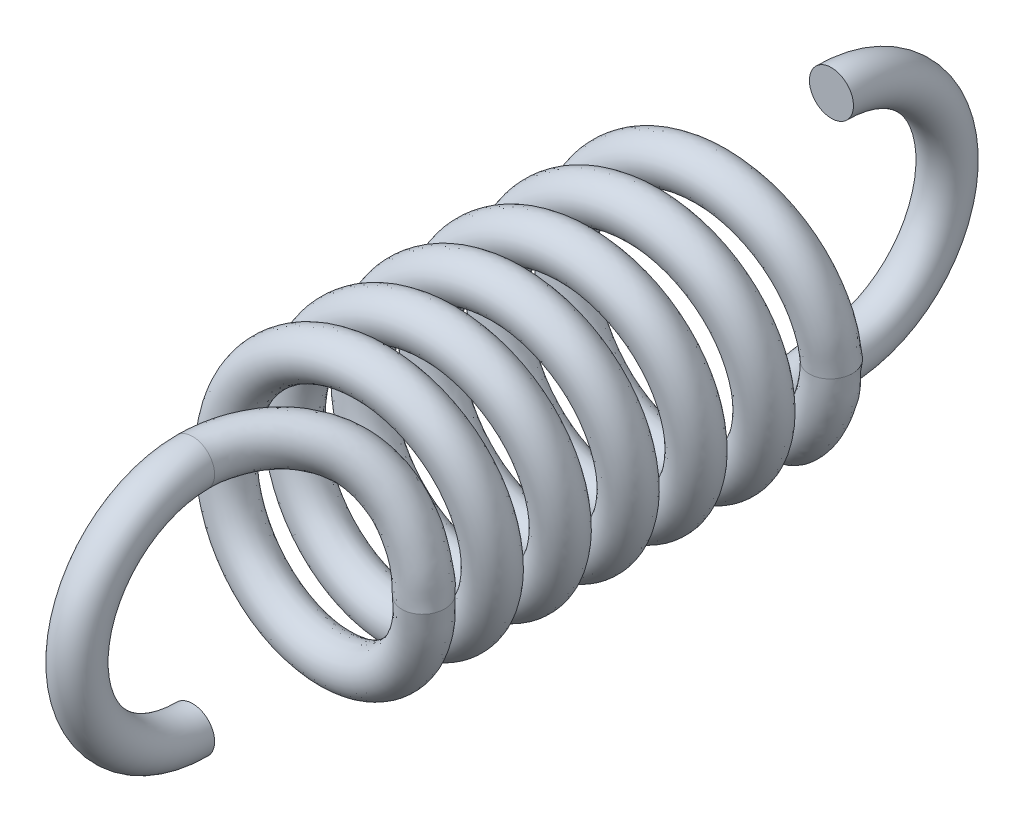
ISO-10303-21;
HEADER;
FILE_DESCRIPTION(('STEP AP214'),'2;1');
FILE_NAME('part.step','',(''),(''),'','','');
FILE_SCHEMA(('AUTOMOTIVE_DESIGN { 1 0 10303 214 1 1 1 1 }'));
ENDSEC;
DATA;
#1=APPLICATION_CONTEXT('core data for automotive mechanical design processes');
#2=APPLICATION_PROTOCOL_DEFINITION('international standard','automotive_design',2000,#1);
#3=PRODUCT_CONTEXT('',#1,'mechanical');
#4=PRODUCT('Part','Part','',(#3));
#5=PRODUCT_RELATED_PRODUCT_CATEGORY('part','',(#4));
#6=PRODUCT_DEFINITION_FORMATION('','',#4);
#7=PRODUCT_DEFINITION_CONTEXT('part definition',#1,'design');
#8=PRODUCT_DEFINITION('design','',#6,#7);
#9=PRODUCT_DEFINITION_SHAPE('','',#8);
#10=(LENGTH_UNIT() NAMED_UNIT(*) SI_UNIT(.MILLI.,.METRE.));
#11=(NAMED_UNIT(*) PLANE_ANGLE_UNIT() SI_UNIT($,.RADIAN.));
#12=(NAMED_UNIT(*) SI_UNIT($,.STERADIAN.) SOLID_ANGLE_UNIT());
#13=UNCERTAINTY_MEASURE_WITH_UNIT(LENGTH_MEASURE(1.E-05),#10,'distance_accuracy_value','');
#14=(GEOMETRIC_REPRESENTATION_CONTEXT(3) GLOBAL_UNCERTAINTY_ASSIGNED_CONTEXT((#13)) GLOBAL_UNIT_ASSIGNED_CONTEXT((#10,
#11,#12)) REPRESENTATION_CONTEXT('',''));
#15=CARTESIAN_POINT('',(0.,0.,0.));
#16=DIRECTION('',(0.,0.,1.));
#17=DIRECTION('',(1.,0.,0.));
#18=AXIS2_PLACEMENT_3D('',#15,#16,#17);
#19=CARTESIAN_POINT('',(0.,0.,-2.1));
#20=DIRECTION('',(1.,0.,0.));
#21=DIRECTION('',(0.,0.,-1.));
#22=AXIS2_PLACEMENT_3D('',#19,#20,#21);
#23=TOROIDAL_SURFACE('',#22,2.10000000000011,0.4);
#24=CARTESIAN_POINT('',(0.,-2.10000000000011,-2.1));
#25=DIRECTION('',(0.,0.,1.));
#26=DIRECTION('',(0.97166925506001,-0.236344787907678,0.));
#27=AXIS2_PLACEMENT_3D('',#24,#25,#26);
#28=CIRCLE('',#27,0.4);
#29=CARTESIAN_POINT('',(0.,-2.50000000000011,-2.1));
#30=VERTEX_POINT('',#29);
#31=EDGE_CURVE('E1325',#30,#30,#28,.T.);
#32=CARTESIAN_POINT('',(0.,2.10000000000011,-2.1));
#33=DIRECTION('',(0.,0.,-1.));
#34=DIRECTION('',(0.97166925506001,0.236344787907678,0.));
#35=AXIS2_PLACEMENT_3D('',#32,#33,#34);
#36=CIRCLE('',#35,0.4);
#37=CARTESIAN_POINT('',(0.,2.50000000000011,-2.1));
#38=VERTEX_POINT('',#37);
#39=EDGE_CURVE('E11',#38,#38,#36,.T.);
#40=CARTESIAN_POINT('',(0.,0.,-2.1));
#41=DIRECTION('',(1.,0.,0.));
#42=DIRECTION('',(0.,0.,-1.));
#43=AXIS2_PLACEMENT_3D('',#40,#41,#42);
#44=CIRCLE('',#43,2.50000000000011);
#45=EDGE_CURVE('',#30,#38,#44,.T.);
#46=ORIENTED_EDGE('',*,*,#31,.F.);
#47=ORIENTED_EDGE('',*,*,#39,.T.);
#48=ORIENTED_EDGE('',*,*,#45,.T.);
#49=ORIENTED_EDGE('',*,*,#45,.F.);
#50=EDGE_LOOP('',(#46,#48,#47,#49));
#51=FACE_BOUND('',#50,.T.);
#52=ADVANCED_FACE('F1296',(#51),#23,.T.);
#53=CARTESIAN_POINT('',(0.,0.,9.5));
#54=DIRECTION('',(1.,0.,0.));
#55=DIRECTION('',(0.,0.,-1.));
#56=AXIS2_PLACEMENT_3D('',#53,#54,#55);
#57=TOROIDAL_SURFACE('',#56,2.1,0.4);
#58=CARTESIAN_POINT('',(0.,2.1,9.5));
#59=DIRECTION('',(0.,0.,-1.));
#60=DIRECTION('',(1.,0.,0.));
#61=AXIS2_PLACEMENT_3D('',#58,#59,#60);
#62=CIRCLE('',#61,0.4);
#63=CARTESIAN_POINT('',(0.,2.5,9.5));
#64=VERTEX_POINT('',#63);
#65=EDGE_CURVE('E1302',#64,#64,#62,.T.);
#66=CARTESIAN_POINT('',(0.,-2.1,9.5));
#67=DIRECTION('',(0.,0.,1.));
#68=DIRECTION('',(1.,0.,0.));
#69=AXIS2_PLACEMENT_3D('',#66,#67,#68);
#70=CIRCLE('',#69,0.4);
#71=CARTESIAN_POINT('',(0.,-2.5,9.5));
#72=VERTEX_POINT('',#71);
#73=EDGE_CURVE('E1306',#72,#72,#70,.T.);
#74=CARTESIAN_POINT('',(0.,0.,9.5));
#75=DIRECTION('',(1.,0.,0.));
#76=DIRECTION('',(0.,0.,-1.));
#77=AXIS2_PLACEMENT_3D('',#74,#75,#76);
#78=CIRCLE('',#77,2.5);
#79=EDGE_CURVE('',#64,#72,#78,.T.);
#80=ORIENTED_EDGE('',*,*,#65,.F.);
#81=ORIENTED_EDGE('',*,*,#73,.T.);
#82=ORIENTED_EDGE('',*,*,#79,.T.);
#83=ORIENTED_EDGE('',*,*,#79,.F.);
#84=EDGE_LOOP('',(#80,#82,#81,#83));
#85=FACE_BOUND('',#84,.T.);
#86=ADVANCED_FACE('F1335',(#85),#57,.T.);
#87=CARTESIAN_POINT('',(0.,-2.1,9.5));
#88=DIRECTION('',(0.,0.,1.));
#89=DIRECTION('',(1.,0.,0.));
#90=AXIS2_PLACEMENT_3D('',#87,#88,#89);
#91=PLANE('',#90);
#92=ORIENTED_EDGE('',*,*,#73,.F.);
#93=EDGE_LOOP('',(#92));
#94=FACE_BOUND('',#93,.T.);
#95=ADVANCED_FACE('F1339',(#94),#91,.F.);
#96=CARTESIAN_POINT('',(0.4,2.1,9.5));
#97=CARTESIAN_POINT('',(0.411164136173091,2.10020929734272,9.37575099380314));
#98=CARTESIAN_POINT('',(0.410571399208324,2.04113152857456,9.2079514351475));
#99=CARTESIAN_POINT('',(0.489482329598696,2.00102941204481,8.89609853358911));
#100=CARTESIAN_POINT('',(0.598208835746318,1.91653370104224,8.61965015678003));
#101=CARTESIAN_POINT('',(0.717782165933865,1.80336542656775,8.36904012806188));
#102=CARTESIAN_POINT('',(0.880609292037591,1.67718095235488,8.13540252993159));
#103=CARTESIAN_POINT('',(1.0148063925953,1.52215097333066,7.9357133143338));
#104=CARTESIAN_POINT('',(1.203345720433,1.34389697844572,7.78695131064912));
#105=CARTESIAN_POINT('',(1.36210362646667,1.10872136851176,7.66034350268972));
#106=CARTESIAN_POINT('',(1.46872246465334,0.885158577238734,7.50612822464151));
#107=CARTESIAN_POINT('',(1.60615769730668,0.596930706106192,7.45816176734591));
#108=CARTESIAN_POINT('',(1.68341958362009,0.294211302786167,7.40746964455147));
#109=CARTESIAN_POINT('',(1.69167192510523,0.126363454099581,7.35215185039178));
#110=CARTESIAN_POINT('',(1.70284837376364,0.00222215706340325,7.35234933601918));
#111=CARTESIAN_POINT('',(0.4,1.3,9.5));
#112=CARTESIAN_POINT('',(0.42081718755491,1.35163866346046,9.30515156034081));
#113=CARTESIAN_POINT('',(0.286687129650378,1.22215920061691,9.22693955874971));
#114=CARTESIAN_POINT('',(0.297938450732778,1.23074472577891,8.84549820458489));
#115=CARTESIAN_POINT('',(0.277315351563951,1.18166395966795,8.51125619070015));
#116=CARTESIAN_POINT('',(0.270738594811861,1.17177769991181,8.14224723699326));
#117=CARTESIAN_POINT('',(0.363264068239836,1.15389325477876,7.79953930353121));
#118=CARTESIAN_POINT('',(0.488546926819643,1.15851423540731,7.44304269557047));
#119=CARTESIAN_POINT('',(0.717280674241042,1.06852061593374,7.21119651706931));
#120=CARTESIAN_POINT('',(0.951790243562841,0.951140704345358,6.97424984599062));
#121=CARTESIAN_POINT('',(1.27297004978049,0.869969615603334,6.7237199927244));
#122=CARTESIAN_POINT('',(1.48205425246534,0.613051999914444,6.66192131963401));
#123=CARTESIAN_POINT('',(1.66001502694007,0.298809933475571,6.62556639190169));
#124=CARTESIAN_POINT('',(1.78342231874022,0.236836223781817,6.50740490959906));
#125=CARTESIAN_POINT('',(1.79814970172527,0.0392639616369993,6.55804608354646));
#126=CARTESIAN_POINT('',(-0.4,1.3,9.5));
#127=CARTESIAN_POINT('',(-0.37918281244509,1.35163866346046,9.30515156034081));
#128=CARTESIAN_POINT('',(-0.500059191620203,1.3425302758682,9.06236140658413));
#129=CARTESIAN_POINT('',(-0.432008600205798,1.4263372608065,8.57247140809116));
#130=CARTESIAN_POINT('',(-0.348053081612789,1.5147036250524,8.11187605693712));
#131=CARTESIAN_POINT('',(-0.165834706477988,1.65425805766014,7.65708766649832));
#132=CARTESIAN_POINT('',(0.138532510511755,1.72119719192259,7.26012383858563));
#133=CARTESIAN_POINT('',(0.544475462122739,1.78185421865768,6.92086368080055));
#134=CARTESIAN_POINT('',(1.00219615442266,1.62931568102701,6.70268873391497));
#135=CARTESIAN_POINT('',(1.44610959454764,1.45550731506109,6.56159633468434));
#136=CARTESIAN_POINT('',(1.94856441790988,1.28758612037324,6.54754281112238));
#137=CARTESIAN_POINT('',(2.2289251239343,0.880444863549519,6.54727092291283));
#138=CARTESIAN_POINT('',(2.45703486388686,0.461101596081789,6.60828224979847));
#139=CARTESIAN_POINT('',(2.57772557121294,0.232391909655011,6.60270623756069));
#140=CARTESIAN_POINT('',(2.59245295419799,0.0348196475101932,6.65334741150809));
#141=CARTESIAN_POINT('',(-0.4,2.1,9.5));
#142=CARTESIAN_POINT('',(-0.384009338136,2.12592398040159,9.34045127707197));
#143=CARTESIAN_POINT('',(-0.378404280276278,2.14962502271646,9.05967815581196));
#144=CARTESIAN_POINT('',(-0.239850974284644,2.19989201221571,8.61858285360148));
#145=CARTESIAN_POINT('',(-0.0273329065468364,2.24864941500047,8.22153804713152));
#146=CARTESIAN_POINT('',(0.281255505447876,2.28609659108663,7.88353752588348));
#147=CARTESIAN_POINT('',(0.655865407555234,2.2444106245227,7.59608432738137));
#148=CARTESIAN_POINT('',(1.07073692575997,2.14553341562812,7.4134933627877));
#149=CARTESIAN_POINT('',(1.48826470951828,1.90459660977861,7.27851229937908));
#150=CARTESIAN_POINT('',(1.856405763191,1.61345056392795,7.24743998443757));
#151=CARTESIAN_POINT('',(2.14438252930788,1.30141492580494,7.33088563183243));
#152=CARTESIAN_POINT('',(2.35281164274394,0.868809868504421,7.34042943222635));
#153=CARTESIAN_POINT('',(2.4812600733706,0.43953229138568,7.40184358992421));
#154=CARTESIAN_POINT('',(2.48419971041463,0.158634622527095,7.42223133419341));
#155=CARTESIAN_POINT('',(2.49715162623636,-0.00222215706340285,7.44765066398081));
#156=CARTESIAN_POINT('',(-0.4,2.9,9.5));
#157=CARTESIAN_POINT('',(-0.388835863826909,2.90020929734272,9.37575099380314));
#158=CARTESIAN_POINT('',(-0.256749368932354,2.95671976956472,9.05699490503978));
#159=CARTESIAN_POINT('',(-0.0476933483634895,2.97344676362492,8.6646942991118));
#160=CARTESIAN_POINT('',(0.293387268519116,2.98259520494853,8.33120003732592));
#161=CARTESIAN_POINT('',(0.728345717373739,2.91793512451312,8.10998738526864));
#162=CARTESIAN_POINT('',(1.17319830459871,2.7676240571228,7.93204481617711));
#163=CARTESIAN_POINT('',(1.5969983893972,2.50921261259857,7.90612304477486));
#164=CARTESIAN_POINT('',(1.97433326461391,2.17987753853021,7.85433586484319));
#165=CARTESIAN_POINT('',(2.26670193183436,1.77139381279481,7.9332836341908));
#166=CARTESIAN_POINT('',(2.34020064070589,1.31524373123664,8.11422845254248));
#167=CARTESIAN_POINT('',(2.47669816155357,0.857174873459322,8.13358794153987));
#168=CARTESIAN_POINT('',(2.50548528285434,0.417962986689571,8.19540493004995));
#169=CARTESIAN_POINT('',(2.39067384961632,0.0848773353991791,8.24175643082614));
#170=CARTESIAN_POINT('',(2.40185029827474,-0.039263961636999,8.24195391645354));
#171=CARTESIAN_POINT('',(0.4,2.9,9.5));
#172=CARTESIAN_POINT('',(0.401511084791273,2.84877993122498,9.44635042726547));
#173=CARTESIAN_POINT('',(0.534455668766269,2.86010385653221,9.18896331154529));
#174=CARTESIAN_POINT('',(0.681026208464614,2.77131409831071,8.94669886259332));
#175=CARTESIAN_POINT('',(0.919102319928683,2.65140344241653,8.72804412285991));
#176=CARTESIAN_POINT('',(1.16482573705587,2.43495315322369,8.59583301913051));
#177=CARTESIAN_POINT('',(1.39795451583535,2.20046864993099,8.47126575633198));
#178=CARTESIAN_POINT('',(1.54106585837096,1.88578771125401,8.42838393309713));
#179=CARTESIAN_POINT('',(1.68941076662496,1.6192733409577,8.36270610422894));
#180=CARTESIAN_POINT('',(1.7724170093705,1.26630203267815,8.34643715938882));
#181=CARTESIAN_POINT('',(1.66447487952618,0.900347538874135,8.28853645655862));
#182=CARTESIAN_POINT('',(1.73026114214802,0.58080941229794,8.25440221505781));
#183=CARTESIAN_POINT('',(1.70682414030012,0.289612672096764,8.18937289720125));
#184=CARTESIAN_POINT('',(1.59992153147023,0.015890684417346,8.19689879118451));
#185=CARTESIAN_POINT('',(1.60754704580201,-0.0348196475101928,8.14665258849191));
#186=CARTESIAN_POINT('',(0.4,2.1,9.5));
#187=CARTESIAN_POINT('',(0.411164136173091,2.10020929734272,9.37575099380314));
#188=CARTESIAN_POINT('',(0.410571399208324,2.04113152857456,9.2079514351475));
#189=CARTESIAN_POINT('',(0.489482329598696,2.00102941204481,8.89609853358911));
#190=CARTESIAN_POINT('',(0.598208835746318,1.91653370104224,8.61965015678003));
#191=CARTESIAN_POINT('',(0.717782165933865,1.80336542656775,8.36904012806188));
#192=CARTESIAN_POINT('',(0.880609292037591,1.67718095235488,8.13540252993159));
#193=CARTESIAN_POINT('',(1.0148063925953,1.52215097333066,7.9357133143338));
#194=CARTESIAN_POINT('',(1.203345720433,1.34389697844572,7.78695131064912));
#195=CARTESIAN_POINT('',(1.36210362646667,1.10872136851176,7.66034350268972));
#196=CARTESIAN_POINT('',(1.46872246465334,0.885158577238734,7.50612822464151));
#197=CARTESIAN_POINT('',(1.60615769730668,0.596930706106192,7.45816176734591));
#198=CARTESIAN_POINT('',(1.68341958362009,0.294211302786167,7.40746964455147));
#199=CARTESIAN_POINT('',(1.69167192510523,0.126363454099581,7.35215185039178));
#200=CARTESIAN_POINT('',(1.70284837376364,0.00222215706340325,7.35234933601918));
#201=(BOUNDED_SURFACE() B_SPLINE_SURFACE(3,3,((#96,#97,#98,#99,#100,#101,#102,#103,#104,#105,
#106,#107,#108,#109,#110),(#111,#112,#113,#114,#115,#116,#117,#118,#119,#120,#121,#122,#123,
#124,#125),(#126,#127,#128,#129,#130,#131,#132,#133,#134,#135,#136,#137,#138,#139,#140),(#141,
#142,#143,#144,#145,#146,#147,#148,#149,#150,#151,#152,#153,#154,#155),(#156,#157,#158,#159,
#160,#161,#162,#163,#164,#165,#166,#167,#168,#169,#170),(#171,#172,#173,#174,#175,#176,#177,
#178,#179,#180,#181,#182,#183,#184,#185),(#186,#187,#188,#189,#190,#191,#192,#193,#194,#195,
#196,#197,#198,#199,#200)),.UNSPECIFIED.,.T.,.F.,.F.) B_SPLINE_SURFACE_WITH_KNOTS((4,3,4),(4,1,
1,1,1,1,1,1,1,1,1,1,4),(0.,0.5,1.),(0.,0.0809011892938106,0.161520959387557,0.244323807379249,
0.330245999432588,0.41547077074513,0.501673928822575,0.583724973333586,0.668869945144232,
0.758399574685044,0.838432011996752,0.919059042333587,1.),
.UNSPECIFIED.) GEOMETRIC_REPRESENTATION_ITEM() RATIONAL_B_SPLINE_SURFACE(((1.,1.,1.,1.,1.,1.,1.,
1.,1.,1.,1.,1.,1.,1.,1.),(0.333333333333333,0.333333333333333,0.333333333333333,
0.333333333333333,0.333333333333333,0.333333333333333,0.333333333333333,0.333333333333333,
0.333333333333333,0.333333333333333,0.333333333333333,0.333333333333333,0.333333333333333,
0.333333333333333,0.333333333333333),(0.333333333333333,0.333333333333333,0.333333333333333,
0.333333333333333,0.333333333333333,0.333333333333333,0.333333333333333,0.333333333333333,
0.333333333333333,0.333333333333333,0.333333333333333,0.333333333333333,0.333333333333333,
0.333333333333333,0.333333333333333),(1.,1.,1.,1.,1.,1.,1.,1.,1.,1.,1.,1.,1.,1.,1.),
(0.333333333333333,0.333333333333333,0.333333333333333,0.333333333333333,0.333333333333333,
0.333333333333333,0.333333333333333,0.333333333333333,0.333333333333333,0.333333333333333,
0.333333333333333,0.333333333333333,0.333333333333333,0.333333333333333,0.333333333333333),
(0.333333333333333,0.333333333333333,0.333333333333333,0.333333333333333,0.333333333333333,
0.333333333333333,0.333333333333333,0.333333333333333,0.333333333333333,0.333333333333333,
0.333333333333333,0.333333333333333,0.333333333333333,0.333333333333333,0.333333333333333),(1.,
1.,1.,1.,1.,1.,1.,1.,1.,1.,1.,1.,1.,1.,1.))) REPRESENTATION_ITEM('') SURFACE());
#202=CARTESIAN_POINT('',(1.70284837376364,0.00222215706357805,7.3523493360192));
#203=CARTESIAN_POINT('',(1.60754704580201,-0.0348196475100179,8.14665258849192));
#204=CARTESIAN_POINT('',(2.40185029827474,-0.039263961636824,8.24195391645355));
#205=CARTESIAN_POINT('',(2.49715162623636,-0.00222215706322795,7.44765066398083));
#206=CARTESIAN_POINT('',(2.59245295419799,0.0348196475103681,6.6533474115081));
#207=CARTESIAN_POINT('',(1.79814970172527,0.0392639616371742,6.55804608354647));
#208=CARTESIAN_POINT('',(1.70284837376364,0.00222215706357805,7.3523493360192));
#209=(BOUNDED_CURVE() B_SPLINE_CURVE(3,(#202,#203,#204,#205,#206,#207,#208),.UNSPECIFIED.,.T.,
.F.) B_SPLINE_CURVE_WITH_KNOTS((4,3,4),(0.,0.5,1.),
.UNSPECIFIED.) CURVE() GEOMETRIC_REPRESENTATION_ITEM() RATIONAL_B_SPLINE_CURVE((1.,
0.333333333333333,0.333333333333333,1.,0.333333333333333,0.333333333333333,1.)) REPRESENTATION_ITEM(''));
#210=CARTESIAN_POINT('',(1.70284837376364,0.00222215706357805,7.3523493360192));
#211=VERTEX_POINT('',#210);
#212=EDGE_CURVE('E1317',#211,#211,#209,.T.);
#213=ORIENTED_EDGE('',*,*,#65,.T.);
#214=EDGE_LOOP('',(#213));
#215=FACE_BOUND('',#214,.T.);
#216=ORIENTED_EDGE('',*,*,#212,.T.);
#217=EDGE_LOOP('',(#216));
#218=FACE_BOUND('',#217,.T.);
#219=ADVANCED_FACE('F1344',(#215,#218),#201,.T.);
#220=CARTESIAN_POINT('',(1.70284837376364,0.00222215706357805,7.3523493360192));
#221=CARTESIAN_POINT('',(1.68935389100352,-0.134061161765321,7.33952800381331));
#222=CARTESIAN_POINT('',(1.68725950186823,-0.31995550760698,7.3138181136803));
#223=CARTESIAN_POINT('',(1.58258719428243,-0.657218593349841,7.27537191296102));
#224=CARTESIAN_POINT('',(1.42660273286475,-0.949350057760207,7.23682460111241));
#225=CARTESIAN_POINT('',(1.21348258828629,-1.21049499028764,7.19816196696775));
#226=CARTESIAN_POINT('',(0.953826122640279,-1.42344070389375,7.15965468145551));
#227=CARTESIAN_POINT('',(0.657912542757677,-1.58266695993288,7.12117892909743));
#228=CARTESIAN_POINT('',(0.336507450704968,-1.68020135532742,7.08261255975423));
#229=CARTESIAN_POINT('',(0.00224819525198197,-1.71395184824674,7.04404307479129));
#230=CARTESIAN_POINT('',(-0.332112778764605,-1.68105762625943,7.00551342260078));
#231=CARTESIAN_POINT('',(-0.653840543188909,-1.58433736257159,6.96698191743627));
#232=CARTESIAN_POINT('',(-0.950142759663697,-1.42600878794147,6.92843536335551));
#233=CARTESIAN_POINT('',(-1.21036613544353,-1.21352669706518,6.88989050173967));
#234=CARTESIAN_POINT('',(-1.42352750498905,-0.953854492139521,6.8513504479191));
#235=CARTESIAN_POINT('',(-1.58262929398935,-0.657964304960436,6.8128098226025));
#236=CARTESIAN_POINT('',(-1.68019227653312,-0.336486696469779,6.77426755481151));
#237=CARTESIAN_POINT('',(-1.71395093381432,-0.00223400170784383,6.73572569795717));
#238=CARTESIAN_POINT('',(-1.6810631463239,0.332108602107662,6.69718411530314));
#239=CARTESIAN_POINT('',(-1.58433908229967,0.653836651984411,6.65864258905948));
#240=CARTESIAN_POINT('',(-1.4260073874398,0.950143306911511,6.62010081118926));
#241=CARTESIAN_POINT('',(-1.2135260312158,1.21036659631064,6.58155920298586));
#242=CARTESIAN_POINT('',(-0.953854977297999,1.42352733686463,6.54301747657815));
#243=CARTESIAN_POINT('',(-0.657964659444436,1.58262921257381,6.50447588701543));
#244=CARTESIAN_POINT('',(-0.336486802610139,1.68019225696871,6.46593414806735));
#245=CARTESIAN_POINT('',(-0.00223414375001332,1.71395091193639,6.4273925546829));
#246=CARTESIAN_POINT('',(0.332108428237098,1.6810631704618,6.38885081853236));
#247=CARTESIAN_POINT('',(0.653836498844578,1.58433915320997,6.35030922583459));
#248=CARTESIAN_POINT('',(0.950143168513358,1.42600748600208,6.31176748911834));
#249=CARTESIAN_POINT('',(1.21036647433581,1.21352615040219,6.27322589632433));
#250=CARTESIAN_POINT('',(1.42352724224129,0.953855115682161,6.23468415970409));
#251=CARTESIAN_POINT('',(1.58262914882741,0.657964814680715,6.19614256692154));
#252=CARTESIAN_POINT('',(1.6801922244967,0.336486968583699,6.15760083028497));
#253=CARTESIAN_POINT('',(1.71395091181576,0.002234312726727,6.11905923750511));
#254=CARTESIAN_POINT('',(1.68106320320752,-0.332108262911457,6.08051750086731));
#255=CARTESIAN_POINT('',(1.58433921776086,-0.653836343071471,6.04197590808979));
#256=CARTESIAN_POINT('',(1.42600757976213,-0.950143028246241,6.00343417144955));
#257=CARTESIAN_POINT('',(1.21352626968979,-1.21036635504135,5.9648925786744));
#258=CARTESIAN_POINT('',(0.95385525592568,-1.42352714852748,5.92635084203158));
#259=CARTESIAN_POINT('',(0.657964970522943,-1.5826290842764,5.88780924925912));
#260=CARTESIAN_POINT('',(0.336487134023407,-1.68019219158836,5.84926751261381));
#261=CARTESIAN_POINT('',(0.00223448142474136,-1.71395091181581,5.81072591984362));
#262=CARTESIAN_POINT('',(-0.332108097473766,-1.681063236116,5.77218418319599));
#263=CARTESIAN_POINT('',(-0.65383618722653,-1.58433928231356,5.73364259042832));
#264=CARTESIAN_POINT('',(-0.950142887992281,-1.42600767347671,5.69510085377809));
#265=CARTESIAN_POINT('',(-1.21036623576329,-1.2135263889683,5.65655926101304));
#266=CARTESIAN_POINT('',(-1.42352705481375,-0.953855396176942,5.61801752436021));
#267=CARTESIAN_POINT('',(-1.58262901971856,-0.65796512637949,5.57947593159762));
#268=CARTESIAN_POINT('',(-1.68019215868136,-0.336487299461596,5.54093419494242));
#269=CARTESIAN_POINT('',(-1.71395091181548,-0.00223465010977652,5.50239260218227));
#270=CARTESIAN_POINT('',(-1.68106326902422,0.33210793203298,5.46385086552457));
#271=CARTESIAN_POINT('',(-1.58433934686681,0.653836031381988,5.42530927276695));
#272=CARTESIAN_POINT('',(-1.42600776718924,0.950142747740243,5.38676753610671));
#273=CARTESIAN_POINT('',(-1.21352650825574,1.21036611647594,5.34822594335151));
#274=CARTESIAN_POINT('',(-0.953855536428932,1.42352696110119,5.30968420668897));
#275=CARTESIAN_POINT('',(-0.657965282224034,1.58262895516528,5.2711426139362));
#276=CARTESIAN_POINT('',(-0.336487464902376,1.68019212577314,5.23260087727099));
#277=CARTESIAN_POINT('',(-0.00223481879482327,1.71395091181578,5.19405928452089));
#278=CARTESIAN_POINT('',(0.332107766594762,1.68106330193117,5.15551754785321));
#279=CARTESIAN_POINT('',(0.653835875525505,1.58433941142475,5.11697595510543));
#280=CARTESIAN_POINT('',(0.950142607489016,1.42600786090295,5.07843421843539));
#281=CARTESIAN_POINT('',(1.21036599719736,1.21352662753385,5.03989262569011));
#282=CARTESIAN_POINT('',(1.42352686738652,0.953855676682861,5.00135088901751));
#283=CARTESIAN_POINT('',(1.5826288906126,0.657965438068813,4.96280929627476));
#284=CARTESIAN_POINT('',(1.68019209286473,0.336487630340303,4.92426755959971));
#285=CARTESIAN_POINT('',(1.71395091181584,0.00223498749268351,4.88572596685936));
#286=CARTESIAN_POINT('',(1.68106333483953,-0.332107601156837,4.84718423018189));
#287=CARTESIAN_POINT('',(1.58433947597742,-0.653835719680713,4.80864263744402));
#288=CARTESIAN_POINT('',(1.42600795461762,-0.950142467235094,4.77010090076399));
#289=CARTESIAN_POINT('',(1.21352674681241,-1.21036587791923,4.7315593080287));
#290=CARTESIAN_POINT('',(0.953855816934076,-1.42352677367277,4.69301757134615));
#291=CARTESIAN_POINT('',(0.657965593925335,-1.58262882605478,4.65447597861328));
#292=CARTESIAN_POINT('',(0.336487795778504,-1.68019205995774,4.61593424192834));
#293=CARTESIAN_POINT('',(0.00223515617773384,-1.71395091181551,4.57739264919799));
#294=CARTESIAN_POINT('',(-0.33210743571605,-1.68106336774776,4.53885091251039));
#295=CARTESIAN_POINT('',(-0.653835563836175,-1.58433954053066,4.50030931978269));
#296=CARTESIAN_POINT('',(-0.950142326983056,-1.42600804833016,4.46176758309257));
#297=CARTESIAN_POINT('',(-1.21036575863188,-1.21352686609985,4.42322599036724));
#298=CARTESIAN_POINT('',(-1.42352667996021,-0.953855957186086,4.3846842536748));
#299=CARTESIAN_POINT('',(-1.58262876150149,-0.657965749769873,4.34614266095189));
#300=CARTESIAN_POINT('',(-1.68019202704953,-0.336487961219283,4.30760092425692));
#301=CARTESIAN_POINT('',(-1.71395091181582,-0.00223532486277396,4.26905933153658));
#302=CARTESIAN_POINT('',(-1.68106340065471,0.332107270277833,4.23051759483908));
#303=CARTESIAN_POINT('',(-1.5843396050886,0.653835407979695,4.19197600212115));
#304=CARTESIAN_POINT('',(-1.42600814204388,0.950142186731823,4.15343426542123));
#305=CARTESIAN_POINT('',(-1.21352698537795,1.2103656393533,4.11489267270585));
#306=CARTESIAN_POINT('',(-0.953856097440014,1.42352658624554,4.07635093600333));
#307=CARTESIAN_POINT('',(-0.657965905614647,1.5826286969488,4.03780934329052));
#308=CARTESIAN_POINT('',(-0.336488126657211,1.68019199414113,3.99926760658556));
#309=CARTESIAN_POINT('',(-0.00223549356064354,1.71395091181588,3.96072601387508));
#310=CARTESIAN_POINT('',(0.332107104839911,1.68106343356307,3.92218427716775));
#311=CARTESIAN_POINT('',(0.653835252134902,1.58433966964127,3.88364268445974));
#312=CARTESIAN_POINT('',(0.950142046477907,1.42600823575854,3.84510094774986));
#313=CARTESIAN_POINT('',(1.21036552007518,1.21352710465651,3.80655935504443));
#314=CARTESIAN_POINT('',(1.42352649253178,0.953856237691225,3.76801761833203));
#315=CARTESIAN_POINT('',(1.58262863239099,0.657966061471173,3.72947602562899));
#316=CARTESIAN_POINT('',(1.68019196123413,0.336488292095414,3.69093428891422));
#317=CARTESIAN_POINT('',(1.71395091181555,0.00223566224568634,3.65239269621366));
#318=CARTESIAN_POINT('',(1.68106346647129,-0.332106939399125,3.61385095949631));
#319=CARTESIAN_POINT('',(1.58433973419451,-0.653835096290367,3.57530936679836));
#320=CARTESIAN_POINT('',(1.42600832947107,-0.950141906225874,3.53676763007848));
#321=CARTESIAN_POINT('',(1.21352722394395,-1.21036540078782,3.49822603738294));
#322=CARTESIAN_POINT('',(0.953856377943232,-1.42352639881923,3.45968430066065));
#323=CARTESIAN_POINT('',(0.6579662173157,-1.5826285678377,3.42114270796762));
#324=CARTESIAN_POINT('',(0.336488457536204,-1.68019192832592,3.38260097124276));
#325=CARTESIAN_POINT('',(0.00223583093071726,-1.71395091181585,3.34405937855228));
#326=CARTESIAN_POINT('',(-0.332106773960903,-1.68106349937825,3.30551764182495));
#327=CARTESIAN_POINT('',(-0.653834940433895,-1.58433979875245,3.26697604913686));
#328=CARTESIAN_POINT('',(-0.95014176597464,-1.42600842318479,3.22843431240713));
#329=CARTESIAN_POINT('',(-1.21036528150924,-1.21352734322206,3.18989271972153));
#330=CARTESIAN_POINT('',(-1.42352630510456,-0.953856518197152,3.15135098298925));
#331=CARTESIAN_POINT('',(-1.58262850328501,-0.657966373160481,3.11280939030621));
#332=CARTESIAN_POINT('',(-1.68019189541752,-0.336488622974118,3.0742676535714));
#333=CARTESIAN_POINT('',(-1.71395091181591,-0.00223599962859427,3.0357260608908));
#334=CARTESIAN_POINT('',(-1.68106353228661,0.332106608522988,2.9971843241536));
#335=CARTESIAN_POINT('',(-1.58433986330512,0.653834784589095,2.95864273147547));
#336=CARTESIAN_POINT('',(-1.42600851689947,0.950141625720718,2.92010099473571));
#337=CARTESIAN_POINT('',(-1.21352746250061,1.21036516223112,2.88155940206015));
#338=CARTESIAN_POINT('',(-0.953856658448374,1.4235262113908,2.84301766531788));
#339=CARTESIAN_POINT('',(-0.657966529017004,1.5826284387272,2.80447607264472));
#340=CARTESIAN_POINT('',(-0.336488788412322,1.68019186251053,2.76593433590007));
#341=CARTESIAN_POINT('',(-0.00223616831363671,1.71395091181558,2.7273927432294));
#342=CARTESIAN_POINT('',(0.332106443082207,1.68106356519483,2.68885100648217));
#343=CARTESIAN_POINT('',(0.65383462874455,1.58433992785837,2.65030941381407));
#344=CARTESIAN_POINT('',(0.950141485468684,1.42600861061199,2.61176767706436));
#345=CARTESIAN_POINT('',(1.21036504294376,1.21352758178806,2.57322608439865));
#346=CARTESIAN_POINT('',(1.42352611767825,0.953856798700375,2.53468434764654));
#347=CARTESIAN_POINT('',(1.58262837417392,0.657966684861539,2.49614275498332));
#348=CARTESIAN_POINT('',(1.68019182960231,0.336488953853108,2.45760101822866));
#349=CARTESIAN_POINT('',(1.71395091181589,0.00223633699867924,2.41905942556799));
#350=CARTESIAN_POINT('',(1.68106359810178,-0.332106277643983,2.38051768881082));
#351=CARTESIAN_POINT('',(1.58433999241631,-0.653834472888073,2.34197609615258));
#352=CARTESIAN_POINT('',(1.42600870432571,-0.950141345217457,2.303434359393));
#353=CARTESIAN_POINT('',(1.21352770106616,-1.21036492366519,2.26489276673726));
#354=CARTESIAN_POINT('',(0.9538569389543,-1.42352602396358,2.22635102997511));
#355=CARTESIAN_POINT('',(0.657966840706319,-1.58262830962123,2.18780943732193));
#356=CARTESIAN_POINT('',(0.336489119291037,-1.68019179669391,2.14926770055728));
#357=CARTESIAN_POINT('',(0.00223650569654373,-1.71395091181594,2.11072610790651));
#358=CARTESIAN_POINT('',(-0.332106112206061,-1.68106363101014,2.07218437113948));
#359=CARTESIAN_POINT('',(-0.653834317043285,-1.58434005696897,2.03364277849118));
#360=CARTESIAN_POINT('',(-0.950141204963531,-1.42600879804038,1.99510104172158));
#361=CARTESIAN_POINT('',(-1.21036480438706,-1.21352782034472,1.95655944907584));
#362=CARTESIAN_POINT('',(-1.42352593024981,-0.953857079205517,1.91801771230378));
#363=CARTESIAN_POINT('',(-1.58262824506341,-0.657966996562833,1.87947611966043));
#364=CARTESIAN_POINT('',(-1.68019176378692,-0.336489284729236,1.84093438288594));
#365=CARTESIAN_POINT('',(-1.71395091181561,-0.00223667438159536,1.80239279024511));
#366=CARTESIAN_POINT('',(-1.68106366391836,0.332105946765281,1.76385105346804));
#367=CARTESIAN_POINT('',(-1.58434012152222,0.653834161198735,1.72530946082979));
#368=CARTESIAN_POINT('',(-1.42600889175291,0.950141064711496,1.68676772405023));
#369=CARTESIAN_POINT('',(-1.21352793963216,1.21036468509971,1.64822613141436));
#370=CARTESIAN_POINT('',(-0.953857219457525,1.42352583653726,1.60968439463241));
#371=CARTESIAN_POINT('',(-0.657967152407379,1.58262818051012,1.57114280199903));
#372=CARTESIAN_POINT('',(-0.336489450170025,1.68019173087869,1.53260106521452));
#373=CARTESIAN_POINT('',(-0.00223684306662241,1.71395091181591,1.49405947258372));
#374=CARTESIAN_POINT('',(0.332105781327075,1.68106369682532,1.4555177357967));
#375=CARTESIAN_POINT('',(0.65383400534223,1.58434018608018,1.41697614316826));
#376=CARTESIAN_POINT('',(0.950140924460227,1.4260089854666,1.37843440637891));
#377=CARTESIAN_POINT('',(1.21036456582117,1.21352805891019,1.33989281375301));
#378=CARTESIAN_POINT('',(1.4235257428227,0.953857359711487,1.30135107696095));
#379=CARTESIAN_POINT('',(1.58262811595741,0.657967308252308,1.26280948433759));
#380=CARTESIAN_POINT('',(1.68019169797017,0.336489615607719,1.22426774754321));
#381=CARTESIAN_POINT('',(1.71395091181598,0.00223701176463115,1.18572615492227));
#382=CARTESIAN_POINT('',(1.68106372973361,-0.332105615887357,1.14718441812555));
#383=CARTESIAN_POINT('',(1.58434025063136,-0.653833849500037,1.10864282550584));
#384=CARTESIAN_POINT('',(1.4260090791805,-0.950140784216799,1.07010108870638));
#385=CARTESIAN_POINT('',(1.21352817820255,-1.21036444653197,1.03155949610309));
#386=CARTESIAN_POINT('',(0.953857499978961,-1.42352564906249,0.993017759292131));
#387=CARTESIAN_POINT('',(0.657967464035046,-1.5826280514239,0.954476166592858));
#388=CARTESIAN_POINT('',(0.33648978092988,-1.6801916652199,0.915934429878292));
#389=CARTESIAN_POINT('',(0.00223718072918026,-1.71395091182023,0.877392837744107));
#390=CARTESIAN_POINT('',(-0.332105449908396,-1.68106376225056,0.838851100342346));
#391=CARTESIAN_POINT('',(-0.653833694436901,-1.58434031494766,0.800309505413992));
#392=CARTESIAN_POINT('',(-0.950140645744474,-1.4260091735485,0.761767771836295));
#393=CARTESIAN_POINT('',(-1.21036432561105,-1.21352829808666,0.723226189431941));
#394=CARTESIAN_POINT('',(-1.42352555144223,-0.953857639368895,0.684684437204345));
#395=CARTESIAN_POINT('',(-1.58262799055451,-0.6579676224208,0.646142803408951));
#396=CARTESIAN_POINT('',(-1.68019163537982,-0.336489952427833,0.607601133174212));
#397=CARTESIAN_POINT('',(-1.71395089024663,-0.00223731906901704,0.56905969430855));
#398=CARTESIAN_POINT('',(-1.68106380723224,0.332105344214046,0.530517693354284));
#399=CARTESIAN_POINT('',(-1.58434054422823,0.653833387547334,0.491975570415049));
#400=CARTESIAN_POINT('',(-1.42600925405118,0.95014012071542,0.453434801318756));
#401=CARTESIAN_POINT('',(-1.2135274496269,1.21036465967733,0.414894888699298));
#402=CARTESIAN_POINT('',(-0.953857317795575,1.42352720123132,0.376349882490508));
#403=CARTESIAN_POINT('',(-0.657972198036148,1.58262763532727,0.337803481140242));
#404=CARTESIAN_POINT('',(-0.336493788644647,1.68018509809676,0.299271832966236));
#405=CARTESIAN_POINT('',(-0.0022228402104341,1.71394774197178,0.260742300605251));
#406=CARTESIAN_POINT('',(0.332126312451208,1.68107596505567,0.222172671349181));
#407=CARTESIAN_POINT('',(0.653784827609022,1.58438689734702,0.183606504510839));
#408=CARTESIAN_POINT('',(0.950107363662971,1.42591570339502,0.145130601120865));
#409=CARTESIAN_POINT('',(1.21031243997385,1.21364464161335,0.106623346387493));
#410=CARTESIAN_POINT('',(1.42412363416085,0.953073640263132,0.0679606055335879));
#411=CARTESIAN_POINT('',(1.58092628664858,0.661355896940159,0.0294135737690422));
#412=CARTESIAN_POINT('',(1.68623697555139,0.32433311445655,-0.0090328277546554));
#413=CARTESIAN_POINT('',(1.68934350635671,0.138501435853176,-0.034742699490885));
#414=CARTESIAN_POINT('',(1.70283798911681,0.00221811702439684,-0.0475640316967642));
#415=CARTESIAN_POINT('',(1.60754704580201,-0.0348196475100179,8.14665258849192));
#416=CARTESIAN_POINT('',(1.5860061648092,-0.248454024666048,8.13382681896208));
#417=CARTESIAN_POINT('',(1.58850801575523,-0.298781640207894,8.10812022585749));
#418=CARTESIAN_POINT('',(1.47914401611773,-0.665616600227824,8.06969244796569));
#419=CARTESIAN_POINT('',(1.32652275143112,-0.924348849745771,8.03115654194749));
#420=CARTESIAN_POINT('',(1.11923632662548,-1.16973026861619,7.99246092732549));
#421=CARTESIAN_POINT('',(0.869573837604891,-1.36421772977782,7.95396036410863));
#422=CARTESIAN_POINT('',(0.586782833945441,-1.50854088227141,7.91549967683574));
#423=CARTESIAN_POINT('',(0.281272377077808,-1.59349386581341,7.87693049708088));
#424=CARTESIAN_POINT('',(-0.0350505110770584,-1.61809343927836,7.83835180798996));
#425=CARTESIAN_POINT('',(-0.349964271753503,-1.57979090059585,7.79982664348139));
#426=CARTESIAN_POINT('',(-0.651640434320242,-1.48153869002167,7.76129584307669));
#427=CARTESIAN_POINT('',(-0.927888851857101,-1.32562968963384,7.72275017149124));
#428=CARTESIAN_POINT('',(-1.16898033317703,-1.11938460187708,7.68420251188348));
#429=CARTESIAN_POINT('',(-1.36455119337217,-0.869630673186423,7.64566477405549));
#430=CARTESIAN_POINT('',(-1.50837252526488,-0.586827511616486,7.6071224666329));
#431=CARTESIAN_POINT('',(-1.59347520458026,-0.281243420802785,7.5685820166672));
#432=CARTESIAN_POINT('',(-1.61812209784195,0.035070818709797,7.53003815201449));
#433=CARTESIAN_POINT('',(-1.57980608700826,0.349961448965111,7.49149854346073));
#434=CARTESIAN_POINT('',(-1.48152925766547,0.651629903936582,7.45295509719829));
#435=CARTESIAN_POINT('',(-1.32562612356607,0.927887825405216,7.41441524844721));
#436=CARTESIAN_POINT('',(-1.1193865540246,1.16898411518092,7.3758716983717));
#437=CARTESIAN_POINT('',(-0.869631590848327,1.36455168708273,7.33733191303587));
#438=CARTESIAN_POINT('',(-0.586827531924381,1.50837118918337,7.29878838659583));
#439=CARTESIAN_POINT('',(-0.281243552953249,1.59347496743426,7.26024858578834));
#440=CARTESIAN_POINT('',(0.0350706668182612,1.61812243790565,7.22170505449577));
#441=CARTESIAN_POINT('',(0.349961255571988,1.57980616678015,7.18316525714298));
#442=CARTESIAN_POINT('',(0.651629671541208,1.48152925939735,7.14462172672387));
#443=CARTESIAN_POINT('',(0.92788764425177,1.32562623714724,7.10608192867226));
#444=CARTESIAN_POINT('',(1.1689839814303,1.11938671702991,7.06753839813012));
#445=CARTESIAN_POINT('',(1.36455157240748,0.869631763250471,7.02899860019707));
#446=CARTESIAN_POINT('',(1.50837110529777,0.586827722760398,6.99045506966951));
#447=CARTESIAN_POINT('',(1.59347492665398,0.281243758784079,6.95191527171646));
#448=CARTESIAN_POINT('',(1.61812243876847,-0.0350704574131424,6.91337174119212));
#449=CARTESIAN_POINT('',(1.57980620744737,-0.349961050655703,6.87483194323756));
#450=CARTESIAN_POINT('',(1.4815293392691,-0.651629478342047,6.83628841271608));
#451=CARTESIAN_POINT('',(1.32562635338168,-0.927887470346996,6.79774861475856));
#452=CARTESIAN_POINT('',(1.119386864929,-1.16898383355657,6.75920508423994));
#453=CARTESIAN_POINT('',(0.869631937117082,-1.36455145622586,6.72066528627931));
#454=CARTESIAN_POINT('',(0.586827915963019,-1.50837102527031,6.68212175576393));
#455=CARTESIAN_POINT('',(0.28124396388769,-1.59347488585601,6.64358195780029));
#456=CARTESIAN_POINT('',(-0.0350702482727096,-1.6181224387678,6.60503842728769));
#457=CARTESIAN_POINT('',(-0.349960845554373,-1.57980624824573,6.56649862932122));
#458=CARTESIAN_POINT('',(-0.651629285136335,-1.48152941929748,6.52795509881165));
#459=CARTESIAN_POINT('',(-0.927887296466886,-1.32562646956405,6.48941530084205));
#460=CARTESIAN_POINT('',(-1.16898368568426,-1.11938701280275,6.45087177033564));
#461=CARTESIAN_POINT('',(-1.36455134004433,-0.869632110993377,6.41233197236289));
#462=CARTESIAN_POINT('',(-1.50837094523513,-0.58682810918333,6.3737884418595));
#463=CARTESIAN_POINT('',(-1.59347484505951,-0.281244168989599,6.33524864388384));
#464=CARTESIAN_POINT('',(-1.61812243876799,0.0350700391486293,6.2967051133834));
#465=CARTESIAN_POINT('',(-1.57980628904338,0.349960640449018,6.25816531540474));
#466=CARTESIAN_POINT('',(-1.48152949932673,0.651629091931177,6.21962178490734));
#467=CARTESIAN_POINT('',(-1.32562658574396,0.92788712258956,6.18108198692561));
#468=CARTESIAN_POINT('',(-1.11938716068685,1.16898353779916,6.14253845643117));
#469=CARTESIAN_POINT('',(-0.869632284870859,1.36455122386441,6.10399865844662));
#470=CARTESIAN_POINT('',(-0.586828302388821,1.50837086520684,6.06545512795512));
#471=CARTESIAN_POINT('',(-0.281244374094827,1.59347480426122,6.02691532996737));
#472=CARTESIAN_POINT('',(0.0350698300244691,1.61812243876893,5.98837179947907));
#473=CARTESIAN_POINT('',(0.349960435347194,1.57980632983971,5.94983200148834));
#474=CARTESIAN_POINT('',(0.651628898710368,1.48152957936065,5.91128847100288));
#475=CARTESIAN_POINT('',(0.927886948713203,1.32562670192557,5.87274867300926));
#476=CARTESIAN_POINT('',(1.16898338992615,1.11938730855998,5.83420514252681));
#477=CARTESIAN_POINT('',(1.36455110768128,0.8696324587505,5.79566534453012));
#478=CARTESIAN_POINT('',(1.50837078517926,0.586828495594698,5.75712181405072));
#479=CARTESIAN_POINT('',(1.59347476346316,0.281244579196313,5.71858201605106));
#480=CARTESIAN_POINT('',(1.61812243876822,-0.0350696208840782,5.6800384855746));
#481=CARTESIAN_POINT('',(1.5798063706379,-0.3499602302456,5.64149868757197));
#482=CARTESIAN_POINT('',(1.48152965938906,-0.651628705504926,5.60295515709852));
#483=CARTESIAN_POINT('',(1.32562681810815,-0.927886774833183,5.56441535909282));
#484=CARTESIAN_POINT('',(1.11938745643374,-1.16898324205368,5.52587182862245));
#485=CARTESIAN_POINT('',(0.869632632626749,-1.36455099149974,5.48733203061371));
#486=CARTESIAN_POINT('',(0.586828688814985,-1.50837070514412,5.4487885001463));
#487=CARTESIAN_POINT('',(0.281244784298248,-1.59347472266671,5.41024870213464));
#488=CARTESIAN_POINT('',(-0.0350694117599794,-1.61812243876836,5.37170517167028));
#489=CARTESIAN_POINT('',(-0.349960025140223,-1.57980641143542,5.33316537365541));
#490=CARTESIAN_POINT('',(-0.651628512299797,-1.48152973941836,5.29462184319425));
#491=CARTESIAN_POINT('',(-0.927886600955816,-1.32562693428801,5.25608204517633));
#492=CARTESIAN_POINT('',(-1.16898309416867,-1.11938760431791,5.21753851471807));
#493=CARTESIAN_POINT('',(-1.36455087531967,-0.869632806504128,5.17899871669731));
#494=CARTESIAN_POINT('',(-1.5083706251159,-0.586828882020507,5.14045518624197));
#495=CARTESIAN_POINT('',(-1.59347468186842,-0.281244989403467,5.10191538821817));
#496=CARTESIAN_POINT('',(-1.61812243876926,0.0350692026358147,5.06337185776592));
#497=CARTESIAN_POINT('',(-1.57980645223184,0.349959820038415,5.02483205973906));
#498=CARTESIAN_POINT('',(-1.48152981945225,0.651628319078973,4.98628852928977));
#499=CARTESIAN_POINT('',(-1.32562705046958,0.92788642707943,4.94774873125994));
#500=CARTESIAN_POINT('',(-1.11938775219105,1.16898294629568,4.90920520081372));
#501=CARTESIAN_POINT('',(-0.869632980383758,1.3645507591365,4.87066540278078));
#502=CARTESIAN_POINT('',(-0.586829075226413,1.50837054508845,4.83212187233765));
#503=CARTESIAN_POINT('',(-0.281245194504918,1.59347464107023,4.79358207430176));
#504=CARTESIAN_POINT('',(0.0350689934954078,1.61812243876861,4.75503854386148));
#505=CARTESIAN_POINT('',(0.349959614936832,1.57980649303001,4.71649874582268));
#506=CARTESIAN_POINT('',(0.651628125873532,1.48152989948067,4.67795521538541));
#507=CARTESIAN_POINT('',(0.92788625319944,1.3256271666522,4.63941541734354));
#508=CARTESIAN_POINT('',(1.16898279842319,1.11938790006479,4.60087188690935));
#509=CARTESIAN_POINT('',(1.36455064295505,0.86963315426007,4.56233208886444));
#510=CARTESIAN_POINT('',(1.50837046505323,0.586829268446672,4.52378855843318));
#511=CARTESIAN_POINT('',(1.59347460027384,0.281245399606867,4.48524876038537));
#512=CARTESIAN_POINT('',(1.61812243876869,-0.0350687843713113,4.44670522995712));
#513=CARTESIAN_POINT('',(1.57980653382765,-0.349959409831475,4.4081654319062));
#514=CARTESIAN_POINT('',(1.4815299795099,-0.651627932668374,4.36962190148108));
#515=CARTESIAN_POINT('',(1.32562728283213,-0.927886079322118,4.3310821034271));
#516=CARTESIAN_POINT('',(1.11938804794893,-1.16898265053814,4.29253857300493));
#517=CARTESIAN_POINT('',(0.869633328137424,-1.36455052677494,4.25399877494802));
#518=CARTESIAN_POINT('',(0.586829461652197,-1.50837038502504,4.21545524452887));
#519=CARTESIAN_POINT('',(0.281245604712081,-1.59347455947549,4.17691544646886));
#520=CARTESIAN_POINT('',(-0.0350685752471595,-1.61812243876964,4.13837191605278));
#521=CARTESIAN_POINT('',(-0.349959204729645,-1.57980657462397,4.09983211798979));
#522=CARTESIAN_POINT('',(-0.651627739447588,-1.48153005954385,4.06128858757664));
#523=CARTESIAN_POINT('',(-0.927885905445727,-1.32562739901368,4.0227487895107));
#524=CARTESIAN_POINT('',(-1.16898250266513,-1.11938819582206,3.98420525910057));
#525=CARTESIAN_POINT('',(-1.36455041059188,-0.86963350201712,3.94566546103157));
#526=CARTESIAN_POINT('',(-1.50837030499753,-0.586829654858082,3.90712193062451));
#527=CARTESIAN_POINT('',(-1.5934745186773,-0.281245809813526,3.86858213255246));
#528=CARTESIAN_POINT('',(-1.618122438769,0.0350683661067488,3.83003860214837));
#529=CARTESIAN_POINT('',(-1.5798066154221,0.349958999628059,3.79149880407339));
#530=CARTESIAN_POINT('',(-1.48153013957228,0.651627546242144,3.7529552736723));
#531=CARTESIAN_POINT('',(-1.32562751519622,0.927885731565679,3.71441547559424));
#532=CARTESIAN_POINT('',(-1.11938834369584,1.16898235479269,3.67587194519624));
#533=CARTESIAN_POINT('',(-0.869633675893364,1.36455029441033,3.63733214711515));
#534=CARTESIAN_POINT('',(-0.586829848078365,1.50837022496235,3.59878861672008));
#535=CARTESIAN_POINT('',(-0.281246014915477,1.59347447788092,3.56024881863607));
#536=CARTESIAN_POINT('',(0.0350681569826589,1.61812243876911,3.52170528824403));
#537=CARTESIAN_POINT('',(0.349958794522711,1.57980665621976,3.48316549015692));
#538=CARTESIAN_POINT('',(0.651627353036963,1.48153021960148,3.44462195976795));
#539=CARTESIAN_POINT('',(0.927885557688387,1.3256276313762,3.40608216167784));
#540=CARTESIAN_POINT('',(1.16898220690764,1.11938849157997,3.3675386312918));
#541=CARTESIAN_POINT('',(1.36455017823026,0.86963384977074,3.32899883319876));
#542=CARTESIAN_POINT('',(1.50837014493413,0.586830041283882,3.29045530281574));
#543=CARTESIAN_POINT('',(1.59347443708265,0.281246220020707,3.25191550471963));
#544=CARTESIAN_POINT('',(1.61812243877,-0.0350679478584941,3.21337197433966));
#545=CARTESIAN_POINT('',(1.5798066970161,-0.349958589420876,3.17483217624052));
#546=CARTESIAN_POINT('',(1.48153029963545,-0.651627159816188,3.13628864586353));
#547=CARTESIAN_POINT('',(1.32562774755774,-0.927885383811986,3.09774884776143));
#548=CARTESIAN_POINT('',(1.11938863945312,-1.16898205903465,3.05920531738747));
#549=CARTESIAN_POINT('',(0.869634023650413,-1.36455006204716,3.02066551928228));
#550=CARTESIAN_POINT('',(0.586830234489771,-1.50837006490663,2.98212198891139));
#551=CARTESIAN_POINT('',(0.281246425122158,-1.59347439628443,2.94358219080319));
#552=CARTESIAN_POINT('',(-0.0350677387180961,-1.61812243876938,2.90503866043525));
#553=CARTESIAN_POINT('',(-0.349958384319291,-1.57980673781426,2.86649886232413));
#554=CARTESIAN_POINT('',(-0.65162696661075,-1.48153037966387,2.82795533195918));
#555=CARTESIAN_POINT('',(-0.927885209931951,-1.32562786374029,2.78941553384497));
#556=CARTESIAN_POINT('',(-1.16898191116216,-1.11938878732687,2.75087200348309));
#557=CARTESIAN_POINT('',(-1.36454994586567,-0.869634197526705,2.71233220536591));
#558=CARTESIAN_POINT('',(-1.50836998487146,-0.586830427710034,2.67378867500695));
#559=CARTESIAN_POINT('',(-1.59347435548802,-0.281246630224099,2.6352488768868));
#560=CARTESIAN_POINT('',(-1.61812243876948,0.0350675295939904,2.5967053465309));
#561=CARTESIAN_POINT('',(-1.57980677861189,0.34995817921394,2.55816554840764));
#562=CARTESIAN_POINT('',(-1.48153045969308,0.651626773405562,2.51962201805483));
#563=CARTESIAN_POINT('',(-1.32562797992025,0.927885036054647,2.48108221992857));
#564=CARTESIAN_POINT('',(-1.11938893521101,1.16898176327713,2.44253868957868));
#565=CARTESIAN_POINT('',(-0.869634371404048,1.36454982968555,2.40399889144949));
#566=CARTESIAN_POINT('',(-0.586830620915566,1.50836990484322,2.36545536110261));
#567=CARTESIAN_POINT('',(-0.281246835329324,1.59347431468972,2.32691556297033));
#568=CARTESIAN_POINT('',(0.0350673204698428,1.61812243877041,2.28837203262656));
#569=CARTESIAN_POINT('',(0.349957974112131,1.57980681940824,2.24983223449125));
#570=CARTESIAN_POINT('',(0.651626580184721,1.481530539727,2.21128870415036));
#571=CARTESIAN_POINT('',(0.927884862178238,1.32562809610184,2.17274890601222));
#572=CARTESIAN_POINT('',(1.16898161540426,1.11938908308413,2.13420537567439));
#573=CARTESIAN_POINT('',(1.36454971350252,0.869634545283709,2.09566557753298));
#574=CARTESIAN_POINT('',(1.50836982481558,0.586830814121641,2.05712204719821));
#575=CARTESIAN_POINT('',(1.59347427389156,0.28124704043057,2.01858224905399));
#576=CARTESIAN_POINT('',(1.61812243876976,-0.0350671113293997,1.98003871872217));
#577=CARTESIAN_POINT('',(1.57980686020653,-0.349957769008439,1.94149892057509));
#578=CARTESIAN_POINT('',(1.48153061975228,-0.651626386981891,1.90295539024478));
#579=CARTESIAN_POINT('',(1.32562821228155,-0.927884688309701,1.86441559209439));
#580=CARTESIAN_POINT('',(1.11938923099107,-1.16898146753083,1.82587206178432));
#581=CARTESIAN_POINT('',(0.869634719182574,-1.36454959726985,1.78733226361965));
#582=CARTESIAN_POINT('',(0.586831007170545,-1.50836974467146,1.74878873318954));
#583=CARTESIAN_POINT('',(0.281247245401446,-1.59347423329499,1.71024893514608));
#584=CARTESIAN_POINT('',(-0.0350669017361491,-1.61812243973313,1.67170540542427));
#585=CARTESIAN_POINT('',(-0.349957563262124,-1.57980690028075,1.6331656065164));
#586=CARTESIAN_POINT('',(-0.651626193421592,-1.48153069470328,1.59462207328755));
#587=CARTESIAN_POINT('',(-0.92788451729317,-1.32562833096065,1.55608227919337));
#588=CARTESIAN_POINT('',(-1.16898133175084,-1.11938939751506,1.51753876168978));
#589=CARTESIAN_POINT('',(-1.36454946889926,-0.869634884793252,1.47899894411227));
#590=CARTESIAN_POINT('',(-1.50836958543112,-0.586831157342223,1.44045536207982));
#591=CARTESIAN_POINT('',(-1.59347424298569,-0.28124747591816,1.40191564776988));
#592=CARTESIAN_POINT('',(-1.6181227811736,0.0350666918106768,1.36337231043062));
#593=CARTESIAN_POINT('',(-1.57980673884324,0.349957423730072,1.3248321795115));
#594=CARTESIAN_POINT('',(-1.48152971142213,0.651625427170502,1.28628798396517));
#595=CARTESIAN_POINT('',(-1.32562921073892,0.927884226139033,1.24774940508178));
#596=CARTESIAN_POINT('',(-1.11939169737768,1.16898458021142,1.20920797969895));
#597=CARTESIAN_POINT('',(-0.869632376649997,1.36454912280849,1.1706640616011));
#598=CARTESIAN_POINT('',(-0.586830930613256,1.50835762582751,1.13211451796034));
#599=CARTESIAN_POINT('',(-0.28125563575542,1.5934750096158,1.0935874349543));
#600=CARTESIAN_POINT('',(0.0350824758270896,1.61815784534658,1.05505892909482));
#601=CARTESIAN_POINT('',(0.349982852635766,1.5797771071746,1.01648396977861));
#602=CARTESIAN_POINT('',(0.65153135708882,1.48156176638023,0.97791010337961));
#603=CARTESIAN_POINT('',(0.927894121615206,1.32540135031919,0.939453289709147));
#604=CARTESIAN_POINT('',(1.16897064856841,1.12032598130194,0.900950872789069));
#605=CARTESIAN_POINT('',(1.36537457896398,0.865947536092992,0.862258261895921));
#606=CARTESIAN_POINT('',(1.5053055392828,0.600728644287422,0.823716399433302));
#607=CARTESIAN_POINT('',(1.60414202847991,0.230084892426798,0.785293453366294));
#608=CARTESIAN_POINT('',(1.58703228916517,0.178900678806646,0.759585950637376));
#609=CARTESIAN_POINT('',(1.6077099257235,-0.0348246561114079,0.746759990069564));
#610=CARTESIAN_POINT('',(2.40185029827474,-0.039263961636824,8.24195391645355));
#611=CARTESIAN_POINT('',(2.38030941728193,-0.252898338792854,8.22912814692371));
#612=CARTESIAN_POINT('',(2.37143369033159,-0.483683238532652,8.20345343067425));
#613=CARTESIAN_POINT('',(2.21645692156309,-0.968235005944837,8.16482831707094));
#614=CARTESIAN_POINT('',(1.98866912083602,-1.37420571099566,8.12622963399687));
#615=CARTESIAN_POINT('',(1.68105822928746,-1.73794479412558,8.08779439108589));
#616=CARTESIAN_POINT('',(1.31009386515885,-2.03143512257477,8.04924615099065));
#617=CARTESIAN_POINT('',(0.888707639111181,-2.2487698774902,8.01064264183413));
#618=CARTESIAN_POINT('',(0.432814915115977,-2.37846390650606,7.97211762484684));
#619=CARTESIAN_POINT('',(-0.0395525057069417,-2.41751703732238,7.93359931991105));
#620=CARTESIAN_POINT('',(-0.510290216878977,-2.36299402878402,7.89505136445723));
#621=CARTESIAN_POINT('',(-0.961692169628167,-2.21841472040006,7.85649835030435));
#622=CARTESIAN_POINT('',(-1.37574452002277,-1.98785391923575,7.81796234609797));
#623=CARTESIAN_POINT('',(-1.73742560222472,-1.68150858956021,7.7794215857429));
#624=CARTESIAN_POINT('',(-2.03173538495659,-1.31006180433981,7.7408807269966));
#625=CARTESIAN_POINT('',(-2.24866324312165,-0.888629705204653,7.70233606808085));
#626=CARTESIAN_POINT('',(-2.37841904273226,-0.432827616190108,7.66379691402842));
#627=CARTESIAN_POINT('',(-2.41755599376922,0.0395392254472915,7.62525339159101));
#628=CARTESIAN_POINT('',(-2.36300836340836,0.510300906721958,7.58671369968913));
#629=CARTESIAN_POINT('',(-2.21839989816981,0.961688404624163,7.54816987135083));
#630=CARTESIAN_POINT('',(-1.98785138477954,1.3757407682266,7.50963033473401));
#631=CARTESIAN_POINT('',(-1.68151195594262,1.73742903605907,7.47108658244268));
#632=CARTESIAN_POINT('',(-1.3100619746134,2.03173654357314,7.4325470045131));
#633=CARTESIAN_POINT('',(-0.888629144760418,2.2486619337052,7.39400323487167));
#634=CARTESIAN_POINT('',(-0.432827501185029,2.37841882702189,7.3554636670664));
#635=CARTESIAN_POINT('',(0.0395394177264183,2.41755638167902,7.31691990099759));
#636=CARTESIAN_POINT('',(0.51030104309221,2.36300838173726,7.27838033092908));
#637=CARTESIAN_POINT('',(0.961688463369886,2.21839976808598,7.23983656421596));
#638=CARTESIAN_POINT('',(1.37574087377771,1.98785130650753,7.20129699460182));
#639=CARTESIAN_POINT('',(1.73742914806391,1.68151187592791,7.16275322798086));
#640=CARTESIAN_POINT('',(2.0317366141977,1.31006186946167,7.12421365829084));
#641=CARTESIAN_POINT('',(2.24866197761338,0.888629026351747,7.08566989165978));
#642=CARTESIAN_POINT('',(2.37841885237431,0.432827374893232,7.04713032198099));
#643=CARTESIAN_POINT('',(2.41755638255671,-0.0395395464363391,7.00858655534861));
#644=CARTESIAN_POINT('',(2.36300835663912,-0.510301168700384,6.97004698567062));
#645=CARTESIAN_POINT('',(2.21839971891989,-0.961688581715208,6.93150321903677));
#646=CARTESIAN_POINT('',(1.98785123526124,-1.37574098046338,6.89296364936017));
#647=CARTESIAN_POINT('',(1.68151178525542,-1.73742923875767,6.85441988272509));
#648=CARTESIAN_POINT('',(1.31006176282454,-2.03173668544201,6.8158803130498));
#649=CARTESIAN_POINT('',(0.888628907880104,-2.24866202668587,6.77733654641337));
#650=CARTESIAN_POINT('',(0.432827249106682,-2.37841887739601,6.73879697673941));
#651=CARTESIAN_POINT('',(-0.0395396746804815,-2.4175563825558,6.70025321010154));
#652=CARTESIAN_POINT('',(-0.510301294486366,-2.36300833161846,6.66171364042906));
#653=CARTESIAN_POINT('',(-0.961688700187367,-2.21839966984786,6.62316987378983));
#654=CARTESIAN_POINT('',(-1.37574108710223,-1.98785116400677,6.58463030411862));
#655=CARTESIAN_POINT('',(-1.7374293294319,-1.68151169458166,6.54608653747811));
#656=CARTESIAN_POINT('',(-2.03173675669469,-1.31006165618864,6.50754696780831));
#657=CARTESIAN_POINT('',(-2.24866207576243,-0.888628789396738,6.46900320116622));
#658=CARTESIAN_POINT('',(-2.37841890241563,-0.432827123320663,6.43046363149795));
#659=CARTESIAN_POINT('',(-2.41755638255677,0.0395398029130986,6.39191986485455));
#660=CARTESIAN_POINT('',(-2.36300830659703,0.510301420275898,6.35338029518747));
#661=CARTESIAN_POINT('',(-2.21839962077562,0.961688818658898,6.31483652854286));
#662=CARTESIAN_POINT('',(-1.98785109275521,1.37574119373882,6.27629695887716));
#663=CARTESIAN_POINT('',(-1.6815116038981,1.73742942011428,6.23775319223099));
#664=CARTESIAN_POINT('',(-1.31006154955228,2.03173682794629,6.19921362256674));
#665=CARTESIAN_POINT('',(-0.888628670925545,2.24866212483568,6.16066985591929));
#666=CARTESIAN_POINT('',(-0.432826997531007,2.37841892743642,6.12213028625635));
#667=CARTESIAN_POINT('',(0.0395399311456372,2.417556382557,6.08358651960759));
#668=CARTESIAN_POINT('',(0.510301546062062,2.36300828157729,6.04504694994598));
#669=CARTESIAN_POINT('',(0.961688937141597,2.21839957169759,6.00650318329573));
#670=CARTESIAN_POINT('',(1.37574130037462,1.98785102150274,5.96796361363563));
#671=CARTESIAN_POINT('',(1.73742951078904,1.68151151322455,5.92941984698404));
#672=CARTESIAN_POINT('',(2.03173689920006,1.31006144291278,5.89088027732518));
#673=CARTESIAN_POINT('',(2.24866217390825,0.888628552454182,5.85233651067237));
#674=CARTESIAN_POINT('',(2.37841895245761,0.432826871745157,5.81379694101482));
#675=CARTESIAN_POINT('',(2.41755638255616,-0.0395400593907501,5.77525317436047));
#676=CARTESIAN_POINT('',(2.36300825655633,-0.51030167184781,5.73671360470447));
#677=CARTESIAN_POINT('',(2.21839952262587,-0.961689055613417,5.69816983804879));
#678=CARTESIAN_POINT('',(1.98785095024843,-1.37574140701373,5.65963026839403));
#679=CARTESIAN_POINT('',(1.68151142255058,-1.73742960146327,5.62108650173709));
#680=CARTESIAN_POINT('',(1.3100613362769,-2.03173697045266,5.58254693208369));
#681=CARTESIAN_POINT('',(0.88862843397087,-2.24866222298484,5.54400316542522));
#682=CARTESIAN_POINT('',(0.432826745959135,-2.37841897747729,5.50546359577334));
#683=CARTESIAN_POINT('',(-0.0395401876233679,-2.41755638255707,5.46691982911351));
#684=CARTESIAN_POINT('',(-0.510301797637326,-2.36300823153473,5.42838025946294));
#685=CARTESIAN_POINT('',(-0.961689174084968,-2.21839947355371,5.38983649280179));
#686=CARTESIAN_POINT('',(-1.37574151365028,-1.98785087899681,5.35129692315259));
#687=CARTESIAN_POINT('',(-1.73742969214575,-1.6815113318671,5.31275315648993));
#688=CARTESIAN_POINT('',(-2.0317370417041,-1.31006122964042,5.27421358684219));
#689=CARTESIAN_POINT('',(-2.24866227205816,-0.88862831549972,5.23566982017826));
#690=CARTESIAN_POINT('',(-2.37841900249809,-0.432826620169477,5.19713025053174));
#691=CARTESIAN_POINT('',(-2.41755638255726,0.039540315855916,5.15858648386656));
#692=CARTESIAN_POINT('',(-2.3630082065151,0.510301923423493,5.12004691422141));
#693=CARTESIAN_POINT('',(-2.21839942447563,0.961689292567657,5.08150314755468));
#694=CARTESIAN_POINT('',(-1.98785080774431,1.37574162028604,5.04296357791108));
#695=CARTESIAN_POINT('',(-1.68151124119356,1.73742978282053,5.00441981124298));
#696=CARTESIAN_POINT('',(-1.3100611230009,2.03173711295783,4.96588024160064));
#697=CARTESIAN_POINT('',(-0.888628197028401,2.24866232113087,4.92733647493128));
#698=CARTESIAN_POINT('',(-0.432826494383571,2.37841902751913,4.88879690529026));
#699=CARTESIAN_POINT('',(0.0395404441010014,2.41755638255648,4.85025313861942));
#700=CARTESIAN_POINT('',(0.510302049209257,2.36300818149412,4.8117135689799));
#701=CARTESIAN_POINT('',(0.961689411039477,2.21839937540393,4.77316980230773));
#702=CARTESIAN_POINT('',(1.37574172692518,1.98785073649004,4.73463023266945));
#703=CARTESIAN_POINT('',(1.73742987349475,1.68151115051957,4.69608646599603));
#704=CARTESIAN_POINT('',(2.03173718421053,1.31006101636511,4.65754689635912));
#705=CARTESIAN_POINT('',(2.24866237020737,0.888628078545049,4.61900312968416));
#706=CARTESIAN_POINT('',(2.37841905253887,0.432826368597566,4.58046356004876));
#707=CARTESIAN_POINT('',(2.41755638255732,-0.0395405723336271,4.54191979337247));
#708=CARTESIAN_POINT('',(2.36300815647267,-0.510302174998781,4.50338022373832));
#709=CARTESIAN_POINT('',(2.21839932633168,-0.961689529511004,4.46483645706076));
#710=CARTESIAN_POINT('',(1.9878506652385,-1.37574183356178,4.42629688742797));
#711=CARTESIAN_POINT('',(1.68151105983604,-1.73742996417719,4.38775312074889));
#712=CARTESIAN_POINT('',(1.31006090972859,-2.03173725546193,4.34921355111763));
#713=CARTESIAN_POINT('',(0.888627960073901,-2.24866241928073,4.31066978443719));
#714=CARTESIAN_POINT('',(0.4328262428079,-2.37841907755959,4.27213021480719));
#715=CARTESIAN_POINT('',(-0.0395407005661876,-2.41755638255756,4.2335864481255));
#716=CARTESIAN_POINT('',(-0.510302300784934,-2.36300813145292,4.19504687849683));
#717=CARTESIAN_POINT('',(-0.961689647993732,-2.21839927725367,4.15650311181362));
#718=CARTESIAN_POINT('',(-1.37574194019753,-1.98785059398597,4.11796354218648));
#719=CARTESIAN_POINT('',(-1.73743005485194,-1.6815109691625,4.07941977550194));
#720=CARTESIAN_POINT('',(-2.03173732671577,-1.31006080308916,4.04088020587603));
#721=CARTESIAN_POINT('',(-2.24866246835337,-0.888627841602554,4.00233643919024));
#722=CARTESIAN_POINT('',(-2.37841910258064,-0.432826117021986,3.9637968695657));
#723=CARTESIAN_POINT('',(-2.4175563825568,0.039540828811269,3.92525310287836));
#724=CARTESIAN_POINT('',(-2.3630081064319,0.510302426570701,3.88671353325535));
#725=CARTESIAN_POINT('',(-2.21839922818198,0.961689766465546,3.84816976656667));
#726=CARTESIAN_POINT('',(-1.98785052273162,1.37574204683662,3.8096301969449));
#727=CARTESIAN_POINT('',(-1.68151087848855,1.73743014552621,3.77108643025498));
#728=CARTESIAN_POINT('',(-1.31006069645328,2.03173739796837,3.73254686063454));
#729=CARTESIAN_POINT('',(-0.888627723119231,2.24866251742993,3.6940030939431));
#730=CARTESIAN_POINT('',(-0.432825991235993,2.37841912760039,3.65546352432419));
#731=CARTESIAN_POINT('',(0.039540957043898,2.41755638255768,3.6169197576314));
#732=CARTESIAN_POINT('',(0.510302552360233,2.36300808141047,3.57838018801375));
#733=CARTESIAN_POINT('',(0.961689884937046,2.2183991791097,3.53983642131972));
#734=CARTESIAN_POINT('',(1.37574215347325,1.98785045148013,3.5012968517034));
#735=CARTESIAN_POINT('',(1.73743023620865,1.68151078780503,3.46275308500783));
#736=CARTESIAN_POINT('',(2.03173746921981,1.31006058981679,3.42421351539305));
#737=CARTESIAN_POINT('',(2.24866256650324,0.888627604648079,3.38566974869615));
#738=CARTESIAN_POINT('',(2.37841915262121,0.432825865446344,3.34713017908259));
#739=CARTESIAN_POINT('',(2.41755638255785,-0.0395410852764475,3.30858641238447));
#740=CARTESIAN_POINT('',(2.36300805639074,-0.510302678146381,3.27004684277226));
#741=CARTESIAN_POINT('',(2.21839913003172,-0.961690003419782,3.23150307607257));
#742=CARTESIAN_POINT('',(1.98785038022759,-1.375742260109,3.19296350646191));
#743=CARTESIAN_POINT('',(1.6815106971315,-1.73743032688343,3.15441973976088));
#744=CARTESIAN_POINT('',(1.31006048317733,-2.03173754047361,3.11588017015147));
#745=CARTESIAN_POINT('',(0.888627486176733,-2.2486626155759,3.07733640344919));
#746=CARTESIAN_POINT('',(0.432825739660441,-2.37841917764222,3.03879683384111));
#747=CARTESIAN_POINT('',(-0.0395412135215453,-2.41755638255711,3.00025306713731));
#748=CARTESIAN_POINT('',(-0.510302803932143,-2.36300803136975,2.96171349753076));
#749=CARTESIAN_POINT('',(-0.961690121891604,-2.21839908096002,2.92316973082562));
#750=CARTESIAN_POINT('',(-1.37574236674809,-1.98785030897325,2.88463016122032));
#751=CARTESIAN_POINT('',(-1.73743041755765,-1.68151060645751,2.84608639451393));
#752=CARTESIAN_POINT('',(-2.03173761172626,-1.31006037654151,2.80754682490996));
#753=CARTESIAN_POINT('',(-2.24866266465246,-0.888627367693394,2.76900305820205));
#754=CARTESIAN_POINT('',(-2.37841920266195,-0.432825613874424,2.73046348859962));
#755=CARTESIAN_POINT('',(-2.41755638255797,0.0395413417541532,2.69191972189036));
#756=CARTESIAN_POINT('',(-2.36300800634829,0.510302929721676,2.65338015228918));
#757=CARTESIAN_POINT('',(-2.21839903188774,0.961690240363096,2.61483638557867));
#758=CARTESIAN_POINT('',(-1.98785023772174,1.37574247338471,2.57629681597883));
#759=CARTESIAN_POINT('',(-1.681510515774,1.7374305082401,2.53775304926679));
#760=CARTESIAN_POINT('',(-1.31006026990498,2.03173768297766,2.49921347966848));
#761=CARTESIAN_POINT('',(-0.888627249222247,2.24866271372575,2.4606697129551));
#762=CARTESIAN_POINT('',(-0.432825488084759,2.37841922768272,2.42213014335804));
#763=CARTESIAN_POINT('',(0.0395414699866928,2.41755638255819,2.3835863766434));
#764=CARTESIAN_POINT('',(0.510303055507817,2.36300798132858,2.34504680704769));
#765=CARTESIAN_POINT('',(0.961690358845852,2.21839898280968,2.30650304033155));
#766=CARTESIAN_POINT('',(1.37574258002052,1.9878501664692,2.26796347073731));
#767=CARTESIAN_POINT('',(1.73743059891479,1.68151042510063,2.22941970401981));
#768=CARTESIAN_POINT('',(2.03173775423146,1.31006016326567,2.19088013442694));
#769=CARTESIAN_POINT('',(2.24866276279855,0.888627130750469,2.15233636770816));
#770=CARTESIAN_POINT('',(2.3784192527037,0.432825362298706,2.11379679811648));
#771=CARTESIAN_POINT('',(2.41755638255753,-0.0395415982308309,2.07525303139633));
#772=CARTESIAN_POINT('',(2.36300795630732,-0.510303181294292,2.03671346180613));
#773=CARTESIAN_POINT('',(2.21839893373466,-0.961690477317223,1.99816969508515));
#774=CARTESIAN_POINT('',(1.98785009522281,-1.37574268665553,1.95963012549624));
#775=CARTESIAN_POINT('',(1.68151033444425,-1.73743068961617,1.92108635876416));
#776=CARTESIAN_POINT('',(1.31006005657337,-2.0317378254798,1.88254678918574));
#777=CARTESIAN_POINT('',(0.888627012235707,-2.24866281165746,1.84400302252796));
#778=CARTESIAN_POINT('',(0.432825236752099,-2.37841927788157,1.80546345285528));
#779=CARTESIAN_POINT('',(-0.0395417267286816,-2.4175563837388,1.76691968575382));
#780=CARTESIAN_POINT('',(-0.510303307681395,-2.36300793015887,1.72838011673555));
#781=CARTESIAN_POINT('',(-0.961690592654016,-2.21839887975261,1.6898363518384));
#782=CARTESIAN_POINT('',(-1.37574279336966,-1.9878500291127,1.65129677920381));
#783=CARTESIAN_POINT('',(-1.73743080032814,-1.68151025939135,1.61275300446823));
#784=CARTESIAN_POINT('',(-2.03173788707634,-1.31005993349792,1.57421344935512));
#785=CARTESIAN_POINT('',(-2.24866276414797,-0.888626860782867,1.53566971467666));
#786=CARTESIAN_POINT('',(-2.37841936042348,-0.432825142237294,1.4971300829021));
#787=CARTESIAN_POINT('',(-2.41755676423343,0.0395418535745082,1.45858619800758));
#788=CARTESIAN_POINT('',(-2.36300769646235,0.510303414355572,1.4200468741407));
#789=CARTESIAN_POINT('',(-2.21839757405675,0.961690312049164,1.38150350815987));
#790=CARTESIAN_POINT('',(-1.98785041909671,1.3757433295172,1.3429630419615));
#791=CARTESIAN_POINT('',(-1.68151368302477,1.73743329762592,1.30441803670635));
#792=CARTESIAN_POINT('',(-1.31005969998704,2.03173601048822,1.26588148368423));
#793=CARTESIAN_POINT('',(-0.888618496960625,2.24865346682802,1.22734112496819));
#794=CARTESIAN_POINT('',(-0.43282046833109,2.37842301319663,1.1887922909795));
#795=CARTESIAN_POINT('',(0.0395234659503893,2.41758965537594,1.15024057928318));
#796=CARTESIAN_POINT('',(0.510286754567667,2.36299811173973,1.11172646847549));
#797=CARTESIAN_POINT('',(0.961712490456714,2.21835051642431,1.07319617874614));
#798=CARTESIAN_POINT('',(1.37585089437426,1.98766925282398,1.0345970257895));
#799=CARTESIAN_POINT('',(1.73713341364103,1.68224063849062,0.996046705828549));
#800=CARTESIAN_POINT('',(2.03247866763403,1.30835797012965,0.957614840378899));
#801=CARTESIAN_POINT('',(2.24594069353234,0.895071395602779,0.919009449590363));
#802=CARTESIAN_POINT('',(2.38911250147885,0.406232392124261,0.88038978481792));
#803=CARTESIAN_POINT('',(2.3813563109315,0.174464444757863,0.854714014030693));
#804=CARTESIAN_POINT('',(2.40203394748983,-0.0392608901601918,0.841888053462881));
#805=CARTESIAN_POINT('',(2.49715162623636,-0.00222215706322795,7.44765066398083));
#806=CARTESIAN_POINT('',(2.4796339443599,-0.177181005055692,7.43482711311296));
#807=CARTESIAN_POINT('',(2.47206023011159,-0.486831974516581,7.40915235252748));
#808=CARTESIAN_POINT('',(2.31939773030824,-0.964666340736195,7.37050750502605));
#809=CARTESIAN_POINT('',(2.08888349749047,-1.39791496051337,7.33189776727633));
#810=CARTESIAN_POINT('',(1.77526847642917,-1.77905572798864,7.29349541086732));
#811=CARTESIAN_POINT('',(1.39435580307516,-2.09056530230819,7.25494047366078));
#812=CARTESIAN_POINT('',(0.95983476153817,-2.3229208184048,7.21632189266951));
#813=CARTESIAN_POINT('',(0.48805068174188,-2.46516473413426,7.17779968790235));
#814=CARTESIAN_POINT('',(-0.00225398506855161,-2.5133772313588,7.13929058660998));
#815=CARTESIAN_POINT('',(-0.49243867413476,-2.46426027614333,7.10073814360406));
#816=CARTESIAN_POINT('',(-0.963892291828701,-2.32121352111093,7.06218442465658));
#817=CARTESIAN_POINT('',(-1.39799842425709,-2.08823298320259,7.0236475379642));
#818=CARTESIAN_POINT('',(-1.77881140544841,-1.77565069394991,6.98510957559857));
#819=CARTESIAN_POINT('',(-2.09071169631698,-1.39428562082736,6.94656640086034));
#820=CARTESIAN_POINT('',(-2.32292001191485,-0.959766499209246,6.90802342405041));
#821=CARTESIAN_POINT('',(-2.46513611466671,-0.488070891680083,6.86948245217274));
#822=CARTESIAN_POINT('',(-2.51338482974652,0.00223440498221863,6.83094093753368));
#823=CARTESIAN_POINT('',(-2.46426542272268,0.492448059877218,6.79239927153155));
#824=CARTESIAN_POINT('',(-2.32120972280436,0.963895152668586,6.75385736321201));
#825=CARTESIAN_POINT('',(-2.08823264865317,1.39799624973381,6.71531589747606));
#826=CARTESIAN_POINT('',(-1.77565143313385,1.77881151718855,6.67677408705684));
#827=CARTESIAN_POINT('',(-1.39428536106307,2.0907121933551,6.63823256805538));
#828=CARTESIAN_POINT('',(-0.959766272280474,2.32291995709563,6.59969073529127));
#829=CARTESIAN_POINT('',(-0.488070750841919,2.46513611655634,6.5611492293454));
#830=CARTESIAN_POINT('',(0.00223460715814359,2.51338485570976,6.52260740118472));
#831=CARTESIAN_POINT('',(0.49244821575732,2.46426538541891,6.48406589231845));
#832=CARTESIAN_POINT('',(0.963895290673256,2.32120966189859,6.44552406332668));
#833=CARTESIAN_POINT('',(1.39799639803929,2.08823255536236,6.40698255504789));
#834=CARTESIAN_POINT('',(1.77881164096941,1.7756513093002,6.36844072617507));
#835=CARTESIAN_POINT('',(2.09071228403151,1.39428522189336,6.32989921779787));
#836=CARTESIAN_POINT('',(2.32292002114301,0.959766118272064,6.29135738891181));
#837=CARTESIAN_POINT('',(2.46513615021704,0.488070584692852,6.25281588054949));
#838=CARTESIAN_POINT('',(2.513384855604,-0.00223477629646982,6.21427405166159));
#839=CARTESIAN_POINT('',(2.46426535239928,-0.492448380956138,6.17573254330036));
#840=CARTESIAN_POINT('',(2.32120959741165,-0.963895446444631,6.13719071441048));
#841=CARTESIAN_POINT('',(2.08823246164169,-1.39799653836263,6.09864920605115));
#842=CARTESIAN_POINT('',(1.77565119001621,-1.77881176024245,6.06010737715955));
#843=CARTESIAN_POINT('',(1.39428508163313,-2.09071237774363,6.02156586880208));
#844=CARTESIAN_POINT('',(0.959765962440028,-2.32292008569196,5.98302403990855));
#845=CARTESIAN_POINT('',(0.4880704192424,-2.46513618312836,5.94448253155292));
#846=CARTESIAN_POINT('',(-0.00223494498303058,-2.51338485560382,5.90594070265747));
#847=CARTESIAN_POINT('',(-0.492448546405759,-2.46426531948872,5.86739919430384));
#848=CARTESIAN_POINT('',(-0.963895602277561,-2.32120953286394,5.82885736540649));
#849=CARTESIAN_POINT('',(-1.39799667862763,-2.08823236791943,5.79031585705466));
#850=CARTESIAN_POINT('',(-1.77881187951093,-1.77565107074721,5.7517740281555));
#851=CARTESIAN_POINT('',(-2.0907124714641,-1.3942849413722,5.71323251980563));
#852=CARTESIAN_POINT('',(-2.32292015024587,-0.959765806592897,5.67469069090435));
#853=CARTESIAN_POINT('',(-2.46513621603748,-0.48807025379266,5.63614918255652));
#854=CARTESIAN_POINT('',(-2.51338485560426,0.00223511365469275,5.59760735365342));
#855=CARTESIAN_POINT('',(-2.46426528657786,0.492448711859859,5.5590658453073));
#856=CARTESIAN_POINT('',(-2.32120946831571,0.963895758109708,5.52052401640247));
#857=CARTESIAN_POINT('',(-2.08823227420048,1.39799681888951,5.48198250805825));
#858=CARTESIAN_POINT('',(-1.77565095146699,1.77881199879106,5.44344067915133));
#859=CARTESIAN_POINT('',(-1.39428480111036,2.09071256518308,5.40489917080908));
#860=CARTESIAN_POINT('',(-0.959765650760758,2.32292021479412,5.36635734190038));
#861=CARTESIAN_POINT('',(-0.488070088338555,2.46513624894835,5.32781583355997));
#862=CARTESIAN_POINT('',(0.00223528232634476,2.51338485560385,5.28927400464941));
#863=CARTESIAN_POINT('',(0.492448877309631,2.46426525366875,5.25073249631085));
#864=CARTESIAN_POINT('',(0.963895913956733,2.32120940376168,5.21219066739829));
#865=CARTESIAN_POINT('',(1.39799695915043,2.08823218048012,5.17364915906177));
#866=CARTESIAN_POINT('',(1.77881211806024,1.77565083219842,5.13510733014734));
#867=CARTESIAN_POINT('',(2.09071265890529,1.39428466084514,5.09656582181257));
#868=CARTESIAN_POINT('',(2.32292027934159,0.959765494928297,5.05802399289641));
#869=CARTESIAN_POINT('',(2.46513628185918,0.488069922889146,5.01948248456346));
#870=CARTESIAN_POINT('',(2.51338485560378,-0.00223545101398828,4.98094065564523));
#871=CARTESIAN_POINT('',(2.46426522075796,-0.492449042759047,4.94239914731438));
#872=CARTESIAN_POINT('',(2.32120933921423,-0.963896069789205,4.90385731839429));
#873=CARTESIAN_POINT('',(2.0882320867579,-1.39799709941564,4.8653158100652));
#874=CARTESIAN_POINT('',(1.77565071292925,-1.77881223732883,4.82677398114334));
#875=CARTESIAN_POINT('',(1.39428452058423,-2.09071275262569,4.78823247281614));
#876=CARTESIAN_POINT('',(0.959765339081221,-2.3229203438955,4.74969064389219));
#877=CARTESIAN_POINT('',(0.488069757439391,-2.46513631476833,4.71114913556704));
#878=CARTESIAN_POINT('',(-0.00223561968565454,-2.51338485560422,4.67260730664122));
#879=CARTESIAN_POINT('',(-0.492449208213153,-2.46426518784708,4.63406579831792));
#880=CARTESIAN_POINT('',(-0.963896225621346,-2.32120927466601,4.59552396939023));
#881=CARTESIAN_POINT('',(-1.39799723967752,-2.08823199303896,4.55698246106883));
#882=CARTESIAN_POINT('',(-1.77881235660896,-1.77565059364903,4.5184406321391));
#883=CARTESIAN_POINT('',(-2.09071284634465,-1.39428438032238,4.47989912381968));
#884=CARTESIAN_POINT('',(-2.32292040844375,-0.959765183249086,4.44135729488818));
#885=CARTESIAN_POINT('',(-2.46513634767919,-0.488069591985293,4.40281578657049));
#886=CARTESIAN_POINT('',(-2.51338485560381,0.00223578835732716,4.36427395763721));
#887=CARTESIAN_POINT('',(-2.46426515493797,0.492449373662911,4.32573244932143));
#888=CARTESIAN_POINT('',(-2.32120921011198,0.963896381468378,4.28719062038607));
#889=CARTESIAN_POINT('',(-2.0882318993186,1.39799737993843,4.24864911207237));
#890=CARTESIAN_POINT('',(-1.77565047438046,1.77881247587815,4.2101072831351));
#891=CARTESIAN_POINT('',(-1.39428424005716,2.09071294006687,4.17156577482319));
#892=CARTESIAN_POINT('',(-0.959765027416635,2.32292047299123,4.13302394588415));
#893=CARTESIAN_POINT('',(-0.488069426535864,2.46513638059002,4.09448243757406));
#894=CARTESIAN_POINT('',(0.00223595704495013,2.51338485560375,4.05594060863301));
#895=CARTESIAN_POINT('',(0.492449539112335,2.46426512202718,4.01739910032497));
#896=CARTESIAN_POINT('',(0.963896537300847,2.32120914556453,3.97885727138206));
#897=CARTESIAN_POINT('',(1.39799752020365,2.08823180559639,3.94031576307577));
#898=CARTESIAN_POINT('',(1.77881259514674,1.77565035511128,3.9017739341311));
#899=CARTESIAN_POINT('',(2.09071303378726,1.39428409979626,3.8632324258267));
#900=CARTESIAN_POINT('',(2.32292053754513,0.959764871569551,3.82469059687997));
#901=CARTESIAN_POINT('',(2.46513641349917,0.488069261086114,3.7861490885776));
#902=CARTESIAN_POINT('',(2.51338485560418,-0.00223612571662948,3.74760725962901));
#903=CARTESIAN_POINT('',(2.46426508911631,-0.492449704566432,3.70906575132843));
#904=CARTESIAN_POINT('',(2.32120908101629,-0.963896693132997,3.67052392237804));
#905=CARTESIAN_POINT('',(2.08823171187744,-1.39799766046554,3.63198241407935));
#906=CARTESIAN_POINT('',(1.77565023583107,-1.77881271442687,3.5934405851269));
#907=CARTESIAN_POINT('',(1.3942839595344,-2.09071312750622,3.55489907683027));
#908=CARTESIAN_POINT('',(0.959764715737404,-2.32292060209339,3.51635724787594));
#909=CARTESIAN_POINT('',(0.488069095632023,-2.46513644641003,3.47781573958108));
#910=CARTESIAN_POINT('',(-0.00223629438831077,-2.51338485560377,3.43927391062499));
#911=CARTESIAN_POINT('',(-0.492449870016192,-2.4642650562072,3.40073240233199));
#912=CARTESIAN_POINT('',(-0.963896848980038,-2.32120901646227,3.36219057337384));
#913=CARTESIAN_POINT('',(-1.39799780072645,-2.08823161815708,3.32364906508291));
#914=CARTESIAN_POINT('',(-1.77881283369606,-1.77565011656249,3.2851072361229));
#915=CARTESIAN_POINT('',(-2.09071322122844,-1.39428381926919,3.24656572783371));
#916=CARTESIAN_POINT('',(-2.32292066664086,-0.959764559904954,3.20802389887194));
#917=CARTESIAN_POINT('',(-2.46513647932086,-0.488068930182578,3.16948239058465));
#918=CARTESIAN_POINT('',(-2.51338485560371,0.0022364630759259,3.13094056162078));
#919=CARTESIAN_POINT('',(-2.4642650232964,0.49245003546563,3.09239905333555));
#920=CARTESIAN_POINT('',(-2.32120895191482,0.963897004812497,3.05385722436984));
#921=CARTESIAN_POINT('',(-2.08823152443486,1.39799794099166,3.01531571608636));
#922=CARTESIAN_POINT('',(-1.77564999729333,1.77881295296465,2.97677388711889));
#923=CARTESIAN_POINT('',(-1.39428367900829,2.09071331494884,2.93823237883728));
#924=CARTESIAN_POINT('',(-0.95976440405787,2.32292073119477,2.89969054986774));
#925=CARTESIAN_POINT('',(-0.488068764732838,2.46513651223,2.86114904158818));
#926=CARTESIAN_POINT('',(0.00223663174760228,2.51338485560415,2.82260721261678));
#927=CARTESIAN_POINT('',(0.492450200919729,2.46426499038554,2.784065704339));
#928=CARTESIAN_POINT('',(0.963897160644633,2.32120888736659,2.74552387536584));
#929=CARTESIAN_POINT('',(1.39799808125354,2.08823143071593,2.70698236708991));
#930=CARTESIAN_POINT('',(1.77881307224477,1.77564987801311,2.66844053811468));
#931=CARTESIAN_POINT('',(2.0907134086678,1.39428353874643,2.62989902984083));
#932=CARTESIAN_POINT('',(2.32292079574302,0.959764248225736,2.59135720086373));
#933=CARTESIAN_POINT('',(2.46513654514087,0.488068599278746,2.55281569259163));
#934=CARTESIAN_POINT('',(2.51338485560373,-0.00223680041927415,2.5142738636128));
#935=CARTESIAN_POINT('',(2.46426495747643,-0.492450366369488,2.47573235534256));
#936=CARTESIAN_POINT('',(2.32120882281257,-0.963897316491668,2.43719052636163));
#937=CARTESIAN_POINT('',(2.08823133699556,-1.39799822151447,2.39864901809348));
#938=CARTESIAN_POINT('',(1.77564975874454,-1.77881319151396,2.36010718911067));
#939=CARTESIAN_POINT('',(1.39428339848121,-2.09071350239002,2.3215656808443));
#940=CARTESIAN_POINT('',(0.959764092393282,-2.3229208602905,2.28302385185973));
#941=CARTESIAN_POINT('',(0.48806843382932,-2.4651365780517,2.2444823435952));
#942=CARTESIAN_POINT('',(-0.00223696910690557,-2.51338485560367,2.20594051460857));
#943=CARTESIAN_POINT('',(-0.492450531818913,-2.46426492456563,2.1673990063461));
#944=CARTESIAN_POINT('',(-0.963897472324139,-2.32120875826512,2.12885717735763));
#945=CARTESIAN_POINT('',(-1.39799836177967,-2.08823124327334,2.09031566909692));
#946=CARTESIAN_POINT('',(-1.77881331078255,-1.77564963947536,2.05177384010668));
#947=CARTESIAN_POINT('',(-2.09071359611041,-1.39428325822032,2.01323233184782));
#948=CARTESIAN_POINT('',(-2.32292092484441,-0.959763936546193,1.97469050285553));
#949=CARTESIAN_POINT('',(-2.46513661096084,-0.488068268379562,1.93614899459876));
#950=CARTESIAN_POINT('',(-2.51338485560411,0.00223713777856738,1.89760716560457));
#951=CARTESIAN_POINT('',(-2.46426489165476,0.492450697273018,1.85906565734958));
#952=CARTESIAN_POINT('',(-2.32120869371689,0.963897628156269,1.82052382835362));
#953=CARTESIAN_POINT('',(-2.0882311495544,1.39799850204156,1.78198232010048));
#954=CARTESIAN_POINT('',(-1.77564952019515,1.77881343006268,1.74344049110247));
#955=CARTESIAN_POINT('',(-1.39428311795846,2.09071368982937,1.70489898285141));
#956=CARTESIAN_POINT('',(-0.95976378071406,2.32292098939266,1.66635715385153));
#957=CARTESIAN_POINT('',(-0.48806810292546,2.4651366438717,1.62781564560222));
#958=CARTESIAN_POINT('',(0.0022373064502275,2.51338485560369,1.58927381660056));
#959=CARTESIAN_POINT('',(0.492450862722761,2.46426485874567,1.55073230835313));
#960=CARTESIAN_POINT('',(0.963897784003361,2.32120862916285,1.51219047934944));
#961=CARTESIAN_POINT('',(1.3979986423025,2.08823105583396,1.47364897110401));
#962=CARTESIAN_POINT('',(1.7788135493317,1.77564940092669,1.43510714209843));
#963=CARTESIAN_POINT('',(2.09071378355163,1.39428297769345,1.39656563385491));
#964=CARTESIAN_POINT('',(2.32292105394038,0.959763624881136,1.35802380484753));
#965=CARTESIAN_POINT('',(2.46513667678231,0.488067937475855,1.3194822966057));
#966=CARTESIAN_POINT('',(2.51338485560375,-0.00223747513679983,1.28094046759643));
#967=CARTESIAN_POINT('',(2.4642648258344,-0.49245102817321,1.24239895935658));
#968=CARTESIAN_POINT('',(2.32120856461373,-0.96389793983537,1.20385713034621));
#969=CARTESIAN_POINT('',(2.08823096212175,-1.39799878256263,1.16531562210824));
#970=CARTESIAN_POINT('',(1.77564928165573,-1.77881366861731,1.12677379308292));
#971=CARTESIAN_POINT('',(1.39428283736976,-2.09071387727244,1.08823228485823));
#972=CARTESIAN_POINT('',(0.959763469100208,-2.3229211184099,1.04969045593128));
#973=CARTESIAN_POINT('',(0.488067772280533,-2.46513670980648,1.01114894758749));
#974=CARTESIAN_POINT('',(-0.00223764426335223,-2.5133848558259,0.972607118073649));
#975=CARTESIAN_POINT('',(-0.492451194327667,-2.46426479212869,0.934065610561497));
#976=CARTESIAN_POINT('',(-0.963898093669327,-2.32120849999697,0.895523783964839));
#977=CARTESIAN_POINT('',(-1.39799892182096,-2.08823087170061,0.856982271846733));
#978=CARTESIAN_POINT('',(-1.77881379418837,-1.7756491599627,0.818440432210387));
#979=CARTESIAN_POINT('',(-2.09071396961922,-1.39428268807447,0.77989894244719));
#980=CARTESIAN_POINT('',(-2.32292116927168,-0.959763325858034,0.741357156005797));
#981=CARTESIAN_POINT('',(-2.46513675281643,-0.48806761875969,0.702815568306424));
#982=CARTESIAN_POINT('',(-2.51338487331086,0.0022378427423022,0.664273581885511));
#983=CARTESIAN_POINT('',(-2.4642647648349,0.492451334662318,0.62573238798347));
#984=CARTESIAN_POINT('',(-2.3212084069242,0.963898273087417,0.58719109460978));
#985=CARTESIAN_POINT('',(-2.08823046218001,1.39799922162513,0.548648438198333));
#986=CARTESIAN_POINT('',(-1.77564943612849,1.77881338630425,0.510104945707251));
#987=CARTESIAN_POINT('',(-1.39428463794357,2.09071405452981,0.471567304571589));
#988=CARTESIAN_POINT('',(-0.959759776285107,2.32292360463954,0.433030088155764));
#989=CARTESIAN_POINT('',(-0.488058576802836,2.46513262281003,0.394476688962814));
#990=CARTESIAN_POINT('',(0.00221798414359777,2.51338133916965,0.355923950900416));
#991=CARTESIAN_POINT('',(0.492430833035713,2.46429029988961,0.317415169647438));
#992=CARTESIAN_POINT('',(0.963963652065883,2.32120053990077,0.278892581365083));
#993=CARTESIAN_POINT('',(1.39807275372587,2.08809070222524,0.240274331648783));
#994=CARTESIAN_POINT('',(1.77844305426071,1.77590591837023,0.201719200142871));
#995=CARTESIAN_POINT('',(2.09134769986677,1.39419059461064,0.163317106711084));
#996=CARTESIAN_POINT('',(2.32111296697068,0.960533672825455,0.124706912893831));
#997=CARTESIAN_POINT('',(2.47288134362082,0.482434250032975,0.0860624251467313));
#998=CARTESIAN_POINT('',(2.48007595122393,0.17278620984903,0.0603876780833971));
#999=CARTESIAN_POINT('',(2.49716201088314,-0.00221811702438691,0.0475640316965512));
#1000=CARTESIAN_POINT('',(2.59245295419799,0.0348196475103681,6.6533474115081));
#1001=CARTESIAN_POINT('',(2.57895847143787,-0.101463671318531,6.64052607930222));
#1002=CARTESIAN_POINT('',(2.57268676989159,-0.48998071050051,6.61485127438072));
#1003=CARTESIAN_POINT('',(2.42233853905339,-0.961097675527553,6.57618669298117));
#1004=CARTESIAN_POINT('',(2.18909787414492,-1.42162421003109,6.5375659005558));
#1005=CARTESIAN_POINT('',(1.86947872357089,-1.8201666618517,6.49919643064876));
#1006=CARTESIAN_POINT('',(1.47861774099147,-2.14969548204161,6.46063479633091));
#1007=CARTESIAN_POINT('',(1.03096188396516,-2.3970717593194,6.42200114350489));
#1008=CARTESIAN_POINT('',(0.543286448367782,-2.55186556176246,6.38348175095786));
#1009=CARTESIAN_POINT('',(0.0350445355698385,-2.60923742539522,6.34498185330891));
#1010=CARTESIAN_POINT('',(-0.474587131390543,-2.56552652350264,6.3064249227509));
#1011=CARTESIAN_POINT('',(-0.966092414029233,-2.4240123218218,6.2678704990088));
#1012=CARTESIAN_POINT('',(-1.4202523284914,-2.18861204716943,6.22933272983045));
#1013=CARTESIAN_POINT('',(-1.82019720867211,-1.86979279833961,6.19079756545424));
#1014=CARTESIAN_POINT('',(-2.14968800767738,-1.4785094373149,6.15225207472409));
#1015=CARTESIAN_POINT('',(-2.39717678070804,-1.03090329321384,6.11371078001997));
#1016=CARTESIAN_POINT('',(-2.55185318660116,-0.543314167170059,6.07516799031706));
#1017=CARTESIAN_POINT('',(-2.60921366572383,-0.0350704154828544,6.03662848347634));
#1018=CARTESIAN_POINT('',(-2.56552248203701,0.474595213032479,5.99808484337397));
#1019=CARTESIAN_POINT('',(-2.42401954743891,0.966101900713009,5.9595448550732));
#1020=CARTESIAN_POINT('',(-2.1886139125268,1.42025173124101,5.92100146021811));
#1021=CARTESIAN_POINT('',(-1.86979091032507,1.82019399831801,5.882461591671));
#1022=CARTESIAN_POINT('',(-1.47850874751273,2.14968784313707,5.84391813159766));
#1023=CARTESIAN_POINT('',(-1.03090339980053,2.39717798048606,5.80537823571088));
#1024=CARTESIAN_POINT('',(-0.543314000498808,2.55185340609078,5.76683479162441));
#1025=CARTESIAN_POINT('',(-0.0350702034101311,2.60921332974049,5.72829490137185));
#1026=CARTESIAN_POINT('',(0.47459538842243,2.56552238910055,5.68975145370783));
#1027=CARTESIAN_POINT('',(0.966102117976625,2.42401955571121,5.6512115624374));
#1028=CARTESIAN_POINT('',(1.42025192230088,2.1886138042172,5.61266811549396));
#1029=CARTESIAN_POINT('',(1.82019413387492,1.86979074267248,5.57412822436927));
#1030=CARTESIAN_POINT('',(2.14968795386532,1.47850857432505,5.53558477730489));
#1031=CARTESIAN_POINT('',(2.39717806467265,1.03090321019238,5.49704488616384));
#1032=CARTESIAN_POINT('',(2.55185344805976,0.543313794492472,5.45850143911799));
#1033=CARTESIAN_POINT('',(2.60921332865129,0.0350699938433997,5.41996154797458));
#1034=CARTESIAN_POINT('',(2.56552234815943,-0.474595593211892,5.38141810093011));
#1035=CARTESIAN_POINT('',(2.42401947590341,-0.966102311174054,5.34287820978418));
#1036=CARTESIAN_POINT('',(2.18861368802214,-1.42025209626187,5.30433476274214));
#1037=CARTESIAN_POINT('',(1.869790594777,-1.82019428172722,5.26579487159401));
#1038=CARTESIAN_POINT('',(1.47850840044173,-2.14968807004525,5.22725142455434));
#1039=CARTESIAN_POINT('',(1.03090301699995,-2.39717814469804,5.18871153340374));
#1040=CARTESIAN_POINT('',(0.543313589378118,-2.55185348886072,5.15016808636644));
#1041=CARTESIAN_POINT('',(0.0350697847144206,-2.60921332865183,5.1116281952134));
#1042=CARTESIAN_POINT('',(-0.474595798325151,-2.56552230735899,5.07308474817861));
#1043=CARTESIAN_POINT('',(-0.966102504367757,-2.42401939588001,5.03454485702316));
#1044=CARTESIAN_POINT('',(-1.42025227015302,-2.18861357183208,4.9960014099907));
#1045=CARTESIAN_POINT('',(-1.82019442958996,-1.86979044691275,4.9574615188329));
#1046=CARTESIAN_POINT('',(-2.14968818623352,-1.47850822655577,4.91891807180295));
#1047=CARTESIAN_POINT('',(-2.39717822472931,-1.03090282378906,4.88037818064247));
#1048=CARTESIAN_POINT('',(-2.55185352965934,-0.543313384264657,4.84183473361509));
#1049=CARTESIAN_POINT('',(-2.60921332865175,-0.0350695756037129,4.8032948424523));
#1050=CARTESIAN_POINT('',(-2.56552226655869,0.47459600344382,4.76475139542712));
#1051=CARTESIAN_POINT('',(-2.42401931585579,0.966102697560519,4.72621150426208));
#1052=CARTESIAN_POINT('',(-2.18861345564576,1.42025244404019,4.68766805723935));
#1053=CARTESIAN_POINT('',(-1.86979029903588,1.82019457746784,4.64912816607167));
#1054=CARTESIAN_POINT('',(-1.47850805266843,2.14968830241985,4.61058471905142));
#1055=CARTESIAN_POINT('',(-1.03090263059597,2.39717830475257,4.57204482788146));
#1056=CARTESIAN_POINT('',(-0.543313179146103,2.55185357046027,4.53350138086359));
#1057=CARTESIAN_POINT('',(-0.0350693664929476,2.6092133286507,4.49496148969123));
#1058=CARTESIAN_POINT('',(0.474596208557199,2.5655222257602,4.45641804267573));
#1059=CARTESIAN_POINT('',(0.96610289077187,2.42401923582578,4.41787815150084));
#1060=CARTESIAN_POINT('',(1.42025261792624,2.1886133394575,4.37933470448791));
#1061=CARTESIAN_POINT('',(1.82019472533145,1.86979015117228,4.34079481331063));
#1062=CARTESIAN_POINT('',(2.14968841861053,1.4785078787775,4.30225136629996));
#1063=CARTESIAN_POINT('',(2.39717838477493,1.03090243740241,4.26371147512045));
#1064=CARTESIAN_POINT('',(2.55185361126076,0.543312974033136,4.22516802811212));
#1065=CARTESIAN_POINT('',(2.60921332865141,0.0350691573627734,4.18662813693));
#1066=CARTESIAN_POINT('',(2.56552218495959,-0.474596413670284,4.1480846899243));
#1067=CARTESIAN_POINT('',(2.42401915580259,-0.966103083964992,4.1095447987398));
#1068=CARTESIAN_POINT('',(2.18861322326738,-1.42025279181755,4.07100135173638));
#1069=CARTESIAN_POINT('',(1.86979000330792,-1.82019487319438,4.03246146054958));
#1070=CARTESIAN_POINT('',(1.47850770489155,-2.14968853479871,3.99391801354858));
#1071=CARTESIAN_POINT('',(1.03090224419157,-2.39717846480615,3.95537812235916));
#1072=CARTESIAN_POINT('',(0.543312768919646,-2.55185365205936,3.91683467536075));
#1073=CARTESIAN_POINT('',(0.0350689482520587,-2.60921332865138,3.87829478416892));
#1074=CARTESIAN_POINT('',(-0.47459661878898,-2.56552214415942,3.8397513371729));
#1075=CARTESIAN_POINT('',(-0.966103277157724,-2.4240190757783,3.80121144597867));
#1076=CARTESIAN_POINT('',(-1.42025296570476,-2.18861310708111,3.76266799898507));
#1077=CARTESIAN_POINT('',(-1.82019502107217,-1.86978985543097,3.72412810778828));
#1078=CARTESIAN_POINT('',(-2.14968865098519,-1.47850753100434,3.68558466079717));
#1079=CARTESIAN_POINT('',(-2.39717854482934,-1.03090205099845,3.6470447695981));
#1080=CARTESIAN_POINT('',(-2.55185369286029,-0.543312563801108,3.60850132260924));
#1081=CARTESIAN_POINT('',(-2.60921332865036,-0.0350687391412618,3.56996143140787));
#1082=CARTESIAN_POINT('',(-2.56552210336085,0.474596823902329,3.53141798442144));
#1083=CARTESIAN_POINT('',(-2.42401899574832,0.966103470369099,3.49287809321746));
#1084=CARTESIAN_POINT('',(-2.1886129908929,1.42025313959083,3.45433464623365));
#1085=CARTESIAN_POINT('',(-1.86978970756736,1.82019516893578,3.41579475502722));
#1086=CARTESIAN_POINT('',(-1.47850735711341,2.1496887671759,3.37725130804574));
#1087=CARTESIAN_POINT('',(-1.03090185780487,2.39717862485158,3.33871141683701));
#1088=CARTESIAN_POINT('',(-0.543312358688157,2.55185373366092,3.30016796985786));
#1089=CARTESIAN_POINT('',(-0.0350685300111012,2.60921332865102,3.26162807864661));
#1090=CARTESIAN_POINT('',(0.474597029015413,2.56552206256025,3.22308463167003));
#1091=CARTESIAN_POINT('',(0.966103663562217,2.42401891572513,3.1845447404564));
#1092=CARTESIAN_POINT('',(1.42025331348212,2.18861287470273,3.14600129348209));
#1093=CARTESIAN_POINT('',(1.82019531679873,1.869789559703,3.10746140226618));
#1094=CARTESIAN_POINT('',(2.14968888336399,1.47850718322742,3.06891795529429));
#1095=CARTESIAN_POINT('',(2.39717870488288,1.03090166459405,3.03037806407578));
#1096=CARTESIAN_POINT('',(2.55185377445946,0.543312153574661,2.99183461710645));
#1097=CARTESIAN_POINT('',(2.60921332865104,0.0350683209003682,2.95329472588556));
#1098=CARTESIAN_POINT('',(2.56552202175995,-0.474597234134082,2.91475127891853));
#1099=CARTESIAN_POINT('',(2.42401883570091,-0.96610385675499,2.87621138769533));
#1100=CARTESIAN_POINT('',(2.18861275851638,-1.42025348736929,2.83766794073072));
#1101=CARTESIAN_POINT('',(1.8697894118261,-1.82019546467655,2.79912804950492));
#1102=CARTESIAN_POINT('',(1.47850700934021,-2.14968899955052,2.7605846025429));
#1103=CARTESIAN_POINT('',(1.03090147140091,-2.39717878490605,2.72204471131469));
#1104=CARTESIAN_POINT('',(0.543311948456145,-2.55185381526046,2.68350126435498));
#1105=CARTESIAN_POINT('',(0.0350681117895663,-2.60921332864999,2.64496137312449));
#1106=CARTESIAN_POINT('',(-0.474597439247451,-2.56552198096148,2.60641792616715));
#1107=CARTESIAN_POINT('',(-0.966104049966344,-2.42401875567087,2.56787803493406));
#1108=CARTESIAN_POINT('',(-1.42025366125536,-2.18861264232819,2.52933458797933));
#1109=CARTESIAN_POINT('',(-1.82019561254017,-1.86978926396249,2.49079469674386));
#1110=CARTESIAN_POINT('',(-2.14968911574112,-1.47850683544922,2.45225124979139));
#1111=CARTESIAN_POINT('',(-2.39717886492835,-1.03090127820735,2.41371135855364));
#1112=CARTESIAN_POINT('',(-2.55185385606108,-0.54331174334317,2.3751679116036));
#1113=CARTESIAN_POINT('',(-2.60921332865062,-0.0350679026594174,2.33662802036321));
#1114=CARTESIAN_POINT('',(-2.56552194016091,0.474597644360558,2.29808457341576));
#1115=CARTESIAN_POINT('',(-2.42401867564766,0.966104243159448,2.259544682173));
#1116=CARTESIAN_POINT('',(-2.1886125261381,1.4202538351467,2.22100123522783));
#1117=CARTESIAN_POINT('',(-1.8697891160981,1.82019576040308,2.1824613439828));
#1118=CARTESIAN_POINT('',(-1.47850666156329,2.1496892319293,2.14391789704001));
#1119=CARTESIAN_POINT('',(-1.03090108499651,2.39717894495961,2.10537800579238));
#1120=CARTESIAN_POINT('',(-0.543311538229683,2.55185389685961,2.06683455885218));
#1121=CARTESIAN_POINT('',(-0.0350676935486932,2.60921332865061,2.02829466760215));
#1122=CARTESIAN_POINT('',(0.474597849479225,2.5655218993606,1.98975122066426));
#1123=CARTESIAN_POINT('',(0.96610443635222,2.42401859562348,1.95121132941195));
#1124=CARTESIAN_POINT('',(1.42025400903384,2.18861240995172,1.91266788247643));
#1125=CARTESIAN_POINT('',(1.8201959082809,1.86978896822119,1.87412799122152));
#1126=CARTESIAN_POINT('',(2.14968934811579,1.47850648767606,1.8355845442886));
#1127=CARTESIAN_POINT('',(2.39717902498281,1.03090089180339,1.79704465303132));
#1128=CARTESIAN_POINT('',(2.55185393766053,0.543311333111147,1.75850120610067));
#1129=CARTESIAN_POINT('',(2.60921332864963,0.035067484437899,1.71996131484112));
#1130=CARTESIAN_POINT('',(2.56552185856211,-0.474598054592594,1.68141786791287));
#1131=CARTESIAN_POINT('',(2.42401851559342,-0.966104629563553,1.64287797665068));
#1132=CARTESIAN_POINT('',(2.18861229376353,-1.42025418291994,1.60433452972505));
#1133=CARTESIAN_POINT('',(1.86978882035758,-1.8201960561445,1.56579463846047));
#1134=CARTESIAN_POINT('',(1.4785063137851,-2.14968946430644,1.52725119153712));
#1135=CARTESIAN_POINT('',(1.03090069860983,-2.39717910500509,1.48871130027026));
#1136=CARTESIAN_POINT('',(0.543311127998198,-2.55185397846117,1.45016785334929));
#1137=CARTESIAN_POINT('',(0.0350672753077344,-2.60921332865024,1.41162796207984));
#1138=CARTESIAN_POINT('',(-0.474598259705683,-2.56552181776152,1.37308451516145));
#1139=CARTESIAN_POINT('',(-0.966104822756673,-2.42401843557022,1.33454462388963));
#1140=CARTESIAN_POINT('',(-1.42025435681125,-2.18861217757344,1.29600117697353));
#1141=CARTESIAN_POINT('',(-1.82019620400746,-1.86978867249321,1.25746128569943));
#1142=CARTESIAN_POINT('',(-2.14968958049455,-1.47850613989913,1.21891783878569));
#1143=CARTESIAN_POINT('',(-2.39717918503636,-1.03090050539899,1.180377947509));
#1144=CARTESIAN_POINT('',(-2.55185401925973,-0.543310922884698,1.14183450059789));
#1145=CARTESIAN_POINT('',(-2.60921332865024,-0.0350670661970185,1.10329460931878));
#1146=CARTESIAN_POINT('',(-2.56552177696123,0.474598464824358,1.06475116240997));
#1147=CARTESIAN_POINT('',(-2.42401835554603,0.966105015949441,1.02621127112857));
#1148=CARTESIAN_POINT('',(-2.18861206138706,1.42025453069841,0.987667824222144));
#1149=CARTESIAN_POINT('',(-1.86978852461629,1.82019635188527,0.949127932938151));
#1150=CARTESIAN_POINT('',(-1.47850596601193,2.14968969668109,0.910584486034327));
#1151=CARTESIAN_POINT('',(-1.03090031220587,2.39717926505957,0.872044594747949));
#1152=CARTESIAN_POINT('',(-0.543310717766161,2.55185406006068,0.833501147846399));
#1153=CARTESIAN_POINT('',(-0.0350668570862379,2.6092133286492,0.794961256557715));
#1154=CARTESIAN_POINT('',(0.474598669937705,2.56552173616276,0.756417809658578));
#1155=CARTESIAN_POINT('',(0.966105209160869,2.42401827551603,0.717877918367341));
#1156=CARTESIAN_POINT('',(1.42025470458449,2.18861194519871,0.679334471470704));
#1157=CARTESIAN_POINT('',(1.82019649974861,1.86978837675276,0.640794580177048));
#1158=CARTESIAN_POINT('',(2.14968981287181,1.47850579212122,0.602251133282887));
#1159=CARTESIAN_POINT('',(2.3971793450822,1.0309001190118,0.563711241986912));
#1160=CARTESIAN_POINT('',(2.55185410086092,0.543310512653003,0.525167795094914));
#1161=CARTESIAN_POINT('',(2.60921332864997,0.0350666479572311,0.486627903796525));
#1162=CARTESIAN_POINT('',(2.56552169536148,-0.474598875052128,0.448084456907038));
#1163=CARTESIAN_POINT('',(2.42401819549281,-0.966105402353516,0.409544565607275));
#1164=CARTESIAN_POINT('',(2.1886118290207,-1.42025487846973,0.371001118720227));
#1165=CARTESIAN_POINT('',(1.86978822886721,-1.82019664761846,0.332461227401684));
#1166=CARTESIAN_POINT('',(1.47850561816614,-2.14968992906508,0.293917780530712));
#1167=CARTESIAN_POINT('',(1.03089992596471,-2.39717942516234,0.255377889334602));
#1168=CARTESIAN_POINT('',(0.543310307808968,-2.55185414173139,0.216834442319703));
#1169=CARTESIAN_POINT('',(0.0350664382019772,-2.609213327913,0.17829455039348));
#1170=CARTESIAN_POINT('',(-0.474599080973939,-2.56552165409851,0.139751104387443));
#1171=CARTESIAN_POINT('',(-0.966105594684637,-2.42401812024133,0.101211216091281));
#1172=CARTESIAN_POINT('',(-1.42025505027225,-2.18861171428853,0.0626677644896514));
#1173=CARTESIAN_POINT('',(-1.8201967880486,-1.86978806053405,0.0241278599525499));
#1174=CARTESIAN_POINT('',(-2.14969005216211,-1.47850544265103,-0.0144155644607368));
#1175=CARTESIAN_POINT('',(-2.39717957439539,-1.0308997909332,-0.0529554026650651));
#1176=CARTESIAN_POINT('',(-2.55185414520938,-0.543310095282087,-0.0914989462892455));
#1177=CARTESIAN_POINT('',(-2.60921298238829,-0.0350661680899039,-0.130039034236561));
#1178=CARTESIAN_POINT('',(-2.56552183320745,0.474599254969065,-0.168582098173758));
#1179=CARTESIAN_POINT('',(-2.42401923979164,0.96610623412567,-0.207121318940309));
#1180=CARTESIAN_POINT('',(-2.18861050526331,1.42025511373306,-0.245666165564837));
#1181=CARTESIAN_POINT('',(-1.86978518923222,1.82019347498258,-0.284208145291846));
#1182=CARTESIAN_POINT('',(-1.47850957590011,2.14969209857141,-0.322746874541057));
#1183=CARTESIAN_POINT('',(-1.03090105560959,2.39719374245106,-0.36128094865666));
#1184=CARTESIAN_POINT('',(-0.543296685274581,2.55184223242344,-0.399838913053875));
#1185=CARTESIAN_POINT('',(-0.0350874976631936,2.60917302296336,-0.438392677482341));
#1186=CARTESIAN_POINT('',(0.474574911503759,2.56558248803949,-0.476896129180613));
#1187=CARTESIAN_POINT('',(0.966214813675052,2.42405056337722,-0.515411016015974));
#1188=CARTESIAN_POINT('',(1.42029461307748,2.18851215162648,-0.554048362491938));
#1189=CARTESIAN_POINT('',(1.81975269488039,1.86957119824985,-0.592608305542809));
#1190=CARTESIAN_POINT('',(2.1502167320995,1.48002321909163,-0.630980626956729));
#1191=CARTESIAN_POINT('',(2.39628524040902,1.02599595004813,-0.669595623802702));
#1192=CARTESIAN_POINT('',(2.55665018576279,0.55863610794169,-0.708264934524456));
#1193=CARTESIAN_POINT('',(2.57879559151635,0.171107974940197,-0.7339386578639));
#1194=CARTESIAN_POINT('',(2.59229007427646,0.034824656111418,-0.746759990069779));
#1195=CARTESIAN_POINT('',(1.79814970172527,0.0392639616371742,6.55804608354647));
#1196=CARTESIAN_POINT('',(1.79270161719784,-0.0196682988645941,6.54522918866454));
#1197=CARTESIAN_POINT('',(1.78601098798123,-0.341129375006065,6.51951600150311));
#1198=CARTESIAN_POINT('',(1.68603037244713,-0.648820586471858,6.48105137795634));
#1199=CARTESIAN_POINT('',(1.52668271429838,-0.974351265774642,6.44249266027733));
#1200=CARTESIAN_POINT('',(1.3077288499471,-1.25125971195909,6.40386300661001));
#1201=CARTESIAN_POINT('',(1.03807840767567,-1.48266367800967,6.3653489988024));
#1202=CARTESIAN_POINT('',(0.729042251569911,-1.65679303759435,6.32685818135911));
#1203=CARTESIAN_POINT('',(0.391742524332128,-1.76690884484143,6.28829462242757));
#1204=CARTESIAN_POINT('',(0.0395469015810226,-1.80981025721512,6.24973434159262));
#1205=CARTESIAN_POINT('',(-0.314261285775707,-1.782324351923,6.21120020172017));
#1206=CARTESIAN_POINT('',(-0.656040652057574,-1.68713603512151,6.17266799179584));
#1207=CARTESIAN_POINT('',(-0.972396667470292,-1.52638788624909,6.13412055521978));
#1208=CARTESIAN_POINT('',(-1.25175193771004,-1.30766879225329,6.09557849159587));
#1209=CARTESIAN_POINT('',(-1.48250381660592,-1.03807831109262,6.0570361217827));
#1210=CARTESIAN_POINT('',(-1.65688606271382,-0.729101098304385,6.01849717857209));
#1211=CARTESIAN_POINT('',(-1.76690934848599,-0.391729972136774,5.97995309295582));
#1212=CARTESIAN_POINT('',(-1.80977976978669,-0.0395388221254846,5.94141324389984));
#1213=CARTESIAN_POINT('',(-1.78232020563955,0.314255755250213,5.90286968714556));
#1214=CARTESIAN_POINT('',(-1.68714890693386,0.656043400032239,5.86433008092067));
#1215=CARTESIAN_POINT('',(-1.52638865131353,0.972398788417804,5.8257863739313));
#1216=CARTESIAN_POINT('',(-1.307665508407,1.25174907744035,5.78724670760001));
#1217=CARTESIAN_POINT('',(-1.03807836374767,1.48250298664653,5.74870304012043));
#1218=CARTESIAN_POINT('',(-0.72910178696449,1.65688723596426,5.71016338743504));
#1219=CARTESIAN_POINT('',(-0.391730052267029,1.76690954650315,5.67161971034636));
#1220=CARTESIAN_POINT('',(-0.0395389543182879,1.80977938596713,5.63308005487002));
#1221=CARTESIAN_POINT('',(0.314255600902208,1.78232017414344,5.59453637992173));
#1222=CARTESIAN_POINT('',(0.656043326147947,1.68714904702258,5.5559967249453));
#1223=CARTESIAN_POINT('',(0.972398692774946,1.52638873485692,5.51745304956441));
#1224=CARTESIAN_POINT('',(1.25174896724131,1.30766558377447,5.47891339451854));
#1225=CARTESIAN_POINT('',(1.4825029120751,1.03807846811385,5.44036971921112));
#1226=CARTESIAN_POINT('',(1.65688719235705,0.729101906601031,5.40183006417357));
#1227=CARTESIAN_POINT('',(1.76690952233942,0.391730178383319,5.36328638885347));
#1228=CARTESIAN_POINT('',(1.80977938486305,0.0395390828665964,5.32474673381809));
#1229=CARTESIAN_POINT('',(1.78232019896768,-0.314255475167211,5.28620305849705));
#1230=CARTESIAN_POINT('',(1.68714909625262,-0.656043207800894,5.2476634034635));
#1231=CARTESIAN_POINT('',(1.52638880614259,-0.972398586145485,5.20911972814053));
#1232=CARTESIAN_POINT('',(1.30766567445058,-1.25174887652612,5.17058007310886));
#1233=CARTESIAN_POINT('',(1.03807857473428,-1.4825028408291,5.13203639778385));
#1234=CARTESIAN_POINT('',(0.729102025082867,-1.65688714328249,5.0934967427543));
#1235=CARTESIAN_POINT('',(0.391730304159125,-1.76690949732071,5.05495306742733));
#1236=CARTESIAN_POINT('',(0.0395392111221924,-1.80977938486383,5.01641341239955));
#1237=CARTESIAN_POINT('',(-0.314255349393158,-1.78232022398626,4.97786973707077));
#1238=CARTESIAN_POINT('',(-0.656043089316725,-1.68714914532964,4.93933008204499));
#1239=CARTESIAN_POINT('',(-0.972398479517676,-1.52638887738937,4.90078640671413));
#1240=CARTESIAN_POINT('',(-1.25174878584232,-1.30766576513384,4.86224675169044));
#1241=CARTESIAN_POINT('',(-1.48250276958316,-1.03807868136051,4.82370307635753));
#1242=CARTESIAN_POINT('',(-1.656887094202,-0.729102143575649,4.78516342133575));
#1243=CARTESIAN_POINT('',(-1.76690947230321,-0.391730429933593,4.74661974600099));
#1244=CARTESIAN_POINT('',(-1.80977938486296,-0.0395393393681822,4.70808009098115));
#1245=CARTESIAN_POINT('',(-1.78232024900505,0.314255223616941,4.66953641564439));
#1246=CARTESIAN_POINT('',(-1.68714919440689,0.656042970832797,4.63099676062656));
#1247=CARTESIAN_POINT('',(-1.52638894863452,0.972398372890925,4.5924530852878));
#1248=CARTESIAN_POINT('',(-1.30766585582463,1.25174869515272,4.55391343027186));
#1249=CARTESIAN_POINT('',(-1.038078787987,1.48250269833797,4.5153697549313));
#1250=CARTESIAN_POINT('',(-0.729102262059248,1.65688704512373,4.47683009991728));
#1251=CARTESIAN_POINT('',(-0.391730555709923,1.76690944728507,4.43828642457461));
#1252=CARTESIAN_POINT('',(-0.0395394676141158,1.80977938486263,4.3997467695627));
#1253=CARTESIAN_POINT('',(0.31425509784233,1.78232027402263,4.36120309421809));
#1254=CARTESIAN_POINT('',(0.656042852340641,1.68714924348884,4.32266343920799));
#1255=CARTESIAN_POINT('',(0.972398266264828,1.52638901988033,4.28411976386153));
#1256=CARTESIAN_POINT('',(1.25174860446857,1.30766594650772,4.2455801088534));
#1257=CARTESIAN_POINT('',(1.48250262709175,1.03807889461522,4.2070364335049));
#1258=CARTESIAN_POINT('',(1.65688699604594,0.729102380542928,4.16849677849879));
#1259=CARTESIAN_POINT('',(1.76690942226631,0.391730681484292,4.12995310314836));
#1260=CARTESIAN_POINT('',(1.80977938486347,0.0395395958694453,4.09141344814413));
#1261=CARTESIAN_POINT('',(1.78232029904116,-0.314254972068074,4.0528697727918));
#1262=CARTESIAN_POINT('',(1.68714929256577,-0.6560427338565,4.01433011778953));
#1263=CARTESIAN_POINT('',(1.5263890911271,-0.972398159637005,3.97578644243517));
#1264=CARTESIAN_POINT('',(1.30766603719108,-1.25174851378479,3.93724678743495));
#1265=CARTESIAN_POINT('',(1.0380790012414,-1.48250255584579,3.8987031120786));
#1266=CARTESIAN_POINT('',(0.729102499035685,-1.65688694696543,3.86016345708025));
#1267=CARTESIAN_POINT('',(0.391730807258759,-1.76690939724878,3.82161978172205));
#1268=CARTESIAN_POINT('',(0.0395397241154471,-1.80977938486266,3.78308012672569));
#1269=CARTESIAN_POINT('',(-0.314254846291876,-1.7823203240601,3.74453645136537));
#1270=CARTESIAN_POINT('',(-0.656042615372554,-1.68714934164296,3.70599679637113));
#1271=CARTESIAN_POINT('',(-0.972398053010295,-1.52638916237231,3.66745312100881));
#1272=CARTESIAN_POINT('',(-1.25174842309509,-1.30766612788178,3.62891346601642));
#1273=CARTESIAN_POINT('',(-1.48250248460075,-1.03807910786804,3.59036979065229));
#1274=CARTESIAN_POINT('',(-1.65688689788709,-0.729102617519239,3.55183013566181));
#1275=CARTESIAN_POINT('',(-1.76690937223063,-0.391730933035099,3.51328646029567));
#1276=CARTESIAN_POINT('',(-1.80977938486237,-0.0395398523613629,3.47474680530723));
#1277=CARTESIAN_POINT('',(-1.78232034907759,0.314254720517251,3.4362031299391));
#1278=CARTESIAN_POINT('',(-1.68714939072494,0.656042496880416,3.39766347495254));
#1279=CARTESIAN_POINT('',(-1.52638923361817,0.972397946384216,3.35911979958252));
#1280=CARTESIAN_POINT('',(-1.30766621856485,1.25174833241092,3.32058014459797));
#1281=CARTESIAN_POINT('',(-1.03807921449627,1.48250241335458,3.28203646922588));
#1282=CARTESIAN_POINT('',(-0.72910273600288,1.65688684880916,3.24349681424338));
#1283=CARTESIAN_POINT('',(-0.391731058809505,1.76690934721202,3.20495313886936));
#1284=CARTESIAN_POINT('',(-0.039539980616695,1.80977938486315,3.16641348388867));
#1285=CARTESIAN_POINT('',(0.314254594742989,1.78232037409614,3.12786980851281));
#1286=CARTESIAN_POINT('',(0.656042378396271,1.68714943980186,3.08933015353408));
#1287=CARTESIAN_POINT('',(0.972397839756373,1.52638930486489,3.05078647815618));
#1288=CARTESIAN_POINT('',(1.25174824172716,1.30766630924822,3.0122468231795));
#1289=CARTESIAN_POINT('',(1.48250234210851,1.03807932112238,2.97370314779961));
#1290=CARTESIAN_POINT('',(1.65688679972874,0.729102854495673,2.93516349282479));
#1291=CARTESIAN_POINT('',(1.76690932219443,0.391731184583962,2.89661981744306));
#1292=CARTESIAN_POINT('',(1.8097793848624,0.0395401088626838,2.85808016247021));
#1293=CARTESIAN_POINT('',(1.78232039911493,-0.314254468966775,2.81953648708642));
#1294=CARTESIAN_POINT('',(1.68714948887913,-0.65604225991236,2.78099683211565));
#1295=CARTESIAN_POINT('',(1.52638937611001,-0.972397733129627,2.74245315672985));
#1296=CARTESIAN_POINT('',(1.30766639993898,-1.2517481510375,2.70391350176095));
#1297=CARTESIAN_POINT('',(1.03807942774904,-1.48250227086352,2.66536982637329));
#1298=CARTESIAN_POINT('',(0.729102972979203,-1.65688675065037,2.62683017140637));
#1299=CARTESIAN_POINT('',(0.391731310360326,-1.76690929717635,2.58828649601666));
#1300=CARTESIAN_POINT('',(0.0395402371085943,-1.80977938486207,2.54974684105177));
#1301=CARTESIAN_POINT('',(-0.314254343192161,-1.78232042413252,2.51120316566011));
#1302=CARTESIAN_POINT('',(-0.656042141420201,-1.68714953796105,2.47266351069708));
#1303=CARTESIAN_POINT('',(-0.972397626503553,-1.5263894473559,2.43411983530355));
#1304=CARTESIAN_POINT('',(-1.25174806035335,-1.30766649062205,2.39558018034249));
#1305=CARTESIAN_POINT('',(-1.48250219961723,-1.03807953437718,2.35703650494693));
#1306=CARTESIAN_POINT('',(-1.6568867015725,-0.729103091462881,2.31849684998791));
#1307=CARTESIAN_POINT('',(-1.76690927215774,-0.391731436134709,2.27995317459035));
#1308=CARTESIAN_POINT('',(-1.80977938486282,-0.0395403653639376,2.24141351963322));
#1309=CARTESIAN_POINT('',(-1.78232044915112,0.314254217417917,2.2028698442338));
#1310=CARTESIAN_POINT('',(-1.68714958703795,0.656042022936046,2.16433018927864));
#1311=CARTESIAN_POINT('',(-1.52638951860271,0.972397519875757,2.12578651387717));
#1312=CARTESIAN_POINT('',(-1.30766658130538,1.25174796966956,2.08724685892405));
#1313=CARTESIAN_POINT('',(-1.03807964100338,1.48250212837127,2.04870318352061));
#1314=CARTESIAN_POINT('',(-0.729103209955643,1.65688665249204,2.01016352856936));
#1315=CARTESIAN_POINT('',(-0.391731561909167,1.76690924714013,1.97161985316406));
#1316=CARTESIAN_POINT('',(-0.0395404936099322,1.80977938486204,1.93308019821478));
#1317=CARTESIAN_POINT('',(0.314254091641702,1.78232047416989,1.89453652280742));
#1318=CARTESIAN_POINT('',(0.656041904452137,1.68714963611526,1.85599686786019));
#1319=CARTESIAN_POINT('',(0.972397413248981,1.52638958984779,1.81745319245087));
#1320=CARTESIAN_POINT('',(1.25174787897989,1.30766667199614,1.7789135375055));
#1321=CARTESIAN_POINT('',(1.48250205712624,1.03807974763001,1.74036986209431));
#1322=CARTESIAN_POINT('',(1.6568866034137,0.729103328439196,1.70183020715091));
#1323=CARTESIAN_POINT('',(1.76690922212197,0.391731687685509,1.6632865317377));
#1324=CARTESIAN_POINT('',(1.80977938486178,0.0395406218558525,1.62474687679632));
#1325=CARTESIAN_POINT('',(1.78232049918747,-0.31425396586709,1.58620320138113));
#1326=CARTESIAN_POINT('',(1.68714968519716,-0.656041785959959,1.54766354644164));
#1327=CARTESIAN_POINT('',(1.52638966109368,-0.972397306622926,1.50911987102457));
#1328=CARTESIAN_POINT('',(1.3076667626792,-1.25174778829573,1.47058021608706));
#1329=CARTESIAN_POINT('',(1.03807985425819,-1.48250198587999,1.43203654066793));
#1330=CARTESIAN_POINT('',(0.729103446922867,-1.65688655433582,1.39349688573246));
#1331=CARTESIAN_POINT('',(0.391731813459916,-1.76690919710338,1.35495321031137));
#1332=CARTESIAN_POINT('',(0.0395407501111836,-1.80977938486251,1.31641355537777));
#1333=CARTESIAN_POINT('',(-0.31425384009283,-1.78232052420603,1.27786987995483));
#1334=CARTESIAN_POINT('',(-0.656041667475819,-1.68714973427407,1.23933022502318));
#1335=CARTESIAN_POINT('',(-0.972397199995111,-1.52638973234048,1.20078654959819));
#1336=CARTESIAN_POINT('',(-1.25174769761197,-1.30766685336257,1.16224689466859));
#1337=CARTESIAN_POINT('',(-1.48250191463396,-1.03807996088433,1.12370321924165));
#1338=CARTESIAN_POINT('',(-1.65688650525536,-0.729103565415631,1.0851635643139));
#1339=CARTESIAN_POINT('',(-1.76690917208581,-0.391731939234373,1.04661988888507));
#1340=CARTESIAN_POINT('',(-1.80977938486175,-0.0395408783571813,1.00808023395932));
#1341=CARTESIAN_POINT('',(-1.78232054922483,0.314253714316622,0.969536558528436));
#1342=CARTESIAN_POINT('',(-1.68714978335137,0.656041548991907,0.930996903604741));
#1343=CARTESIAN_POINT('',(-1.52638980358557,0.972397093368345,0.892453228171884));
#1344=CARTESIAN_POINT('',(-1.30766694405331,1.25174760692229,0.853913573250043));
#1345=CARTESIAN_POINT('',(-1.038080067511,1.48250184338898,0.815369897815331));
#1346=CARTESIAN_POINT('',(-0.729103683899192,1.65688645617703,0.776830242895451));
#1347=CARTESIAN_POINT('',(-0.391732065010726,1.76690914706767,0.738286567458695));
#1348=CARTESIAN_POINT('',(-0.039541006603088,1.80977938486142,0.699746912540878));
#1349=CARTESIAN_POINT('',(0.31425358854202,1.78232057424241,0.661203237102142));
#1350=CARTESIAN_POINT('',(0.656041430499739,1.68714983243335,0.622663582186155));
#1351=CARTESIAN_POINT('',(0.972396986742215,1.52638987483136,0.584119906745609));
#1352=CARTESIAN_POINT('',(1.25174751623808,1.30766703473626,0.545580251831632));
#1353=CARTESIAN_POINT('',(1.48250177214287,1.03808017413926,0.507036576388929));
#1354=CARTESIAN_POINT('',(1.65688640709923,0.729103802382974,0.468496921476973));
#1355=CARTESIAN_POINT('',(1.76690912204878,0.391732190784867,0.429953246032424));
#1356=CARTESIAN_POINT('',(1.8097793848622,0.0395411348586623,0.391413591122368));
#1357=CARTESIAN_POINT('',(1.78232059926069,-0.314253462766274,0.352869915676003));
#1358=CARTESIAN_POINT('',(1.68714988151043,-0.656041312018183,0.314330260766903));
#1359=CARTESIAN_POINT('',(1.52638994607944,-0.972396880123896,0.275786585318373));
#1360=CARTESIAN_POINT('',(1.30766712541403,-1.25174742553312,0.237246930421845));
#1361=CARTESIAN_POINT('',(1.03808028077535,-1.48250170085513,0.198703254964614));
#1362=CARTESIAN_POINT('',(0.729103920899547,-1.65688635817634,0.160163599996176));
#1363=CARTESIAN_POINT('',(0.391732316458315,-1.76690909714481,0.121619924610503));
#1364=CARTESIAN_POINT('',(0.0395412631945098,-1.80977938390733,0.0830802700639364));
#1365=CARTESIAN_POINT('',(-0.314253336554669,-1.78232062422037,0.0445365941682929));
#1366=CARTESIAN_POINT('',(-0.65604119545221,-1.68714993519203,0.00599693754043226));
#1367=CARTESIAN_POINT('',(-0.972396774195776,-1.52639001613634,-0.0325467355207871));
#1368=CARTESIAN_POINT('',(-1.25174731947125,-1.30766719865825,-0.0710863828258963));
#1369=CARTESIAN_POINT('',(-1.4825016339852,-1.03808039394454,-0.109630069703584));
#1370=CARTESIAN_POINT('',(-1.6568863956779,-0.729104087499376,-0.148169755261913));
#1371=CARTESIAN_POINT('',(-1.76690902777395,-0.391732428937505,-0.186713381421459));
#1372=CARTESIAN_POINT('',(-1.80977899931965,-0.0395413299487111,-0.225252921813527));
#1373=CARTESIAN_POINT('',(-1.78232087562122,0.314253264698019,-0.263796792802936));
#1374=CARTESIAN_POINT('',(-1.68715137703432,0.656041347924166,-0.302336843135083));
#1375=CARTESIAN_POINT('',(-1.52638929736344,0.972396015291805,-0.340879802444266));
#1376=CARTESIAN_POINT('',(-1.30766320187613,1.25174473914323,-0.379418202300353));
#1377=CARTESIAN_POINT('',(-1.03808225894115,1.48250527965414,-0.417964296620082));
#1378=CARTESIAN_POINT('',(-0.72911346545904,1.65689764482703,-0.45650755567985));
#1379=CARTESIAN_POINT('',(-0.391731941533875,1.76689518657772,-0.495043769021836));
#1380=CARTESIAN_POINT('',(-0.0395281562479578,1.80973763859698,-0.533574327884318));
#1381=CARTESIAN_POINT('',(0.31426977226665,1.78237482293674,-0.572138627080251));
#1382=CARTESIAN_POINT('',(0.656038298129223,1.68721202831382,-0.610697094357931));
#1383=CARTESIAN_POINT('',(0.972320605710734,1.52643005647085,-0.649192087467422));
#1384=CARTESIAN_POINT('',(1.25165423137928,1.30696330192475,-0.687704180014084));
#1385=CARTESIAN_POINT('',(1.48287268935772,1.04019974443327,-0.726337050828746));
#1386=CARTESIAN_POINT('',(1.65654703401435,0.721983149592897,-0.764889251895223));
#1387=CARTESIAN_POINT('',(1.76833192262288,0.418581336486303,-0.803359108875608));
#1388=CARTESIAN_POINT('',(1.79165472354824,0.0981021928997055,-0.829071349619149));
#1389=CARTESIAN_POINT('',(1.79796605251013,0.0392608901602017,-0.841888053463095));
#1390=CARTESIAN_POINT('',(1.70284837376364,0.00222215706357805,7.3523493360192));
#1391=CARTESIAN_POINT('',(1.68935389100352,-0.134061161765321,7.33952800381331));
#1392=CARTESIAN_POINT('',(1.68725950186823,-0.31995550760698,7.3138181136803));
#1393=CARTESIAN_POINT('',(1.58258719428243,-0.657218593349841,7.27537191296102));
#1394=CARTESIAN_POINT('',(1.42660273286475,-0.949350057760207,7.23682460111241));
#1395=CARTESIAN_POINT('',(1.21348258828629,-1.21049499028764,7.19816196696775));
#1396=CARTESIAN_POINT('',(0.953826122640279,-1.42344070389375,7.15965468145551));
#1397=CARTESIAN_POINT('',(0.657912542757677,-1.58266695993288,7.12117892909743));
#1398=CARTESIAN_POINT('',(0.336507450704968,-1.68020135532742,7.08261255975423));
#1399=CARTESIAN_POINT('',(0.00224819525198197,-1.71395184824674,7.04404307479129));
#1400=CARTESIAN_POINT('',(-0.332112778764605,-1.68105762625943,7.00551342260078));
#1401=CARTESIAN_POINT('',(-0.653840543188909,-1.58433736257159,6.96698191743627));
#1402=CARTESIAN_POINT('',(-0.950142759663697,-1.42600878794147,6.92843536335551));
#1403=CARTESIAN_POINT('',(-1.21036613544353,-1.21352669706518,6.88989050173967));
#1404=CARTESIAN_POINT('',(-1.42352750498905,-0.953854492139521,6.8513504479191));
#1405=CARTESIAN_POINT('',(-1.58262929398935,-0.657964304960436,6.8128098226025));
#1406=CARTESIAN_POINT('',(-1.68019227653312,-0.336486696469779,6.77426755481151));
#1407=CARTESIAN_POINT('',(-1.71395093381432,-0.00223400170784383,6.73572569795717));
#1408=CARTESIAN_POINT('',(-1.6810631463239,0.332108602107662,6.69718411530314));
#1409=CARTESIAN_POINT('',(-1.58433908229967,0.653836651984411,6.65864258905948));
#1410=CARTESIAN_POINT('',(-1.4260073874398,0.950143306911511,6.62010081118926));
#1411=CARTESIAN_POINT('',(-1.2135260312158,1.21036659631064,6.58155920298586));
#1412=CARTESIAN_POINT('',(-0.953854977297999,1.42352733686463,6.54301747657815));
#1413=CARTESIAN_POINT('',(-0.657964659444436,1.58262921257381,6.50447588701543));
#1414=CARTESIAN_POINT('',(-0.336486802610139,1.68019225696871,6.46593414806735));
#1415=CARTESIAN_POINT('',(-0.00223414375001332,1.71395091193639,6.4273925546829));
#1416=CARTESIAN_POINT('',(0.332108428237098,1.6810631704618,6.38885081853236));
#1417=CARTESIAN_POINT('',(0.653836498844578,1.58433915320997,6.35030922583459));
#1418=CARTESIAN_POINT('',(0.950143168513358,1.42600748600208,6.31176748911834));
#1419=CARTESIAN_POINT('',(1.21036647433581,1.21352615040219,6.27322589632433));
#1420=CARTESIAN_POINT('',(1.42352724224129,0.953855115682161,6.23468415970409));
#1421=CARTESIAN_POINT('',(1.58262914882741,0.657964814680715,6.19614256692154));
#1422=CARTESIAN_POINT('',(1.6801922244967,0.336486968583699,6.15760083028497));
#1423=CARTESIAN_POINT('',(1.71395091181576,0.002234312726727,6.11905923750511));
#1424=CARTESIAN_POINT('',(1.68106320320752,-0.332108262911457,6.08051750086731));
#1425=CARTESIAN_POINT('',(1.58433921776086,-0.653836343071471,6.04197590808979));
#1426=CARTESIAN_POINT('',(1.42600757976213,-0.950143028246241,6.00343417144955));
#1427=CARTESIAN_POINT('',(1.21352626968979,-1.21036635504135,5.9648925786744));
#1428=CARTESIAN_POINT('',(0.95385525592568,-1.42352714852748,5.92635084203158));
#1429=CARTESIAN_POINT('',(0.657964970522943,-1.5826290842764,5.88780924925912));
#1430=CARTESIAN_POINT('',(0.336487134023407,-1.68019219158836,5.84926751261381));
#1431=CARTESIAN_POINT('',(0.00223448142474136,-1.71395091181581,5.81072591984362));
#1432=CARTESIAN_POINT('',(-0.332108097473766,-1.681063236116,5.77218418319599));
#1433=CARTESIAN_POINT('',(-0.65383618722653,-1.58433928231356,5.73364259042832));
#1434=CARTESIAN_POINT('',(-0.950142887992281,-1.42600767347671,5.69510085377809));
#1435=CARTESIAN_POINT('',(-1.21036623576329,-1.2135263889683,5.65655926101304));
#1436=CARTESIAN_POINT('',(-1.42352705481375,-0.953855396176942,5.61801752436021));
#1437=CARTESIAN_POINT('',(-1.58262901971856,-0.65796512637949,5.57947593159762));
#1438=CARTESIAN_POINT('',(-1.68019215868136,-0.336487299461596,5.54093419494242));
#1439=CARTESIAN_POINT('',(-1.71395091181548,-0.00223465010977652,5.50239260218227));
#1440=CARTESIAN_POINT('',(-1.68106326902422,0.33210793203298,5.46385086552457));
#1441=CARTESIAN_POINT('',(-1.58433934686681,0.653836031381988,5.42530927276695));
#1442=CARTESIAN_POINT('',(-1.42600776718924,0.950142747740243,5.38676753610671));
#1443=CARTESIAN_POINT('',(-1.21352650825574,1.21036611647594,5.34822594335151));
#1444=CARTESIAN_POINT('',(-0.953855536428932,1.42352696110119,5.30968420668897));
#1445=CARTESIAN_POINT('',(-0.657965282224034,1.58262895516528,5.2711426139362));
#1446=CARTESIAN_POINT('',(-0.336487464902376,1.68019212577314,5.23260087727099));
#1447=CARTESIAN_POINT('',(-0.00223481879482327,1.71395091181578,5.19405928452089));
#1448=CARTESIAN_POINT('',(0.332107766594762,1.68106330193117,5.15551754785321));
#1449=CARTESIAN_POINT('',(0.653835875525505,1.58433941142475,5.11697595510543));
#1450=CARTESIAN_POINT('',(0.950142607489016,1.42600786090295,5.07843421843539));
#1451=CARTESIAN_POINT('',(1.21036599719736,1.21352662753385,5.03989262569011));
#1452=CARTESIAN_POINT('',(1.42352686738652,0.953855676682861,5.00135088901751));
#1453=CARTESIAN_POINT('',(1.5826288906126,0.657965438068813,4.96280929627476));
#1454=CARTESIAN_POINT('',(1.68019209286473,0.336487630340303,4.92426755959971));
#1455=CARTESIAN_POINT('',(1.71395091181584,0.00223498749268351,4.88572596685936));
#1456=CARTESIAN_POINT('',(1.68106333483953,-0.332107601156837,4.84718423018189));
#1457=CARTESIAN_POINT('',(1.58433947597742,-0.653835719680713,4.80864263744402));
#1458=CARTESIAN_POINT('',(1.42600795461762,-0.950142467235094,4.77010090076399));
#1459=CARTESIAN_POINT('',(1.21352674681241,-1.21036587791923,4.7315593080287));
#1460=CARTESIAN_POINT('',(0.953855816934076,-1.42352677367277,4.69301757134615));
#1461=CARTESIAN_POINT('',(0.657965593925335,-1.58262882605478,4.65447597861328));
#1462=CARTESIAN_POINT('',(0.336487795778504,-1.68019205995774,4.61593424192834));
#1463=CARTESIAN_POINT('',(0.00223515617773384,-1.71395091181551,4.57739264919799));
#1464=CARTESIAN_POINT('',(-0.33210743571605,-1.68106336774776,4.53885091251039));
#1465=CARTESIAN_POINT('',(-0.653835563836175,-1.58433954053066,4.50030931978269));
#1466=CARTESIAN_POINT('',(-0.950142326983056,-1.42600804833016,4.46176758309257));
#1467=CARTESIAN_POINT('',(-1.21036575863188,-1.21352686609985,4.42322599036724));
#1468=CARTESIAN_POINT('',(-1.42352667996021,-0.953855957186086,4.3846842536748));
#1469=CARTESIAN_POINT('',(-1.58262876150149,-0.657965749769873,4.34614266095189));
#1470=CARTESIAN_POINT('',(-1.68019202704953,-0.336487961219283,4.30760092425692));
#1471=CARTESIAN_POINT('',(-1.71395091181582,-0.00223532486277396,4.26905933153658));
#1472=CARTESIAN_POINT('',(-1.68106340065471,0.332107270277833,4.23051759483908));
#1473=CARTESIAN_POINT('',(-1.5843396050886,0.653835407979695,4.19197600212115));
#1474=CARTESIAN_POINT('',(-1.42600814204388,0.950142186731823,4.15343426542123));
#1475=CARTESIAN_POINT('',(-1.21352698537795,1.2103656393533,4.11489267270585));
#1476=CARTESIAN_POINT('',(-0.953856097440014,1.42352658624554,4.07635093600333));
#1477=CARTESIAN_POINT('',(-0.657965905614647,1.5826286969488,4.03780934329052));
#1478=CARTESIAN_POINT('',(-0.336488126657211,1.68019199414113,3.99926760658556));
#1479=CARTESIAN_POINT('',(-0.00223549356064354,1.71395091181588,3.96072601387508));
#1480=CARTESIAN_POINT('',(0.332107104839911,1.68106343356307,3.92218427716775));
#1481=CARTESIAN_POINT('',(0.653835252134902,1.58433966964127,3.88364268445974));
#1482=CARTESIAN_POINT('',(0.950142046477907,1.42600823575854,3.84510094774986));
#1483=CARTESIAN_POINT('',(1.21036552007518,1.21352710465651,3.80655935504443));
#1484=CARTESIAN_POINT('',(1.42352649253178,0.953856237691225,3.76801761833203));
#1485=CARTESIAN_POINT('',(1.58262863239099,0.657966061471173,3.72947602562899));
#1486=CARTESIAN_POINT('',(1.68019196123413,0.336488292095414,3.69093428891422));
#1487=CARTESIAN_POINT('',(1.71395091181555,0.00223566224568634,3.65239269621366));
#1488=CARTESIAN_POINT('',(1.68106346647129,-0.332106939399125,3.61385095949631));
#1489=CARTESIAN_POINT('',(1.58433973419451,-0.653835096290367,3.57530936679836));
#1490=CARTESIAN_POINT('',(1.42600832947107,-0.950141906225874,3.53676763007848));
#1491=CARTESIAN_POINT('',(1.21352722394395,-1.21036540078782,3.49822603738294));
#1492=CARTESIAN_POINT('',(0.953856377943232,-1.42352639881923,3.45968430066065));
#1493=CARTESIAN_POINT('',(0.6579662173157,-1.5826285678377,3.42114270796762));
#1494=CARTESIAN_POINT('',(0.336488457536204,-1.68019192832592,3.38260097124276));
#1495=CARTESIAN_POINT('',(0.00223583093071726,-1.71395091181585,3.34405937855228));
#1496=CARTESIAN_POINT('',(-0.332106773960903,-1.68106349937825,3.30551764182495));
#1497=CARTESIAN_POINT('',(-0.653834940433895,-1.58433979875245,3.26697604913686));
#1498=CARTESIAN_POINT('',(-0.95014176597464,-1.42600842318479,3.22843431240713));
#1499=CARTESIAN_POINT('',(-1.21036528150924,-1.21352734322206,3.18989271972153));
#1500=CARTESIAN_POINT('',(-1.42352630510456,-0.953856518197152,3.15135098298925));
#1501=CARTESIAN_POINT('',(-1.58262850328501,-0.657966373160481,3.11280939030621));
#1502=CARTESIAN_POINT('',(-1.68019189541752,-0.336488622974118,3.0742676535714));
#1503=CARTESIAN_POINT('',(-1.71395091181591,-0.00223599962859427,3.0357260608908));
#1504=CARTESIAN_POINT('',(-1.68106353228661,0.332106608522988,2.9971843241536));
#1505=CARTESIAN_POINT('',(-1.58433986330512,0.653834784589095,2.95864273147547));
#1506=CARTESIAN_POINT('',(-1.42600851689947,0.950141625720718,2.92010099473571));
#1507=CARTESIAN_POINT('',(-1.21352746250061,1.21036516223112,2.88155940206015));
#1508=CARTESIAN_POINT('',(-0.953856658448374,1.4235262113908,2.84301766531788));
#1509=CARTESIAN_POINT('',(-0.657966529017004,1.5826284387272,2.80447607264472));
#1510=CARTESIAN_POINT('',(-0.336488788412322,1.68019186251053,2.76593433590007));
#1511=CARTESIAN_POINT('',(-0.00223616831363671,1.71395091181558,2.7273927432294));
#1512=CARTESIAN_POINT('',(0.332106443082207,1.68106356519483,2.68885100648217));
#1513=CARTESIAN_POINT('',(0.65383462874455,1.58433992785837,2.65030941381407));
#1514=CARTESIAN_POINT('',(0.950141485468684,1.42600861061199,2.61176767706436));
#1515=CARTESIAN_POINT('',(1.21036504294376,1.21352758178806,2.57322608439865));
#1516=CARTESIAN_POINT('',(1.42352611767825,0.953856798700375,2.53468434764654));
#1517=CARTESIAN_POINT('',(1.58262837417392,0.657966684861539,2.49614275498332));
#1518=CARTESIAN_POINT('',(1.68019182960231,0.336488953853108,2.45760101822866));
#1519=CARTESIAN_POINT('',(1.71395091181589,0.00223633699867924,2.41905942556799));
#1520=CARTESIAN_POINT('',(1.68106359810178,-0.332106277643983,2.38051768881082));
#1521=CARTESIAN_POINT('',(1.58433999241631,-0.653834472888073,2.34197609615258));
#1522=CARTESIAN_POINT('',(1.42600870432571,-0.950141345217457,2.303434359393));
#1523=CARTESIAN_POINT('',(1.21352770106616,-1.21036492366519,2.26489276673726));
#1524=CARTESIAN_POINT('',(0.9538569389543,-1.42352602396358,2.22635102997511));
#1525=CARTESIAN_POINT('',(0.657966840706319,-1.58262830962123,2.18780943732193));
#1526=CARTESIAN_POINT('',(0.336489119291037,-1.68019179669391,2.14926770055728));
#1527=CARTESIAN_POINT('',(0.00223650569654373,-1.71395091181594,2.11072610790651));
#1528=CARTESIAN_POINT('',(-0.332106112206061,-1.68106363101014,2.07218437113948));
#1529=CARTESIAN_POINT('',(-0.653834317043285,-1.58434005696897,2.03364277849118));
#1530=CARTESIAN_POINT('',(-0.950141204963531,-1.42600879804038,1.99510104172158));
#1531=CARTESIAN_POINT('',(-1.21036480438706,-1.21352782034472,1.95655944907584));
#1532=CARTESIAN_POINT('',(-1.42352593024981,-0.953857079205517,1.91801771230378));
#1533=CARTESIAN_POINT('',(-1.58262824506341,-0.657966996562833,1.87947611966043));
#1534=CARTESIAN_POINT('',(-1.68019176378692,-0.336489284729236,1.84093438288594));
#1535=CARTESIAN_POINT('',(-1.71395091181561,-0.00223667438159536,1.80239279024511));
#1536=CARTESIAN_POINT('',(-1.68106366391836,0.332105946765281,1.76385105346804));
#1537=CARTESIAN_POINT('',(-1.58434012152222,0.653834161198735,1.72530946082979));
#1538=CARTESIAN_POINT('',(-1.42600889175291,0.950141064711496,1.68676772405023));
#1539=CARTESIAN_POINT('',(-1.21352793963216,1.21036468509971,1.64822613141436));
#1540=CARTESIAN_POINT('',(-0.953857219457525,1.42352583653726,1.60968439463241));
#1541=CARTESIAN_POINT('',(-0.657967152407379,1.58262818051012,1.57114280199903));
#1542=CARTESIAN_POINT('',(-0.336489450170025,1.68019173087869,1.53260106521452));
#1543=CARTESIAN_POINT('',(-0.00223684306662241,1.71395091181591,1.49405947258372));
#1544=CARTESIAN_POINT('',(0.332105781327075,1.68106369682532,1.4555177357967));
#1545=CARTESIAN_POINT('',(0.65383400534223,1.58434018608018,1.41697614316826));
#1546=CARTESIAN_POINT('',(0.950140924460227,1.4260089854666,1.37843440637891));
#1547=CARTESIAN_POINT('',(1.21036456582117,1.21352805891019,1.33989281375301));
#1548=CARTESIAN_POINT('',(1.4235257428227,0.953857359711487,1.30135107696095));
#1549=CARTESIAN_POINT('',(1.58262811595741,0.657967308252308,1.26280948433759));
#1550=CARTESIAN_POINT('',(1.68019169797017,0.336489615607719,1.22426774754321));
#1551=CARTESIAN_POINT('',(1.71395091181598,0.00223701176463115,1.18572615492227));
#1552=CARTESIAN_POINT('',(1.68106372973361,-0.332105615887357,1.14718441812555));
#1553=CARTESIAN_POINT('',(1.58434025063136,-0.653833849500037,1.10864282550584));
#1554=CARTESIAN_POINT('',(1.4260090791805,-0.950140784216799,1.07010108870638));
#1555=CARTESIAN_POINT('',(1.21352817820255,-1.21036444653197,1.03155949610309));
#1556=CARTESIAN_POINT('',(0.953857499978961,-1.42352564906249,0.993017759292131));
#1557=CARTESIAN_POINT('',(0.657967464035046,-1.5826280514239,0.954476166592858));
#1558=CARTESIAN_POINT('',(0.33648978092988,-1.6801916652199,0.915934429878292));
#1559=CARTESIAN_POINT('',(0.00223718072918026,-1.71395091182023,0.877392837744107));
#1560=CARTESIAN_POINT('',(-0.332105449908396,-1.68106376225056,0.838851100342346));
#1561=CARTESIAN_POINT('',(-0.653833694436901,-1.58434031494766,0.800309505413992));
#1562=CARTESIAN_POINT('',(-0.950140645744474,-1.4260091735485,0.761767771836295));
#1563=CARTESIAN_POINT('',(-1.21036432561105,-1.21352829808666,0.723226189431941));
#1564=CARTESIAN_POINT('',(-1.42352555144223,-0.953857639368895,0.684684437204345));
#1565=CARTESIAN_POINT('',(-1.58262799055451,-0.6579676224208,0.646142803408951));
#1566=CARTESIAN_POINT('',(-1.68019163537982,-0.336489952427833,0.607601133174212));
#1567=CARTESIAN_POINT('',(-1.71395089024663,-0.00223731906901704,0.56905969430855));
#1568=CARTESIAN_POINT('',(-1.68106380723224,0.332105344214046,0.530517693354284));
#1569=CARTESIAN_POINT('',(-1.58434054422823,0.653833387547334,0.491975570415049));
#1570=CARTESIAN_POINT('',(-1.42600925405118,0.95014012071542,0.453434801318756));
#1571=CARTESIAN_POINT('',(-1.2135274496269,1.21036465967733,0.414894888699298));
#1572=CARTESIAN_POINT('',(-0.953857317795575,1.42352720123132,0.376349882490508));
#1573=CARTESIAN_POINT('',(-0.657972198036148,1.58262763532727,0.337803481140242));
#1574=CARTESIAN_POINT('',(-0.336493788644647,1.68018509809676,0.299271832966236));
#1575=CARTESIAN_POINT('',(-0.0022228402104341,1.71394774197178,0.260742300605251));
#1576=CARTESIAN_POINT('',(0.332126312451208,1.68107596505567,0.222172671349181));
#1577=CARTESIAN_POINT('',(0.653784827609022,1.58438689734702,0.183606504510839));
#1578=CARTESIAN_POINT('',(0.950107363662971,1.42591570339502,0.145130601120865));
#1579=CARTESIAN_POINT('',(1.21031243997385,1.21364464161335,0.106623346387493));
#1580=CARTESIAN_POINT('',(1.42412363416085,0.953073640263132,0.0679606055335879));
#1581=CARTESIAN_POINT('',(1.58092628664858,0.661355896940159,0.0294135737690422));
#1582=CARTESIAN_POINT('',(1.68623697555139,0.32433311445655,-0.0090328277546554));
#1583=CARTESIAN_POINT('',(1.68934350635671,0.138501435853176,-0.034742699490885));
#1584=CARTESIAN_POINT('',(1.70283798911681,0.00221811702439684,-0.0475640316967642));
#1585=(BOUNDED_SURFACE() B_SPLINE_SURFACE(3,3,((#220,#221,#222,#223,#224,#225,#226,#227,#228,
#229,#230,#231,#232,#233,#234,#235,#236,#237,#238,#239,#240,#241,#242,#243,#244,#245,#246,#247,
#248,#249,#250,#251,#252,#253,#254,#255,#256,#257,#258,#259,#260,#261,#262,#263,#264,#265,#266,
#267,#268,#269,#270,#271,#272,#273,#274,#275,#276,#277,#278,#279,#280,#281,#282,#283,#284,#285,
#286,#287,#288,#289,#290,#291,#292,#293,#294,#295,#296,#297,#298,#299,#300,#301,#302,#303,#304,
#305,#306,#307,#308,#309,#310,#311,#312,#313,#314,#315,#316,#317,#318,#319,#320,#321,#322,#323,
#324,#325,#326,#327,#328,#329,#330,#331,#332,#333,#334,#335,#336,#337,#338,#339,#340,#341,#342,
#343,#344,#345,#346,#347,#348,#349,#350,#351,#352,#353,#354,#355,#356,#357,#358,#359,#360,#361,
#362,#363,#364,#365,#366,#367,#368,#369,#370,#371,#372,#373,#374,#375,#376,#377,#378,#379,#380,
#381,#382,#383,#384,#385,#386,#387,#388,#389,#390,#391,#392,#393,#394,#395,#396,#397,#398,#399,
#400,#401,#402,#403,#404,#405,#406,#407,#408,#409,#410,#411,#412,#413,#414),(#415,#416,#417,
#418,#419,#420,#421,#422,#423,#424,#425,#426,#427,#428,#429,#430,#431,#432,#433,#434,#435,#436,
#437,#438,#439,#440,#441,#442,#443,#444,#445,#446,#447,#448,#449,#450,#451,#452,#453,#454,#455,
#456,#457,#458,#459,#460,#461,#462,#463,#464,#465,#466,#467,#468,#469,#470,#471,#472,#473,#474,
#475,#476,#477,#478,#479,#480,#481,#482,#483,#484,#485,#486,#487,#488,#489,#490,#491,#492,#493,
#494,#495,#496,#497,#498,#499,#500,#501,#502,#503,#504,#505,#506,#507,#508,#509,#510,#511,#512,
#513,#514,#515,#516,#517,#518,#519,#520,#521,#522,#523,#524,#525,#526,#527,#528,#529,#530,#531,
#532,#533,#534,#535,#536,#537,#538,#539,#540,#541,#542,#543,#544,#545,#546,#547,#548,#549,#550,
#551,#552,#553,#554,#555,#556,#557,#558,#559,#560,#561,#562,#563,#564,#565,#566,#567,#568,#569,
#570,#571,#572,#573,#574,#575,#576,#577,#578,#579,#580,#581,#582,#583,#584,#585,#586,#587,#588,
#589,#590,#591,#592,#593,#594,#595,#596,#597,#598,#599,#600,#601,#602,#603,#604,#605,#606,#607,
#608,#609),(#610,#611,#612,#613,#614,#615,#616,#617,#618,#619,#620,#621,#622,#623,#624,#625,
#626,#627,#628,#629,#630,#631,#632,#633,#634,#635,#636,#637,#638,#639,#640,#641,#642,#643,#644,
#645,#646,#647,#648,#649,#650,#651,#652,#653,#654,#655,#656,#657,#658,#659,#660,#661,#662,#663,
#664,#665,#666,#667,#668,#669,#670,#671,#672,#673,#674,#675,#676,#677,#678,#679,#680,#681,#682,
#683,#684,#685,#686,#687,#688,#689,#690,#691,#692,#693,#694,#695,#696,#697,#698,#699,#700,#701,
#702,#703,#704,#705,#706,#707,#708,#709,#710,#711,#712,#713,#714,#715,#716,#717,#718,#719,#720,
#721,#722,#723,#724,#725,#726,#727,#728,#729,#730,#731,#732,#733,#734,#735,#736,#737,#738,#739,
#740,#741,#742,#743,#744,#745,#746,#747,#748,#749,#750,#751,#752,#753,#754,#755,#756,#757,#758,
#759,#760,#761,#762,#763,#764,#765,#766,#767,#768,#769,#770,#771,#772,#773,#774,#775,#776,#777,
#778,#779,#780,#781,#782,#783,#784,#785,#786,#787,#788,#789,#790,#791,#792,#793,#794,#795,#796,
#797,#798,#799,#800,#801,#802,#803,#804),(#805,#806,#807,#808,#809,#810,#811,#812,#813,#814,
#815,#816,#817,#818,#819,#820,#821,#822,#823,#824,#825,#826,#827,#828,#829,#830,#831,#832,#833,
#834,#835,#836,#837,#838,#839,#840,#841,#842,#843,#844,#845,#846,#847,#848,#849,#850,#851,#852,
#853,#854,#855,#856,#857,#858,#859,#860,#861,#862,#863,#864,#865,#866,#867,#868,#869,#870,#871,
#872,#873,#874,#875,#876,#877,#878,#879,#880,#881,#882,#883,#884,#885,#886,#887,#888,#889,#890,
#891,#892,#893,#894,#895,#896,#897,#898,#899,#900,#901,#902,#903,#904,#905,#906,#907,#908,#909,
#910,#911,#912,#913,#914,#915,#916,#917,#918,#919,#920,#921,#922,#923,#924,#925,#926,#927,#928,
#929,#930,#931,#932,#933,#934,#935,#936,#937,#938,#939,#940,#941,#942,#943,#944,#945,#946,#947,
#948,#949,#950,#951,#952,#953,#954,#955,#956,#957,#958,#959,#960,#961,#962,#963,#964,#965,#966,
#967,#968,#969,#970,#971,#972,#973,#974,#975,#976,#977,#978,#979,#980,#981,#982,#983,#984,#985,
#986,#987,#988,#989,#990,#991,#992,#993,#994,#995,#996,#997,#998,#999),(#1000,#1001,#1002,#1003,
#1004,#1005,#1006,#1007,#1008,#1009,#1010,#1011,#1012,#1013,#1014,#1015,#1016,#1017,#1018,#1019,
#1020,#1021,#1022,#1023,#1024,#1025,#1026,#1027,#1028,#1029,#1030,#1031,#1032,#1033,#1034,#1035,
#1036,#1037,#1038,#1039,#1040,#1041,#1042,#1043,#1044,#1045,#1046,#1047,#1048,#1049,#1050,#1051,
#1052,#1053,#1054,#1055,#1056,#1057,#1058,#1059,#1060,#1061,#1062,#1063,#1064,#1065,#1066,#1067,
#1068,#1069,#1070,#1071,#1072,#1073,#1074,#1075,#1076,#1077,#1078,#1079,#1080,#1081,#1082,#1083,
#1084,#1085,#1086,#1087,#1088,#1089,#1090,#1091,#1092,#1093,#1094,#1095,#1096,#1097,#1098,#1099,
#1100,#1101,#1102,#1103,#1104,#1105,#1106,#1107,#1108,#1109,#1110,#1111,#1112,#1113,#1114,#1115,
#1116,#1117,#1118,#1119,#1120,#1121,#1122,#1123,#1124,#1125,#1126,#1127,#1128,#1129,#1130,#1131,
#1132,#1133,#1134,#1135,#1136,#1137,#1138,#1139,#1140,#1141,#1142,#1143,#1144,#1145,#1146,#1147,
#1148,#1149,#1150,#1151,#1152,#1153,#1154,#1155,#1156,#1157,#1158,#1159,#1160,#1161,#1162,#1163,
#1164,#1165,#1166,#1167,#1168,#1169,#1170,#1171,#1172,#1173,#1174,#1175,#1176,#1177,#1178,#1179,
#1180,#1181,#1182,#1183,#1184,#1185,#1186,#1187,#1188,#1189,#1190,#1191,#1192,#1193,#1194),
(#1195,#1196,#1197,#1198,#1199,#1200,#1201,#1202,#1203,#1204,#1205,#1206,#1207,#1208,#1209,
#1210,#1211,#1212,#1213,#1214,#1215,#1216,#1217,#1218,#1219,#1220,#1221,#1222,#1223,#1224,#1225,
#1226,#1227,#1228,#1229,#1230,#1231,#1232,#1233,#1234,#1235,#1236,#1237,#1238,#1239,#1240,#1241,
#1242,#1243,#1244,#1245,#1246,#1247,#1248,#1249,#1250,#1251,#1252,#1253,#1254,#1255,#1256,#1257,
#1258,#1259,#1260,#1261,#1262,#1263,#1264,#1265,#1266,#1267,#1268,#1269,#1270,#1271,#1272,#1273,
#1274,#1275,#1276,#1277,#1278,#1279,#1280,#1281,#1282,#1283,#1284,#1285,#1286,#1287,#1288,#1289,
#1290,#1291,#1292,#1293,#1294,#1295,#1296,#1297,#1298,#1299,#1300,#1301,#1302,#1303,#1304,#1305,
#1306,#1307,#1308,#1309,#1310,#1311,#1312,#1313,#1314,#1315,#1316,#1317,#1318,#1319,#1320,#1321,
#1322,#1323,#1324,#1325,#1326,#1327,#1328,#1329,#1330,#1331,#1332,#1333,#1334,#1335,#1336,#1337,
#1338,#1339,#1340,#1341,#1342,#1343,#1344,#1345,#1346,#1347,#1348,#1349,#1350,#1351,#1352,#1353,
#1354,#1355,#1356,#1357,#1358,#1359,#1360,#1361,#1362,#1363,#1364,#1365,#1366,#1367,#1368,#1369,
#1370,#1371,#1372,#1373,#1374,#1375,#1376,#1377,#1378,#1379,#1380,#1381,#1382,#1383,#1384,#1385,
#1386,#1387,#1388,#1389),(#1390,#1391,#1392,#1393,#1394,#1395,#1396,#1397,#1398,#1399,#1400,
#1401,#1402,#1403,#1404,#1405,#1406,#1407,#1408,#1409,#1410,#1411,#1412,#1413,#1414,#1415,#1416,
#1417,#1418,#1419,#1420,#1421,#1422,#1423,#1424,#1425,#1426,#1427,#1428,#1429,#1430,#1431,#1432,
#1433,#1434,#1435,#1436,#1437,#1438,#1439,#1440,#1441,#1442,#1443,#1444,#1445,#1446,#1447,#1448,
#1449,#1450,#1451,#1452,#1453,#1454,#1455,#1456,#1457,#1458,#1459,#1460,#1461,#1462,#1463,#1464,
#1465,#1466,#1467,#1468,#1469,#1470,#1471,#1472,#1473,#1474,#1475,#1476,#1477,#1478,#1479,#1480,
#1481,#1482,#1483,#1484,#1485,#1486,#1487,#1488,#1489,#1490,#1491,#1492,#1493,#1494,#1495,#1496,
#1497,#1498,#1499,#1500,#1501,#1502,#1503,#1504,#1505,#1506,#1507,#1508,#1509,#1510,#1511,#1512,
#1513,#1514,#1515,#1516,#1517,#1518,#1519,#1520,#1521,#1522,#1523,#1524,#1525,#1526,#1527,#1528,
#1529,#1530,#1531,#1532,#1533,#1534,#1535,#1536,#1537,#1538,#1539,#1540,#1541,#1542,#1543,#1544,
#1545,#1546,#1547,#1548,#1549,#1550,#1551,#1552,#1553,#1554,#1555,#1556,#1557,#1558,#1559,#1560,
#1561,#1562,#1563,#1564,#1565,#1566,#1567,#1568,#1569,#1570,#1571,#1572,#1573,#1574,#1575,#1576,
#1577,#1578,#1579,#1580,#1581,#1582,#1583,#1584)),.UNSPECIFIED.,.T.,.F.,
.F.) B_SPLINE_SURFACE_WITH_KNOTS((4,3,4),(4,1,1,1,1,1,1,1,1,1,1,1,1,1,1,1,1,1,1,1,1,1,1,1,1,1,1,
1,1,1,1,1,1,1,1,1,1,1,1,1,1,1,1,1,1,1,1,1,1,1,1,1,1,1,1,1,1,1,1,1,1,1,1,1,1,1,1,1,1,1,1,1,1,1,1,
1,1,1,1,1,1,1,1,1,1,1,1,1,1,1,1,1,1,1,1,1,1,1,1,1,1,1,1,1,1,1,1,1,1,1,1,1,1,1,1,1,1,1,1,1,1,1,1,
1,1,1,1,1,1,1,1,1,1,1,1,1,1,1,1,1,1,1,1,1,1,1,1,1,1,1,1,1,1,1,1,1,1,1,1,1,1,1,1,1,1,1,1,1,1,1,1,
1,1,1,1,1,1,1,1,1,1,1,1,1,1,1,1,1,1,1,1,1,4),(0.,0.5,1.),(0.,0.00519797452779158,
0.0104166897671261,0.0156269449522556,0.0208330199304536,0.0260411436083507,0.0312498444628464,
0.0364581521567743,0.0416664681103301,0.0468748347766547,0.0520831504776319,0.0572914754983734,
0.0624998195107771,0.0677081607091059,0.0729164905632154,0.0781248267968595,0.0833331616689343,
0.0885414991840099,0.0937498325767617,0.0989581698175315,0.104166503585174,0.109374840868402,
0.114583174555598,0.119791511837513,0.124999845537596,0.130208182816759,0.135416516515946,
0.140624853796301,0.145833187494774,0.15104152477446,0.156249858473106,0.161458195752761,
0.16666652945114,0.171874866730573,0.177083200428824,0.182291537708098,0.187499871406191,
0.192708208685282,0.197916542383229,0.203124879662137,0.208333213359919,0.21354155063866,
0.218749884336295,0.223958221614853,0.229166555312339,0.234374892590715,0.239583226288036,
0.244791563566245,0.249999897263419,0.255208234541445,0.26041656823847,0.265624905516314,
0.270833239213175,0.276041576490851,0.281249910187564,0.286458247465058,0.291666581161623,
0.296874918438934,0.302083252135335,0.307291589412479,0.312499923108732,0.317708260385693,
0.322916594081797,0.328124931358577,0.333333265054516,0.338541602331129,0.34374993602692,
0.34895827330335,0.354166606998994,0.359374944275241,0.36458327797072,0.3697916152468,
0.374999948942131,0.380208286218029,0.385416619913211,0.390624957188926,0.395833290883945,
0.401041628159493,0.406249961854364,0.411458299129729,0.416666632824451,0.421874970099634,
0.427083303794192,0.432291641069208,0.437499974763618,0.442708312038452,0.447916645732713,
0.453124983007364,0.458333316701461,0.463541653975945,0.468749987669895,0.473958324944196,
0.479166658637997,0.484374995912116,0.489583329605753,0.494791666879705,0.500000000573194,
0.505208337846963,0.510416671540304,0.51562500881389,0.520833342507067,0.526041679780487,
0.531250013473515,0.536458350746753,0.541666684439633,0.546875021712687,0.552083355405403,
0.557291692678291,0.562500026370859,0.567708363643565,0.572916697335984,0.578125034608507,
0.583333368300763,0.588541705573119,0.593750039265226,0.598958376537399,0.604166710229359,
0.609375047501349,0.614583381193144,0.619791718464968,0.625000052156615,0.630208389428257,
0.635416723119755,0.640625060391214,0.645833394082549,0.651041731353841,0.656250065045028,
0.661458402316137,0.666666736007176,0.671875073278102,0.677083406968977,0.682291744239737,
0.687500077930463,0.692708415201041,0.697916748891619,0.703125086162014,0.708333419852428,
0.713541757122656,0.718750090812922,0.723958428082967,0.729166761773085,0.734375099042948,
0.739583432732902,0.744791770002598,0.750000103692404,0.755208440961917,0.760416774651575,
0.765625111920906,0.770833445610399,0.776041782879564,0.781250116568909,0.786458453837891,
0.791666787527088,0.796875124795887,0.80208345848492,0.807291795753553,0.812500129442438,
0.817708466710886,0.822916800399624,0.828125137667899,0.833333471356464,0.838541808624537,
0.843750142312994,0.848958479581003,0.85416681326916,0.859375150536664,0.86458348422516,
0.869791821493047,0.875000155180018,0.880208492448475,0.885416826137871,0.890625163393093,
0.895833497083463,0.901041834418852,0.906250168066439,0.911458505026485,0.916666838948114,
0.921875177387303,0.927083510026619,0.932291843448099,0.937500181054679,0.942708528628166,
0.947916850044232,0.953125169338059,0.958333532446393,0.963541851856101,0.968750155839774,
0.973958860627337,0.979166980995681,0.984373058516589,0.989583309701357,0.994802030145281,1.),
.UNSPECIFIED.) GEOMETRIC_REPRESENTATION_ITEM() RATIONAL_B_SPLINE_SURFACE(((1.,1.,1.,1.,1.,1.,1.,
1.,1.,1.,1.,1.,1.,1.,1.,1.,1.,1.,1.,1.,1.,1.,1.,1.,1.,1.,1.,1.,1.,1.,1.,1.,1.,1.,1.,1.,1.,1.,1.,
1.,1.,1.,1.,1.,1.,1.,1.,1.,1.,1.,1.,1.,1.,1.,1.,1.,1.,1.,1.,1.,1.,1.,1.,1.,1.,1.,1.,1.,1.,1.,1.,
1.,1.,1.,1.,1.,1.,1.,1.,1.,1.,1.,1.,1.,1.,1.,1.,1.,1.,1.,1.,1.,1.,1.,1.,1.,1.,1.,1.,1.,1.,1.,1.,
1.,1.,1.,1.,1.,1.,1.,1.,1.,1.,1.,1.,1.,1.,1.,1.,1.,1.,1.,1.,1.,1.,1.,1.,1.,1.,1.,1.,1.,1.,1.,1.,
1.,1.,1.,1.,1.,1.,1.,1.,1.,1.,1.,1.,1.,1.,1.,1.,1.,1.,1.,1.,1.,1.,1.,1.,1.,1.,1.,1.,1.,1.,1.,1.,
1.,1.,1.,1.,1.,1.,1.,1.,1.,1.,1.,1.,1.,1.,1.,1.,1.,1.,1.,1.,1.,1.,1.,1.,1.,1.,1.,1.),
(0.333333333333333,0.333333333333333,0.333333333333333,0.333333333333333,0.333333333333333,
0.333333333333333,0.333333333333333,0.333333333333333,0.333333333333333,0.333333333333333,
0.333333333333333,0.333333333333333,0.333333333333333,0.333333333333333,0.333333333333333,
0.333333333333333,0.333333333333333,0.333333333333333,0.333333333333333,0.333333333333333,
0.333333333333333,0.333333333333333,0.333333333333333,0.333333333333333,0.333333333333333,
0.333333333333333,0.333333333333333,0.333333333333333,0.333333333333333,0.333333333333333,
0.333333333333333,0.333333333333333,0.333333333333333,0.333333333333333,0.333333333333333,
0.333333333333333,0.333333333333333,0.333333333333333,0.333333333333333,0.333333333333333,
0.333333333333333,0.333333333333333,0.333333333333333,0.333333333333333,0.333333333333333,
0.333333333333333,0.333333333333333,0.333333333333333,0.333333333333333,0.333333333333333,
0.333333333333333,0.333333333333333,0.333333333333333,0.333333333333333,0.333333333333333,
0.333333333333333,0.333333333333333,0.333333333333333,0.333333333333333,0.333333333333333,
0.333333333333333,0.333333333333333,0.333333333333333,0.333333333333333,0.333333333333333,
0.333333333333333,0.333333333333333,0.333333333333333,0.333333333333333,0.333333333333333,
0.333333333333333,0.333333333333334,0.333333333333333,0.333333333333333,0.333333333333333,
0.333333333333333,0.333333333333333,0.333333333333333,0.333333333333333,0.333333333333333,
0.333333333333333,0.333333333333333,0.333333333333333,0.333333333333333,0.333333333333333,
0.333333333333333,0.333333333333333,0.333333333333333,0.333333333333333,0.333333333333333,
0.333333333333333,0.333333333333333,0.333333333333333,0.333333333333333,0.333333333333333,
0.333333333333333,0.333333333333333,0.333333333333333,0.333333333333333,0.333333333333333,
0.333333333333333,0.333333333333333,0.333333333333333,0.333333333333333,0.333333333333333,
0.333333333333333,0.333333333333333,0.333333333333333,0.333333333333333,0.333333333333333,
0.333333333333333,0.333333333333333,0.333333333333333,0.333333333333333,0.333333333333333,
0.333333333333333,0.333333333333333,0.333333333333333,0.333333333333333,0.333333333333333,
0.333333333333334,0.333333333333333,0.333333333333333,0.333333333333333,0.333333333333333,
0.333333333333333,0.333333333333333,0.333333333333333,0.333333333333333,0.333333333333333,
0.333333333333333,0.333333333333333,0.333333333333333,0.333333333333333,0.333333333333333,
0.333333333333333,0.333333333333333,0.333333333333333,0.333333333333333,0.333333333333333,
0.333333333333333,0.333333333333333,0.333333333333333,0.333333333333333,0.333333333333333,
0.333333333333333,0.333333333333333,0.333333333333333,0.333333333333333,0.333333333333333,
0.333333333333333,0.333333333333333,0.333333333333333,0.333333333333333,0.333333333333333,
0.333333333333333,0.333333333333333,0.333333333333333,0.333333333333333,0.333333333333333,
0.333333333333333,0.333333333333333,0.333333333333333,0.333333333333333,0.333333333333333,
0.333333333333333,0.333333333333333,0.333333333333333,0.333333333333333,0.333333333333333,
0.333333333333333,0.333333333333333,0.333333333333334,0.333333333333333,0.333333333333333,
0.333333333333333,0.333333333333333,0.333333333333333,0.333333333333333,0.333333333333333,
0.333333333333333,0.333333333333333,0.333333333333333,0.333333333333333,0.333333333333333,
0.333333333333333,0.333333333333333,0.333333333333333,0.333333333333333,0.333333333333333,
0.333333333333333,0.333333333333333,0.333333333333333,0.333333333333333,0.333333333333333),
(0.333333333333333,0.333333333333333,0.333333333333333,0.333333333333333,0.333333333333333,
0.333333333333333,0.333333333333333,0.333333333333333,0.333333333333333,0.333333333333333,
0.333333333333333,0.333333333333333,0.333333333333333,0.333333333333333,0.333333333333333,
0.333333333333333,0.333333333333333,0.333333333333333,0.333333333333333,0.333333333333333,
0.333333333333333,0.333333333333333,0.333333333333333,0.333333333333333,0.333333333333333,
0.333333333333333,0.333333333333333,0.333333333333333,0.333333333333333,0.333333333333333,
0.333333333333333,0.333333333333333,0.333333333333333,0.333333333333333,0.333333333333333,
0.333333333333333,0.333333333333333,0.333333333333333,0.333333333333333,0.333333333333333,
0.333333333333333,0.333333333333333,0.333333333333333,0.333333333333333,0.333333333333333,
0.333333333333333,0.333333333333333,0.333333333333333,0.333333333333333,0.333333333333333,
0.333333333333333,0.333333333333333,0.333333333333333,0.333333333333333,0.333333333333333,
0.333333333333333,0.333333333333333,0.333333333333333,0.333333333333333,0.333333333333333,
0.333333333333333,0.333333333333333,0.333333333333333,0.333333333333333,0.333333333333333,
0.333333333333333,0.333333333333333,0.333333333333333,0.333333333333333,0.333333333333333,
0.333333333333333,0.333333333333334,0.333333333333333,0.333333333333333,0.333333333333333,
0.333333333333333,0.333333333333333,0.333333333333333,0.333333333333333,0.333333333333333,
0.333333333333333,0.333333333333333,0.333333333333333,0.333333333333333,0.333333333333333,
0.333333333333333,0.333333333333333,0.333333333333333,0.333333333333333,0.333333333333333,
0.333333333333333,0.333333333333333,0.333333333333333,0.333333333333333,0.333333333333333,
0.333333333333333,0.333333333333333,0.333333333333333,0.333333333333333,0.333333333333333,
0.333333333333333,0.333333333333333,0.333333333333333,0.333333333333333,0.333333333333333,
0.333333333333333,0.333333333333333,0.333333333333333,0.333333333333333,0.333333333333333,
0.333333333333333,0.333333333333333,0.333333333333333,0.333333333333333,0.333333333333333,
0.333333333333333,0.333333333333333,0.333333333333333,0.333333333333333,0.333333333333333,
0.333333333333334,0.333333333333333,0.333333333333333,0.333333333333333,0.333333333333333,
0.333333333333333,0.333333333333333,0.333333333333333,0.333333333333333,0.333333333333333,
0.333333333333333,0.333333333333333,0.333333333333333,0.333333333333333,0.333333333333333,
0.333333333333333,0.333333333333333,0.333333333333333,0.333333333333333,0.333333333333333,
0.333333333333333,0.333333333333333,0.333333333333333,0.333333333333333,0.333333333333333,
0.333333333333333,0.333333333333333,0.333333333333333,0.333333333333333,0.333333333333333,
0.333333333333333,0.333333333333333,0.333333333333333,0.333333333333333,0.333333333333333,
0.333333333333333,0.333333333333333,0.333333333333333,0.333333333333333,0.333333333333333,
0.333333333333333,0.333333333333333,0.333333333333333,0.333333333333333,0.333333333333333,
0.333333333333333,0.333333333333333,0.333333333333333,0.333333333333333,0.333333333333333,
0.333333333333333,0.333333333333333,0.333333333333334,0.333333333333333,0.333333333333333,
0.333333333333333,0.333333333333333,0.333333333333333,0.333333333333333,0.333333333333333,
0.333333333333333,0.333333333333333,0.333333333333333,0.333333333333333,0.333333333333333,
0.333333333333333,0.333333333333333,0.333333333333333,0.333333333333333,0.333333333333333,
0.333333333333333,0.333333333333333,0.333333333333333,0.333333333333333,0.333333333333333),(1.,
1.,1.,1.,1.,1.,1.,1.,1.,1.,1.,1.,1.,1.,1.,1.,1.,1.,1.,1.,1.,1.,1.,1.,1.,1.,1.,1.,1.,1.,1.,1.,1.,
1.,1.,1.,1.,1.,1.,1.,1.,1.,1.,1.,1.,1.,1.,1.,1.,1.,1.,1.,1.,1.,1.,1.,1.,1.,1.,1.,1.,1.,1.,1.,1.,
1.,1.,1.,1.,1.,1.,1.,1.,1.,1.,1.,1.,1.,1.,1.,1.,1.,1.,1.,1.,1.,1.,1.,1.,1.,1.,1.,1.,1.,1.,1.,1.,
1.,1.,1.,1.,1.,1.,1.,1.,1.,1.,1.,1.,1.,1.,1.,1.,1.,1.,1.,1.,1.,1.,1.,1.,1.,1.,1.,1.,1.,1.,1.,1.,
1.,1.,1.,1.,1.,1.,1.,1.,1.,1.,1.,1.,1.,1.,1.,1.,1.,1.,1.,1.,1.,1.,1.,1.,1.,1.,1.,1.,1.,1.,1.,1.,
1.,1.,1.,1.,1.,1.,1.,1.,1.,1.,1.,1.,1.,1.,1.,1.,1.,1.,1.,1.,1.,1.,1.,1.,1.,1.,1.,1.,1.,1.,1.,1.,
1.,1.),(0.333333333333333,0.333333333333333,0.333333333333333,0.333333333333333,
0.333333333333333,0.333333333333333,0.333333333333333,0.333333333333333,0.333333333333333,
0.333333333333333,0.333333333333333,0.333333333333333,0.333333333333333,0.333333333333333,
0.333333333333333,0.333333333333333,0.333333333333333,0.333333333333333,0.333333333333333,
0.333333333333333,0.333333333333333,0.333333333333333,0.333333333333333,0.333333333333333,
0.333333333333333,0.333333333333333,0.333333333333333,0.333333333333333,0.333333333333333,
0.333333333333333,0.333333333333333,0.333333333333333,0.333333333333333,0.333333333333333,
0.333333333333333,0.333333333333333,0.333333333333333,0.333333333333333,0.333333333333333,
0.333333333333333,0.333333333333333,0.333333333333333,0.333333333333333,0.333333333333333,
0.333333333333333,0.333333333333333,0.333333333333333,0.333333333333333,0.333333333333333,
0.333333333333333,0.333333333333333,0.333333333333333,0.333333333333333,0.333333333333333,
0.333333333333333,0.333333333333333,0.333333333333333,0.333333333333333,0.333333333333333,
0.333333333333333,0.333333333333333,0.333333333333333,0.333333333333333,0.333333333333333,
0.333333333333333,0.333333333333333,0.333333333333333,0.333333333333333,0.333333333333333,
0.333333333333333,0.333333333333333,0.333333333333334,0.333333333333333,0.333333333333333,
0.333333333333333,0.333333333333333,0.333333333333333,0.333333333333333,0.333333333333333,
0.333333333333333,0.333333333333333,0.333333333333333,0.333333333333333,0.333333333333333,
0.333333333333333,0.333333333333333,0.333333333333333,0.333333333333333,0.333333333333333,
0.333333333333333,0.333333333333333,0.333333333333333,0.333333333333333,0.333333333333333,
0.333333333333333,0.333333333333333,0.333333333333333,0.333333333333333,0.333333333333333,
0.333333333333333,0.333333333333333,0.333333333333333,0.333333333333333,0.333333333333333,
0.333333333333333,0.333333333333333,0.333333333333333,0.333333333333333,0.333333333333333,
0.333333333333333,0.333333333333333,0.333333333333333,0.333333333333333,0.333333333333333,
0.333333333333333,0.333333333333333,0.333333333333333,0.333333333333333,0.333333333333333,
0.333333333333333,0.333333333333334,0.333333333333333,0.333333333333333,0.333333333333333,
0.333333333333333,0.333333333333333,0.333333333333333,0.333333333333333,0.333333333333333,
0.333333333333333,0.333333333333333,0.333333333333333,0.333333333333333,0.333333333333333,
0.333333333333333,0.333333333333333,0.333333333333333,0.333333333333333,0.333333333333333,
0.333333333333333,0.333333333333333,0.333333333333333,0.333333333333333,0.333333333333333,
0.333333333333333,0.333333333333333,0.333333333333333,0.333333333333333,0.333333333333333,
0.333333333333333,0.333333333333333,0.333333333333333,0.333333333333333,0.333333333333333,
0.333333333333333,0.333333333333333,0.333333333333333,0.333333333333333,0.333333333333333,
0.333333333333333,0.333333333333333,0.333333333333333,0.333333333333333,0.333333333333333,
0.333333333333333,0.333333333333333,0.333333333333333,0.333333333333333,0.333333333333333,
0.333333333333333,0.333333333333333,0.333333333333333,0.333333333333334,0.333333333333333,
0.333333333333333,0.333333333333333,0.333333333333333,0.333333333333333,0.333333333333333,
0.333333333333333,0.333333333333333,0.333333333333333,0.333333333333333,0.333333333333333,
0.333333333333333,0.333333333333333,0.333333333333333,0.333333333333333,0.333333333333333,
0.333333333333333,0.333333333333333,0.333333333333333,0.333333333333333,0.333333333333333,
0.333333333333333),(0.333333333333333,0.333333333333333,0.333333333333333,0.333333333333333,
0.333333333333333,0.333333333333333,0.333333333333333,0.333333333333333,0.333333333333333,
0.333333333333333,0.333333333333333,0.333333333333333,0.333333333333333,0.333333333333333,
0.333333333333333,0.333333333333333,0.333333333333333,0.333333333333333,0.333333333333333,
0.333333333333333,0.333333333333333,0.333333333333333,0.333333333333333,0.333333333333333,
0.333333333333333,0.333333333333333,0.333333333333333,0.333333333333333,0.333333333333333,
0.333333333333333,0.333333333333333,0.333333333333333,0.333333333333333,0.333333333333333,
0.333333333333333,0.333333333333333,0.333333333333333,0.333333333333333,0.333333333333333,
0.333333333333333,0.333333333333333,0.333333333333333,0.333333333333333,0.333333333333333,
0.333333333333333,0.333333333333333,0.333333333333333,0.333333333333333,0.333333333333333,
0.333333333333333,0.333333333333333,0.333333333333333,0.333333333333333,0.333333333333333,
0.333333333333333,0.333333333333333,0.333333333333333,0.333333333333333,0.333333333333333,
0.333333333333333,0.333333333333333,0.333333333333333,0.333333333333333,0.333333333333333,
0.333333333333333,0.333333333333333,0.333333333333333,0.333333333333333,0.333333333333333,
0.333333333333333,0.333333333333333,0.333333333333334,0.333333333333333,0.333333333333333,
0.333333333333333,0.333333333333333,0.333333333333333,0.333333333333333,0.333333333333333,
0.333333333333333,0.333333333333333,0.333333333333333,0.333333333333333,0.333333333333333,
0.333333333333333,0.333333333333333,0.333333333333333,0.333333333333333,0.333333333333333,
0.333333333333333,0.333333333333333,0.333333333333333,0.333333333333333,0.333333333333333,
0.333333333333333,0.333333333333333,0.333333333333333,0.333333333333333,0.333333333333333,
0.333333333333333,0.333333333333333,0.333333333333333,0.333333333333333,0.333333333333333,
0.333333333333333,0.333333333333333,0.333333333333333,0.333333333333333,0.333333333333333,
0.333333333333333,0.333333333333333,0.333333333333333,0.333333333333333,0.333333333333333,
0.333333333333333,0.333333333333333,0.333333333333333,0.333333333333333,0.333333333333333,
0.333333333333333,0.333333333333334,0.333333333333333,0.333333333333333,0.333333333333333,
0.333333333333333,0.333333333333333,0.333333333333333,0.333333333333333,0.333333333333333,
0.333333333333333,0.333333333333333,0.333333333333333,0.333333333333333,0.333333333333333,
0.333333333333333,0.333333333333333,0.333333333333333,0.333333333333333,0.333333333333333,
0.333333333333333,0.333333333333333,0.333333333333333,0.333333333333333,0.333333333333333,
0.333333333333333,0.333333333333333,0.333333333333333,0.333333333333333,0.333333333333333,
0.333333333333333,0.333333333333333,0.333333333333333,0.333333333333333,0.333333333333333,
0.333333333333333,0.333333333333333,0.333333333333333,0.333333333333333,0.333333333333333,
0.333333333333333,0.333333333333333,0.333333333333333,0.333333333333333,0.333333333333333,
0.333333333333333,0.333333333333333,0.333333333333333,0.333333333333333,0.333333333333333,
0.333333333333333,0.333333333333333,0.333333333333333,0.333333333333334,0.333333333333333,
0.333333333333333,0.333333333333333,0.333333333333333,0.333333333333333,0.333333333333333,
0.333333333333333,0.333333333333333,0.333333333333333,0.333333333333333,0.333333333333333,
0.333333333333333,0.333333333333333,0.333333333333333,0.333333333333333,0.333333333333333,
0.333333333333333,0.333333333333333,0.333333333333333,0.333333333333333,0.333333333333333,
0.333333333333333),(1.,1.,1.,1.,1.,1.,1.,1.,1.,1.,1.,1.,1.,1.,1.,1.,1.,1.,1.,1.,1.,1.,1.,1.,1.,
1.,1.,1.,1.,1.,1.,1.,1.,1.,1.,1.,1.,1.,1.,1.,1.,1.,1.,1.,1.,1.,1.,1.,1.,1.,1.,1.,1.,1.,1.,1.,1.,
1.,1.,1.,1.,1.,1.,1.,1.,1.,1.,1.,1.,1.,1.,1.,1.,1.,1.,1.,1.,1.,1.,1.,1.,1.,1.,1.,1.,1.,1.,1.,1.,
1.,1.,1.,1.,1.,1.,1.,1.,1.,1.,1.,1.,1.,1.,1.,1.,1.,1.,1.,1.,1.,1.,1.,1.,1.,1.,1.,1.,1.,1.,1.,1.,
1.,1.,1.,1.,1.,1.,1.,1.,1.,1.,1.,1.,1.,1.,1.,1.,1.,1.,1.,1.,1.,1.,1.,1.,1.,1.,1.,1.,1.,1.,1.,1.,
1.,1.,1.,1.,1.,1.,1.,1.,1.,1.,1.,1.,1.,1.,1.,1.,1.,1.,1.,1.,1.,1.,1.,1.,1.,1.,1.,1.,1.,1.,1.,1.,
1.,1.,1.,1.,1.,1.,1.,1.,1.,1.))) REPRESENTATION_ITEM('') SURFACE());
#1586=CARTESIAN_POINT('',(1.70283798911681,0.00221811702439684,-0.0475640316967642));
#1587=CARTESIAN_POINT('',(1.6077099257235,-0.0348246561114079,0.746759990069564));
#1588=CARTESIAN_POINT('',(2.40203394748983,-0.0392608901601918,0.841888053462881));
#1589=CARTESIAN_POINT('',(2.49716201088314,-0.00221811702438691,0.0475640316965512));
#1590=CARTESIAN_POINT('',(2.59229007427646,0.034824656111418,-0.746759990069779));
#1591=CARTESIAN_POINT('',(1.79796605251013,0.0392608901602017,-0.841888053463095));
#1592=CARTESIAN_POINT('',(1.70283798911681,0.00221811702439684,-0.0475640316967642));
#1593=(BOUNDED_CURVE() B_SPLINE_CURVE(3,(#1586,#1587,#1588,#1589,#1590,#1591,#1592),
.UNSPECIFIED.,.T.,.F.) B_SPLINE_CURVE_WITH_KNOTS((4,3,4),(0.,0.5,1.),
.UNSPECIFIED.) CURVE() GEOMETRIC_REPRESENTATION_ITEM() RATIONAL_B_SPLINE_CURVE((1.,
0.333333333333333,0.333333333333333,1.,0.333333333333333,0.333333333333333,1.)) REPRESENTATION_ITEM(''));
#1594=CARTESIAN_POINT('',(1.70283798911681,0.00221811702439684,-0.0475640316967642));
#1595=VERTEX_POINT('',#1594);
#1596=EDGE_CURVE('E1310',#1595,#1595,#1593,.F.);
#1597=ORIENTED_EDGE('',*,*,#212,.F.);
#1598=EDGE_LOOP('',(#1597));
#1599=FACE_BOUND('',#1598,.T.);
#1600=ORIENTED_EDGE('',*,*,#1596,.F.);
#1601=EDGE_LOOP('',(#1600));
#1602=FACE_BOUND('',#1601,.T.);
#1603=ADVANCED_FACE('F1353',(#1599,#1602),#1585,.F.);
#1604=CARTESIAN_POINT('',(-0.388667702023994,2.00546208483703,-2.1));
#1605=DIRECTION('',(0.,0.,-1.));
#1606=DIRECTION('',(0.,1.,0.));
#1607=AXIS2_PLACEMENT_3D('',#1604,#1605,#1606);
#1608=PLANE('',#1607);
#1609=ORIENTED_EDGE('',*,*,#39,.F.);
#1610=EDGE_LOOP('',(#1609));
#1611=FACE_BOUND('',#1610,.T.);
#1612=ADVANCED_FACE('F1363',(#1611),#1608,.F.);
#1613=CARTESIAN_POINT('',(1.70283798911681,0.00221811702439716,-0.0475640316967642));
#1614=CARTESIAN_POINT('',(1.69167385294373,-0.122030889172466,-0.0473547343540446));
#1615=CARTESIAN_POINT('',(1.69972224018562,-0.291803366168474,-0.105710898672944));
#1616=CARTESIAN_POINT('',(1.62496221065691,-0.606339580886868,-0.144441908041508));
#1617=CARTESIAN_POINT('',(1.52338412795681,-0.887890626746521,-0.225817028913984));
#1618=CARTESIAN_POINT('',(1.4104493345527,-1.14601578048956,-0.33242469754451));
#1619=CARTESIAN_POINT('',(1.25055869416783,-1.38683659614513,-0.45203133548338));
#1620=CARTESIAN_POINT('',(1.11553266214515,-1.59583073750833,-0.597611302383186));
#1621=CARTESIAN_POINT('',(0.923377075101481,-1.74952639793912,-0.771392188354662));
#1622=CARTESIAN_POINT('',(0.75915033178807,-1.88216536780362,-1.00043035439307));
#1623=CARTESIAN_POINT('',(0.639053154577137,-2.04133738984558,-1.21646270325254));
#1624=CARTESIAN_POINT('',(0.497433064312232,-2.0892794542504,-1.50474222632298));
#1625=CARTESIAN_POINT('',(0.414402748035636,-2.14043396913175,-1.80658479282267));
#1626=CARTESIAN_POINT('',(0.399844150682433,-2.19473540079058,-1.97585870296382));
#1627=CARTESIAN_POINT('',(0.388667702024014,-2.19453791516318,-2.1));
#1628=CARTESIAN_POINT('',(1.79796605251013,0.0392608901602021,-0.841888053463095));
#1629=CARTESIAN_POINT('',(1.77080059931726,-0.153986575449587,-0.791010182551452));
#1630=CARTESIAN_POINT('',(1.926124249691,-0.2634078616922,-0.9045267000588));
#1631=CARTESIAN_POINT('',(1.90992568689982,-0.66549644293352,-0.885419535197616));
#1632=CARTESIAN_POINT('',(1.92649468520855,-1.02725606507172,-0.914560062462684));
#1633=CARTESIAN_POINT('',(1.91465262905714,-1.41957240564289,-0.899993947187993));
#1634=CARTESIAN_POINT('',(1.79591627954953,-1.78079399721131,-0.902057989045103));
#1635=CARTESIAN_POINT('',(1.63189751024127,-2.1471183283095,-0.883992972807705));
#1636=CARTESIAN_POINT('',(1.36765378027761,-2.38356450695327,-0.981452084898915));
#1637=CARTESIAN_POINT('',(1.09979546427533,-2.61446455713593,-1.10586697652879));
#1638=CARTESIAN_POINT('',(0.743815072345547,-2.84044602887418,-1.19654614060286));
#1639=CARTESIAN_POINT('',(0.52262766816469,-2.89405158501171,-1.48005719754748));
#1640=CARTESIAN_POINT('',(0.339087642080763,-2.91885895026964,-1.81054211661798));
#1641=CARTESIAN_POINT('',(0.207901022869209,-3.02182042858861,-1.90508934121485));
#1642=CARTESIAN_POINT('',(0.199591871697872,-2.97187331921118,-2.1));
#1643=CARTESIAN_POINT('',(2.59229007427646,0.0348246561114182,-0.746759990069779));
#1644=CARTESIAN_POINT('',(2.5651246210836,-0.158422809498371,-0.695882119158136));
#1645=CARTESIAN_POINT('',(2.69231953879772,-0.428270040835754,-0.690470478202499));
#1646=CARTESIAN_POINT('',(2.61095095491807,-0.933765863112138,-0.598884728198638));
#1647=CARTESIAN_POINT('',(2.50868527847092,-1.41150182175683,-0.496824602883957));
#1648=CARTESIAN_POINT('',(2.29500121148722,-1.87435635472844,-0.345870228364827));
#1649=CARTESIAN_POINT('',(1.95835409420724,-2.2756930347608,-0.276320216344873));
#1650=CARTESIAN_POINT('',(1.51564259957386,-2.60600047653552,-0.220931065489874));
#1651=CARTESIAN_POINT('',(1.02954254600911,-2.81902694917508,-0.389871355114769));
#1652=CARTESIAN_POINT('',(0.563202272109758,-2.94204823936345,-0.58290512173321));
#1653=CARTESIAN_POINT('',(0.0525879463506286,-2.92170599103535,-0.77581906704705));
#1654=CARTESIAN_POINT('',(-0.23132976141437,-2.91381071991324,-1.2091112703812));
#1655=CARTESIAN_POINT('',(-0.453564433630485,-2.84033800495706,-1.6465013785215));
#1656=CARTESIAN_POINT('',(-0.569434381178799,-2.83274459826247,-1.90508934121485));
#1657=CARTESIAN_POINT('',(-0.577743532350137,-2.78279748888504,-2.1));
#1658=CARTESIAN_POINT('',(2.49716201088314,-0.00221811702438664,0.0475640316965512));
#1659=CARTESIAN_POINT('',(2.47799721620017,-0.160966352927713,0.0731076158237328));
#1660=CARTESIAN_POINT('',(2.46961139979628,-0.440737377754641,0.0966485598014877));
#1661=CARTESIAN_POINT('',(2.3249704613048,-0.878994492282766,0.145313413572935));
#1662=CARTESIAN_POINT('',(2.10586194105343,-1.27089763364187,0.191008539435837));
#1663=CARTESIAN_POINT('',(1.79072049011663,-1.6011345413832,0.22194575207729));
#1664=CARTESIAN_POINT('',(1.41301771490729,-1.88164069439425,0.173633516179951));
#1665=CARTESIAN_POINT('',(0.999271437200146,-2.05475305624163,0.065491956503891));
#1666=CARTESIAN_POINT('',(0.58527084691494,-2.18492089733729,-0.179903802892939));
#1667=CARTESIAN_POINT('',(0.222542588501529,-2.20999606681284,-0.47711835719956));
#1668=CARTESIAN_POINT('',(-0.052120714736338,-2.12167462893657,-0.797047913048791));
#1669=CARTESIAN_POINT('',(-0.256699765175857,-2.11208156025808,-1.22946771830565));
#1670=CARTESIAN_POINT('',(-0.377586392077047,-2.05041072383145,-1.65890617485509));
#1671=CARTESIAN_POINT('',(-0.378924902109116,-2.03053438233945,-1.94047402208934));
#1672=CARTESIAN_POINT('',(-0.388667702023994,-2.00546208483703,-2.1));
#1673=CARTESIAN_POINT('',(2.40203394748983,-0.0392608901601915,0.841888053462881));
#1674=CARTESIAN_POINT('',(2.39086981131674,-0.163509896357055,0.842097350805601));
#1675=CARTESIAN_POINT('',(2.24690326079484,-0.453204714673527,0.883767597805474));
#1676=CARTESIAN_POINT('',(2.03898996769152,-0.824223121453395,0.889511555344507));
#1677=CARTESIAN_POINT('',(1.70303860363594,-1.13029344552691,0.878841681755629));
#1678=CARTESIAN_POINT('',(1.28643976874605,-1.32791272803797,0.789761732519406));
#1679=CARTESIAN_POINT('',(0.867681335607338,-1.48758835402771,0.623587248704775));
#1680=CARTESIAN_POINT('',(0.482900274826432,-1.50350563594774,0.351914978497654));
#1681=CARTESIAN_POINT('',(0.140999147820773,-1.55081484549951,0.0300637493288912));
#1682=CARTESIAN_POINT('',(-0.1181170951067,-1.47794389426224,-0.371331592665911));
#1683=CARTESIAN_POINT('',(-0.156829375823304,-1.32164326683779,-0.818276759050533));
#1684=CARTESIAN_POINT('',(-0.282069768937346,-1.31035240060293,-1.24982416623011));
#1685=CARTESIAN_POINT('',(-0.301608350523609,-1.26048344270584,-1.67131097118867));
#1686=CARTESIAN_POINT('',(-0.188415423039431,-1.22832416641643,-1.97585870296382));
#1687=CARTESIAN_POINT('',(-0.19959187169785,-1.22812668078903,-2.1));
#1688=CARTESIAN_POINT('',(1.6077099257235,-0.0348246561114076,0.746759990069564));
#1689=CARTESIAN_POINT('',(1.61254710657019,-0.0900752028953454,0.69630071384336));
#1690=CARTESIAN_POINT('',(1.47332023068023,-0.320198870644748,0.693104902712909));
#1691=CARTESIAN_POINT('',(1.339998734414,-0.547182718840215,0.596535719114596));
#1692=CARTESIAN_POINT('',(1.12027357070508,-0.748525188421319,0.462926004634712));
#1693=CARTESIAN_POINT('',(0.906246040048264,-0.872459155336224,0.235144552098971));
#1694=CARTESIAN_POINT('',(0.705201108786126,-0.992879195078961,-0.00200468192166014));
#1695=CARTESIAN_POINT('',(0.599167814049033,-1.04454314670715,-0.31122963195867));
#1696=CARTESIAN_POINT('',(0.479100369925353,-1.11548828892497,-0.56133229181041));
#1697=CARTESIAN_POINT('',(0.418505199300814,-1.1498661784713,-0.894993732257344));
#1698=CARTESIAN_POINT('',(0.534291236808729,-1.24222875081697,-1.23637926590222));
#1699=CARTESIAN_POINT('',(0.472238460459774,-1.2845073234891,-1.52942725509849));
#1700=CARTESIAN_POINT('',(0.48971785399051,-1.36200898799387,-1.80262746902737));
#1701=CARTESIAN_POINT('',(0.591787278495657,-1.36765037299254,-2.04662806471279));
#1702=CARTESIAN_POINT('',(0.577743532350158,-1.41720251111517,-2.1));
#1703=CARTESIAN_POINT('',(1.70283798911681,0.00221811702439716,-0.0475640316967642));
#1704=CARTESIAN_POINT('',(1.69167385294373,-0.122030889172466,-0.0473547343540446));
#1705=CARTESIAN_POINT('',(1.69972224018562,-0.291803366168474,-0.105710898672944));
#1706=CARTESIAN_POINT('',(1.62496221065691,-0.606339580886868,-0.144441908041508));
#1707=CARTESIAN_POINT('',(1.52338412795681,-0.887890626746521,-0.225817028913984));
#1708=CARTESIAN_POINT('',(1.4104493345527,-1.14601578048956,-0.33242469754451));
#1709=CARTESIAN_POINT('',(1.25055869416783,-1.38683659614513,-0.45203133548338));
#1710=CARTESIAN_POINT('',(1.11553266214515,-1.59583073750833,-0.597611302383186));
#1711=CARTESIAN_POINT('',(0.923377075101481,-1.74952639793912,-0.771392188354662));
#1712=CARTESIAN_POINT('',(0.75915033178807,-1.88216536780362,-1.00043035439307));
#1713=CARTESIAN_POINT('',(0.639053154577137,-2.04133738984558,-1.21646270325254));
#1714=CARTESIAN_POINT('',(0.497433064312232,-2.0892794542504,-1.50474222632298));
#1715=CARTESIAN_POINT('',(0.414402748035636,-2.14043396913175,-1.80658479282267));
#1716=CARTESIAN_POINT('',(0.399844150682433,-2.19473540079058,-1.97585870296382));
#1717=CARTESIAN_POINT('',(0.388667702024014,-2.19453791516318,-2.1));
#1718=(BOUNDED_SURFACE() B_SPLINE_SURFACE(3,3,((#1613,#1614,#1615,#1616,#1617,#1618,#1619,#1620,
#1621,#1622,#1623,#1624,#1625,#1626,#1627),(#1628,#1629,#1630,#1631,#1632,#1633,#1634,#1635,
#1636,#1637,#1638,#1639,#1640,#1641,#1642),(#1643,#1644,#1645,#1646,#1647,#1648,#1649,#1650,
#1651,#1652,#1653,#1654,#1655,#1656,#1657),(#1658,#1659,#1660,#1661,#1662,#1663,#1664,#1665,
#1666,#1667,#1668,#1669,#1670,#1671,#1672),(#1673,#1674,#1675,#1676,#1677,#1678,#1679,#1680,
#1681,#1682,#1683,#1684,#1685,#1686,#1687),(#1688,#1689,#1690,#1691,#1692,#1693,#1694,#1695,
#1696,#1697,#1698,#1699,#1700,#1701,#1702),(#1703,#1704,#1705,#1706,#1707,#1708,#1709,#1710,
#1711,#1712,#1713,#1714,#1715,#1716,#1717)),.UNSPECIFIED.,.T.,.F.,
.F.) B_SPLINE_SURFACE_WITH_KNOTS((4,3,4),(4,1,1,1,1,1,1,1,1,1,1,1,4),(0.,0.5,1.),(0.,
0.0810903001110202,0.161865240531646,0.244845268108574,0.330937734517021,0.41626191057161,
0.502537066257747,0.584567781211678,0.669613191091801,0.758959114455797,0.838843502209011,
0.919281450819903,1.),
.UNSPECIFIED.) GEOMETRIC_REPRESENTATION_ITEM() RATIONAL_B_SPLINE_SURFACE(((1.,1.,1.,1.,1.,1.,1.,
1.,1.,1.,1.,1.,1.,1.,1.),(0.333333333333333,0.333333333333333,0.333333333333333,
0.333333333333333,0.333333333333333,0.333333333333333,0.333333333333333,0.333333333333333,
0.333333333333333,0.333333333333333,0.333333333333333,0.333333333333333,0.333333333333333,
0.333333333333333,0.333333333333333),(0.333333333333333,0.333333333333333,0.333333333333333,
0.333333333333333,0.333333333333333,0.333333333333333,0.333333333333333,0.333333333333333,
0.333333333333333,0.333333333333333,0.333333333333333,0.333333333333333,0.333333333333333,
0.333333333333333,0.333333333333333),(1.,1.,1.,1.,1.,1.,1.,1.,1.,1.,1.,1.,1.,1.,1.),
(0.333333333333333,0.333333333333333,0.333333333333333,0.333333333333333,0.333333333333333,
0.333333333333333,0.333333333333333,0.333333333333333,0.333333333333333,0.333333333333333,
0.333333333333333,0.333333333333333,0.333333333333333,0.333333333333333,0.333333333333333),
(0.333333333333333,0.333333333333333,0.333333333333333,0.333333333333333,0.333333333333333,
0.333333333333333,0.333333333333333,0.333333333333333,0.333333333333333,0.333333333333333,
0.333333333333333,0.333333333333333,0.333333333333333,0.333333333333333,0.333333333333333),(1.,
1.,1.,1.,1.,1.,1.,1.,1.,1.,1.,1.,1.,1.,1.))) REPRESENTATION_ITEM('') SURFACE());
#1719=ORIENTED_EDGE('',*,*,#1596,.T.);
#1720=EDGE_LOOP('',(#1719));
#1721=FACE_BOUND('',#1720,.T.);
#1722=ORIENTED_EDGE('',*,*,#31,.T.);
#1723=EDGE_LOOP('',(#1722));
#1724=FACE_BOUND('',#1723,.T.);
#1725=ADVANCED_FACE('F1332',(#1721,#1724),#1718,.T.);
#1726=CLOSED_SHELL('',(#52,#86,#95,#219,#1603,#1612,#1725));
#1727=MANIFOLD_SOLID_BREP('B2',#1726);
#1728=ADVANCED_BREP_SHAPE_REPRESENTATION('',(#18,#1727),#14);
#1729=SHAPE_DEFINITION_REPRESENTATION(#9,#1728);
ENDSEC;
END-ISO-10303-21;
